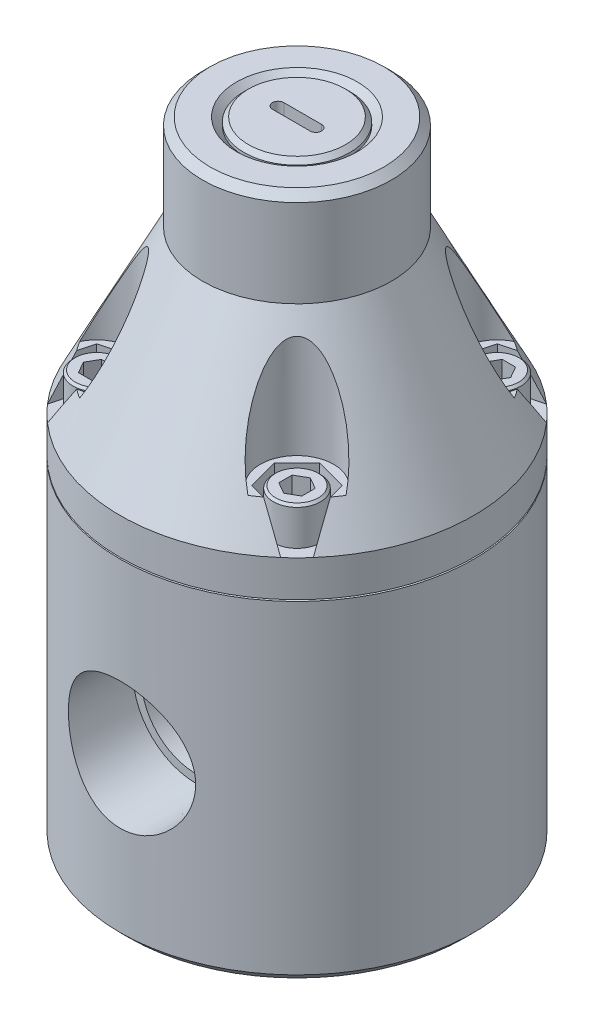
ISO-10303-21;
HEADER;
FILE_DESCRIPTION(('STEP AP214'),'2;1');
FILE_NAME('part.step','',(''),(''),'','','');
FILE_SCHEMA(('AUTOMOTIVE_DESIGN { 1 0 10303 214 1 1 1 1 }'));
ENDSEC;
DATA;
#1=APPLICATION_CONTEXT('core data for automotive mechanical design processes');
#2=APPLICATION_PROTOCOL_DEFINITION('international standard','automotive_design',2000,#1);
#3=PRODUCT_CONTEXT('',#1,'mechanical');
#4=PRODUCT('Part','Part','',(#3));
#5=PRODUCT_RELATED_PRODUCT_CATEGORY('part','',(#4));
#6=PRODUCT_DEFINITION_FORMATION('','',#4);
#7=PRODUCT_DEFINITION_CONTEXT('part definition',#1,'design');
#8=PRODUCT_DEFINITION('design','',#6,#7);
#9=PRODUCT_DEFINITION_SHAPE('','',#8);
#10=(LENGTH_UNIT() NAMED_UNIT(*) SI_UNIT(.MILLI.,.METRE.));
#11=(NAMED_UNIT(*) PLANE_ANGLE_UNIT() SI_UNIT($,.RADIAN.));
#12=(NAMED_UNIT(*) SI_UNIT($,.STERADIAN.) SOLID_ANGLE_UNIT());
#13=UNCERTAINTY_MEASURE_WITH_UNIT(LENGTH_MEASURE(1.E-05),#10,'distance_accuracy_value','');
#14=(GEOMETRIC_REPRESENTATION_CONTEXT(3) GLOBAL_UNCERTAINTY_ASSIGNED_CONTEXT((#13)) GLOBAL_UNIT_ASSIGNED_CONTEXT((#10,
#11,#12)) REPRESENTATION_CONTEXT('',''));
#15=CARTESIAN_POINT('',(0.,0.,0.));
#16=DIRECTION('',(0.,0.,1.));
#17=DIRECTION('',(1.,0.,0.));
#18=AXIS2_PLACEMENT_3D('',#15,#16,#17);
#19=CARTESIAN_POINT('',(0.,13.97,0.));
#20=DIRECTION('',(0.,1.,0.));
#21=DIRECTION('',(0.,0.,1.));
#22=AXIS2_PLACEMENT_3D('',#19,#20,#21);
#23=PLANE('',#22);
#24=CARTESIAN_POINT('',(0.,13.97,0.));
#25=DIRECTION('',(0.,1.,0.));
#26=DIRECTION('',(0.,0.,1.));
#27=AXIS2_PLACEMENT_3D('',#24,#25,#26);
#28=CIRCLE('',#27,10.4876527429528);
#29=CARTESIAN_POINT('',(0.,13.97,10.4876527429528));
#30=VERTEX_POINT('',#29);
#31=EDGE_CURVE('E1789',#30,#30,#28,.T.);
#32=ORIENTED_EDGE('',*,*,#31,.F.);
#33=EDGE_LOOP('',(#32));
#34=FACE_BOUND('',#33,.T.);
#35=CARTESIAN_POINT('',(0.,13.97,0.));
#36=DIRECTION('',(0.,1.,0.));
#37=DIRECTION('',(0.,0.,1.));
#38=AXIS2_PLACEMENT_3D('',#35,#36,#37);
#39=CIRCLE('',#38,9.1186);
#40=CARTESIAN_POINT('',(0.,13.97,9.1186));
#41=VERTEX_POINT('',#40);
#42=EDGE_CURVE('E35',#41,#41,#39,.F.);
#43=ORIENTED_EDGE('',*,*,#42,.F.);
#44=EDGE_LOOP('',(#43));
#45=FACE_BOUND('',#44,.T.);
#46=ADVANCED_FACE('F31',(#34,#45),#23,.F.);
#47=CARTESIAN_POINT('',(0.,0.,0.));
#48=DIRECTION('',(0.,1.,0.));
#49=DIRECTION('',(0.,0.,1.));
#50=AXIS2_PLACEMENT_3D('',#47,#48,#49);
#51=PLANE('',#50);
#52=CARTESIAN_POINT('',(0.,0.,0.));
#53=DIRECTION('',(0.,1.,0.));
#54=DIRECTION('',(0.,0.,1.));
#55=AXIS2_PLACEMENT_3D('',#52,#53,#54);
#56=CIRCLE('',#55,28.194);
#57=CARTESIAN_POINT('',(0.,0.,28.194));
#58=VERTEX_POINT('',#57);
#59=EDGE_CURVE('E857',#58,#58,#56,.F.);
#60=ORIENTED_EDGE('',*,*,#59,.T.);
#61=EDGE_LOOP('',(#60));
#62=FACE_BOUND('',#61,.T.);
#63=CARTESIAN_POINT('',(0.,0.,0.));
#64=DIRECTION('',(0.,1.,0.));
#65=DIRECTION('',(0.,0.,1.));
#66=AXIS2_PLACEMENT_3D('',#63,#64,#65);
#67=CIRCLE('',#66,10.7315);
#68=CARTESIAN_POINT('',(0.,0.,10.7315));
#69=VERTEX_POINT('',#68);
#70=EDGE_CURVE('E1785',#69,#69,#67,.T.);
#71=ORIENTED_EDGE('',*,*,#70,.T.);
#72=EDGE_LOOP('',(#71));
#73=FACE_BOUND('',#72,.T.);
#74=ADVANCED_FACE('F939',(#62,#73),#51,.F.);
#75=CARTESIAN_POINT('',(0.,62.23,0.));
#76=DIRECTION('',(0.,-1.,0.));
#77=DIRECTION('',(0.,0.,-1.));
#78=AXIS2_PLACEMENT_3D('',#75,#76,#77);
#79=CONICAL_SURFACE('',#78,29.718,0.471096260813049);
#80=CARTESIAN_POINT('',(-22.3373805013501,62.2298,-19.6011992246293));
#81=CARTESIAN_POINT('',(-22.2547645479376,62.7634166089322,-19.2832519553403));
#82=CARTESIAN_POINT('',(-22.1717744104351,63.29612059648,-18.9638646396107));
#83=CARTESIAN_POINT('',(-22.0049530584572,64.3594037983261,-18.3218531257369));
#84=CARTESIAN_POINT('',(-21.9211218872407,64.8899831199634,-17.9992290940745));
#85=CARTESIAN_POINT('',(-21.7525165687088,65.9487768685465,-17.3503519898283));
#86=CARTESIAN_POINT('',(-21.6677424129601,66.4769912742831,-17.0240988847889));
#87=CARTESIAN_POINT('',(-21.4971243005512,67.5307185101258,-16.367475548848));
#88=CARTESIAN_POINT('',(-21.4112802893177,68.0562312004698,-16.0371051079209));
#89=CARTESIAN_POINT('',(-21.3248419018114,68.5802,-15.7044472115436));
#90=B_SPLINE_CURVE_WITH_KNOTS('',3,(#80,#81,#82,#83,#84,#85,#86,#87,#88,#89),.UNSPECIFIED.,.F.,
.F.,(4,2,2,2,4),(0.,1.87988537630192,3.75967455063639,5.63948054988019,7.51938283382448),.UNSPECIFIED.);
#91=CARTESIAN_POINT('',(-22.3373495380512,62.23,-19.6010800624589));
#92=VERTEX_POINT('',#91);
#93=CARTESIAN_POINT('',(-21.324874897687,68.58,-15.7045741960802));
#94=VERTEX_POINT('',#93);
#95=EDGE_CURVE('E626',#92,#94,#90,.T.);
#96=ORIENTED_EDGE('',*,*,#95,.F.);
#97=CARTESIAN_POINT('',(0.,62.23,0.));
#98=DIRECTION('',(0.,-1.,0.));
#99=DIRECTION('',(0.,0.,-1.));
#100=AXIS2_PLACEMENT_3D('',#97,#98,#99);
#101=CIRCLE('',#100,29.718);
#102=CARTESIAN_POINT('',(-22.3373495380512,62.23,19.6010800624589));
#103=VERTEX_POINT('',#102);
#104=EDGE_CURVE('E1829',#103,#92,#101,.T.);
#105=ORIENTED_EDGE('',*,*,#104,.F.);
#106=CARTESIAN_POINT('',(-21.3248419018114,68.5802,15.7044472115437));
#107=CARTESIAN_POINT('',(-21.4112802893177,68.0562312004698,16.0371051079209));
#108=CARTESIAN_POINT('',(-21.4971243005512,67.5307185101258,16.367475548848));
#109=CARTESIAN_POINT('',(-21.66774241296,66.4769912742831,17.024098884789));
#110=CARTESIAN_POINT('',(-21.7525165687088,65.9487768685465,17.3503519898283));
#111=CARTESIAN_POINT('',(-21.9211218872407,64.8899831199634,17.9992290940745));
#112=CARTESIAN_POINT('',(-22.0049530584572,64.3594037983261,18.3218531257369));
#113=CARTESIAN_POINT('',(-22.1717744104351,63.29612059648,18.9638646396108));
#114=CARTESIAN_POINT('',(-22.2547645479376,62.7634166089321,19.2832519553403));
#115=CARTESIAN_POINT('',(-22.3373805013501,62.2298,19.6011992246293));
#116=B_SPLINE_CURVE_WITH_KNOTS('',3,(#106,#107,#108,#109,#110,#111,#112,#113,#114,#115),
.UNSPECIFIED.,.F.,.F.,(4,2,2,2,4),(0.,1.87990228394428,3.75970828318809,5.63949745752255,
7.51938283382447),.UNSPECIFIED.);
#117=CARTESIAN_POINT('',(-21.324874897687,68.58,15.7045741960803));
#118=VERTEX_POINT('',#117);
#119=EDGE_CURVE('E681',#118,#103,#116,.T.);
#120=ORIENTED_EDGE('',*,*,#119,.F.);
#121=CARTESIAN_POINT('',(0.,68.58,0.));
#122=DIRECTION('',(0.,1.,0.));
#123=DIRECTION('',(0.,0.,1.));
#124=AXIS2_PLACEMENT_3D('',#121,#122,#123);
#125=CIRCLE('',#124,26.4836542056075);
#126=CARTESIAN_POINT('',(-22.3908779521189,68.58,14.1432854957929));
#127=VERTEX_POINT('',#126);
#128=EDGE_CURVE('E1890',#118,#127,#125,.F.);
#129=ORIENTED_EDGE('',*,*,#128,.T.);
#130=CARTESIAN_POINT('',(-22.3909303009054,68.5798,14.143393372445));
#131=CARTESIAN_POINT('',(-22.350304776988,68.7350022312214,14.0596815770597));
#132=CARTESIAN_POINT('',(-22.3081630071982,68.89069928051,13.9776470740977));
#133=CARTESIAN_POINT('',(-22.2210302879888,69.2029732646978,13.8168553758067));
#134=CARTESIAN_POINT('',(-22.1760395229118,69.3595501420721,13.7380979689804));
#135=CARTESIAN_POINT('',(-22.0370947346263,69.8303500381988,13.5066666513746));
#136=CARTESIAN_POINT('',(-21.9391379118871,70.1457572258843,13.3587718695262));
#137=CARTESIAN_POINT('',(-21.7338262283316,70.7787217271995,13.0753567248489));
#138=CARTESIAN_POINT('',(-21.6264783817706,71.0962772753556,12.9398272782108));
#139=CARTESIAN_POINT('',(-21.4032338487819,71.7332404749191,12.6806046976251));
#140=CARTESIAN_POINT('',(-21.2873363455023,72.0526483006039,12.556912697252));
#141=CARTESIAN_POINT('',(-21.0470421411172,72.6946343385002,12.3204109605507));
#142=CARTESIAN_POINT('',(-20.9226003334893,73.0172202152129,12.2076680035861));
#143=CARTESIAN_POINT('',(-20.6663853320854,73.6632945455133,11.9936819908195));
#144=CARTESIAN_POINT('',(-20.5346119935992,73.9867830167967,11.8924391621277));
#145=CARTESIAN_POINT('',(-20.2641447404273,74.6342665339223,11.7013595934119));
#146=CARTESIAN_POINT('',(-20.1254503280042,74.9582616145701,11.6115236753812));
#147=CARTESIAN_POINT('',(-19.8414364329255,75.6062899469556,11.4433041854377));
#148=CARTESIAN_POINT('',(-19.6961171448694,75.9303231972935,11.3649202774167));
#149=CARTESIAN_POINT('',(-19.3211632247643,76.7476954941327,11.1817059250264));
#150=CARTESIAN_POINT('',(-19.0872302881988,77.2408247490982,11.0845248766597));
#151=CARTESIAN_POINT('',(-18.7249280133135,77.9784605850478,10.9599064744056));
#152=CARTESIAN_POINT('',(-18.6022415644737,78.2240315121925,10.9218885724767));
#153=CARTESIAN_POINT('',(-18.3529388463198,78.7141977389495,10.8531925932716));
#154=CARTESIAN_POINT('',(-18.2263228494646,78.9587931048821,10.8225140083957));
#155=CARTESIAN_POINT('',(-17.9690231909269,79.4465771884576,10.7688733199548));
#156=CARTESIAN_POINT('',(-17.8383410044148,79.6897663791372,10.7459084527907));
#157=CARTESIAN_POINT('',(-17.5726008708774,80.1743656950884,10.7081842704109));
#158=CARTESIAN_POINT('',(-17.4375433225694,80.4157759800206,10.693424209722));
#159=CARTESIAN_POINT('',(-17.1627429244,80.8961071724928,10.6727907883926));
#160=CARTESIAN_POINT('',(-17.0230031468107,81.1350295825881,10.6669117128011));
#161=CARTESIAN_POINT('',(-16.7382475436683,81.6097183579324,10.6649433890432));
#162=CARTESIAN_POINT('',(-16.5932325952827,81.8454852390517,10.6688525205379));
#163=CARTESIAN_POINT('',(-16.2968182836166,82.3133650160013,10.6877509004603));
#164=CARTESIAN_POINT('',(-16.1454043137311,82.5454676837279,10.7027669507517));
#165=CARTESIAN_POINT('',(-15.8354539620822,83.0038758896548,10.7457309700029));
#166=CARTESIAN_POINT('',(-15.6769137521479,83.2301782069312,10.7736859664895));
#167=CARTESIAN_POINT('',(-15.3515270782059,83.6741617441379,10.8451251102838));
#168=CARTESIAN_POINT('',(-15.1846866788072,83.8918490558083,10.8885980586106));
#169=CARTESIAN_POINT('',(-14.9269806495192,84.2084557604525,10.9683843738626));
#170=CARTESIAN_POINT('',(-14.839881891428,84.3122892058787,10.997391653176));
#171=CARTESIAN_POINT('',(-14.6629301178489,84.515808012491,11.0609509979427));
#172=CARTESIAN_POINT('',(-14.5730777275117,84.6154943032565,11.0955018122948));
#173=CARTESIAN_POINT('',(-14.3891167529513,84.8109037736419,11.1714874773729));
#174=CARTESIAN_POINT('',(-14.2949676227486,84.9065572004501,11.2130072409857));
#175=CARTESIAN_POINT('',(-14.1034347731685,85.0907355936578,11.3035808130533));
#176=CARTESIAN_POINT('',(-14.0060494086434,85.1792568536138,11.3526385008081));
#177=CARTESIAN_POINT('',(-13.7101223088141,85.429646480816,11.5123405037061));
#178=CARTESIAN_POINT('',(-13.5060546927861,85.5782916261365,11.6361944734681));
#179=CARTESIAN_POINT('',(-13.1996116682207,85.7493306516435,11.8507095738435));
#180=CARTESIAN_POINT('',(-13.0998509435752,85.7971000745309,11.9248690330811));
#181=CARTESIAN_POINT('',(-12.900706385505,85.873763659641,12.0829789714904));
#182=CARTESIAN_POINT('',(-12.8013223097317,85.9026733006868,12.1669213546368));
#183=CARTESIAN_POINT('',(-12.6053038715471,85.9385908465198,12.3437610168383));
#184=CARTESIAN_POINT('',(-12.5086917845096,85.9454540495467,12.4367133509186));
#185=CARTESIAN_POINT('',(-12.3223166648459,85.9359739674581,12.6281475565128));
#186=CARTESIAN_POINT('',(-12.2325552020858,85.9196253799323,12.7266306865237));
#187=CARTESIAN_POINT('',(-12.0684910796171,85.8677160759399,12.9184346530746));
#188=CARTESIAN_POINT('',(-11.9935403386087,85.8336265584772,13.0116153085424));
#189=CARTESIAN_POINT('',(-11.8522698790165,85.7502029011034,13.1975950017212));
#190=CARTESIAN_POINT('',(-11.7859543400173,85.7008614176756,13.290393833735));
#191=CARTESIAN_POINT('',(-11.6163662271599,85.5496530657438,13.5413620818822));
#192=CARTESIAN_POINT('',(-11.5214197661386,85.4357254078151,13.6978402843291));
#193=CARTESIAN_POINT('',(-11.3524385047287,85.1845941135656,14.0032728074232));
#194=CARTESIAN_POINT('',(-11.2784789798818,85.0473094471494,14.1521985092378));
#195=CARTESIAN_POINT('',(-11.1484302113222,84.7600134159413,14.44015441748));
#196=CARTESIAN_POINT('',(-11.0920802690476,84.6102339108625,14.5793027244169));
#197=CARTESIAN_POINT('',(-10.9925096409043,84.3006741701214,14.851149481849));
#198=CARTESIAN_POINT('',(-10.9493023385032,84.1408839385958,14.9838412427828));
#199=CARTESIAN_POINT('',(-10.8736636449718,83.8139640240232,15.2438249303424));
#200=CARTESIAN_POINT('',(-10.8412572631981,83.6468183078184,15.3711037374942));
#201=CARTESIAN_POINT('',(-10.7856662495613,83.307480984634,15.6206584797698));
#202=CARTESIAN_POINT('',(-10.7624784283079,83.1352911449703,15.7429361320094));
#203=CARTESIAN_POINT('',(-10.7205377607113,82.7552655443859,16.0051192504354));
#204=CARTESIAN_POINT('',(-10.7033691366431,82.5466647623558,16.1441638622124));
#205=CARTESIAN_POINT('',(-10.6786273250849,82.125493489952,16.4170496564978));
#206=CARTESIAN_POINT('',(-10.6710565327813,81.9129220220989,16.5508895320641));
#207=CARTESIAN_POINT('',(-10.664422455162,81.4846459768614,16.8140587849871));
#208=CARTESIAN_POINT('',(-10.6653663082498,81.2689389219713,16.9433842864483));
#209=CARTESIAN_POINT('',(-10.674967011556,80.8352423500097,17.1978874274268));
#210=CARTESIAN_POINT('',(-10.6836247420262,80.6172525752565,17.323064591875));
#211=CARTESIAN_POINT('',(-10.7080782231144,80.178919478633,17.5699535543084));
#212=CARTESIAN_POINT('',(-10.7238938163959,79.9585712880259,17.691654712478));
#213=CARTESIAN_POINT('',(-10.7622068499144,79.516512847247,17.9314908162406));
#214=CARTESIAN_POINT('',(-10.7847047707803,79.2948025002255,18.0496255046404));
#215=CARTESIAN_POINT('',(-10.8616544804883,78.628245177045,18.3989144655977));
#216=CARTESIAN_POINT('',(-10.9255713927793,78.1818168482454,18.6250403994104));
#217=CARTESIAN_POINT('',(-11.0664102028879,77.3479438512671,19.0346218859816));
#218=CARTESIAN_POINT('',(-11.1403619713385,76.9607742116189,19.2196861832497));
#219=CARTESIAN_POINT('',(-11.3050181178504,76.1856258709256,19.5805572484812));
#220=CARTESIAN_POINT('',(-11.3957241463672,75.7976470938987,19.7563631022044));
#221=CARTESIAN_POINT('',(-11.5935742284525,75.0216151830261,20.0985507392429));
#222=CARTESIAN_POINT('',(-11.7007221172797,74.6335620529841,20.264930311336));
#223=CARTESIAN_POINT('',(-11.9313879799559,73.8581881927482,20.5877481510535));
#224=CARTESIAN_POINT('',(-12.0549056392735,73.470867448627,20.7441866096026));
#225=CARTESIAN_POINT('',(-12.3163714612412,72.7038997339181,21.0439307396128));
#226=CARTESIAN_POINT('',(-12.4540552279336,72.3242296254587,21.1874073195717));
#227=CARTESIAN_POINT('',(-12.7458005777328,71.5671030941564,21.4629534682));
#228=CARTESIAN_POINT('',(-12.8998598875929,71.1896463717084,21.5950246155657));
#229=CARTESIAN_POINT('',(-13.2250025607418,70.4376533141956,21.8464430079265));
#230=CARTESIAN_POINT('',(-13.396090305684,70.0631177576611,21.9657869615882));
#231=CARTESIAN_POINT('',(-13.6660711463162,69.5043911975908,22.1338540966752));
#232=CARTESIAN_POINT('',(-13.7583155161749,69.3186135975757,22.1880644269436));
#233=CARTESIAN_POINT('',(-13.9473861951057,68.9482602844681,22.2925349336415));
#234=CARTESIAN_POINT('',(-14.044212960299,68.7636846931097,22.3427947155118));
#235=CARTESIAN_POINT('',(-14.1433933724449,68.5798000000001,22.3909303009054));
#236=B_SPLINE_CURVE_WITH_KNOTS('',3,(#130,#131,#132,#133,#134,#135,#136,#137,#138,#139,#140,
#141,#142,#143,#144,#145,#146,#147,#148,#149,#150,#151,#152,#153,#154,#155,#156,#157,#158,#159,
#160,#161,#162,#163,#164,#165,#166,#167,#168,#169,#170,#171,#172,#173,#174,#175,#176,#177,#178,
#179,#180,#181,#182,#183,#184,#185,#186,#187,#188,#189,#190,#191,#192,#193,#194,#195,#196,#197,
#198,#199,#200,#201,#202,#203,#204,#205,#206,#207,#208,#209,#210,#211,#212,#213,#214,#215,#216,
#217,#218,#219,#220,#221,#222,#223,#224,#225,#226,#227,#228,#229,#230,#231,#232,#233,#234,#235),
.UNSPECIFIED.,.F.,.F.,(4,2,2,2,2,2,2,2,2,2,2,2,2,2,2,2,2,2,2,2,2,2,2,2,2,2,2,2,2,2,2,2,2,2,2,2,
2,2,2,2,2,2,2,2,2,2,2,2,2,2,2,2,4),(0.,0.542840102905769,1.08564511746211,2.17085376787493,
3.25525867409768,4.33976732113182,5.43052218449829,6.5212985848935,7.61215354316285,
8.70297647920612,10.3650975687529,11.196398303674,12.027641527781,12.8585866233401,
13.6894562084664,14.5197908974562,15.3499881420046,16.1821952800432,17.014854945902,
17.8469149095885,18.2625409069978,18.6780732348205,19.0990950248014,19.5203342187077,
20.354755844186,20.7529146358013,21.1507462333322,21.5511837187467,21.9517126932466,
22.32334462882,22.6951557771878,23.3381727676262,23.9834677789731,24.6186994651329,
25.2545758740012,25.8919145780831,26.5290325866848,27.2825500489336,28.0362555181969,
28.7905929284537,29.5450164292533,30.3015442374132,31.0581264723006,32.5707579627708,
33.8767149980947,35.1828007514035,36.4891916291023,37.7955574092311,39.0808873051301,
40.3660390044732,41.6515222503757,42.2946005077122,42.9377429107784),.UNSPECIFIED.);
#237=CARTESIAN_POINT('',(-14.1432854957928,68.58,22.390877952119));
#238=VERTEX_POINT('',#237);
#239=EDGE_CURVE('E1881',#127,#238,#236,.T.);
#240=ORIENTED_EDGE('',*,*,#239,.T.);
#241=CARTESIAN_POINT('',(-15.7045741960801,68.58,21.3248748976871));
#242=VERTEX_POINT('',#241);
#243=EDGE_CURVE('E1888',#238,#242,#125,.F.);
#244=ORIENTED_EDGE('',*,*,#243,.T.);
#245=CARTESIAN_POINT('',(-19.6011992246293,62.2298,22.3373805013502));
#246=CARTESIAN_POINT('',(-19.2832519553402,62.7634166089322,22.2547645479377));
#247=CARTESIAN_POINT('',(-18.9638646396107,63.29612059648,22.1717744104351));
#248=CARTESIAN_POINT('',(-18.3218531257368,64.3594037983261,22.0049530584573));
#249=CARTESIAN_POINT('',(-17.9992290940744,64.8899831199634,21.9211218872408));
#250=CARTESIAN_POINT('',(-17.3503519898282,65.9487768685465,21.7525165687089));
#251=CARTESIAN_POINT('',(-17.0240988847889,66.4769912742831,21.6677424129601));
#252=CARTESIAN_POINT('',(-16.3674755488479,67.5307185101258,21.4971243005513));
#253=CARTESIAN_POINT('',(-16.0371051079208,68.0562312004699,21.4112802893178));
#254=CARTESIAN_POINT('',(-15.7044472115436,68.5802,21.3248419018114));
#255=B_SPLINE_CURVE_WITH_KNOTS('',3,(#245,#246,#247,#248,#249,#250,#251,#252,#253,#254),
.UNSPECIFIED.,.F.,.F.,(4,2,2,2,4),(0.,1.87988537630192,3.75967455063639,5.63948054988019,
7.51938283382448),.UNSPECIFIED.);
#256=CARTESIAN_POINT('',(-19.6010800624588,62.23,22.3373495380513));
#257=VERTEX_POINT('',#256);
#258=EDGE_CURVE('E674',#257,#242,#255,.T.);
#259=ORIENTED_EDGE('',*,*,#258,.F.);
#260=CARTESIAN_POINT('',(19.601080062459,62.23,22.3373495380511));
#261=VERTEX_POINT('',#260);
#262=EDGE_CURVE('E1836',#261,#257,#101,.T.);
#263=ORIENTED_EDGE('',*,*,#262,.F.);
#264=CARTESIAN_POINT('',(15.7044472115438,68.5802,21.3248419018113));
#265=CARTESIAN_POINT('',(16.037105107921,68.0562312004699,21.4112802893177));
#266=CARTESIAN_POINT('',(16.3674755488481,67.5307185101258,21.4971243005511));
#267=CARTESIAN_POINT('',(17.024098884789,66.4769912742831,21.66774241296));
#268=CARTESIAN_POINT('',(17.3503519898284,65.9487768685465,21.7525165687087));
#269=CARTESIAN_POINT('',(17.9992290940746,64.8899831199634,21.9211218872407));
#270=CARTESIAN_POINT('',(18.321853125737,64.3594037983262,22.0049530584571));
#271=CARTESIAN_POINT('',(18.9638646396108,63.29612059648,22.171774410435));
#272=CARTESIAN_POINT('',(19.2832519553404,62.7634166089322,22.2547645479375));
#273=CARTESIAN_POINT('',(19.6011992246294,62.2298,22.33738050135));
#274=B_SPLINE_CURVE_WITH_KNOTS('',3,(#264,#265,#266,#267,#268,#269,#270,#271,#272,#273),
.UNSPECIFIED.,.F.,.F.,(4,2,2,2,4),(0.,1.87990228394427,3.75970828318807,5.63949745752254,
7.51938283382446),.UNSPECIFIED.);
#275=CARTESIAN_POINT('',(15.7045741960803,68.58,21.3248748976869));
#276=VERTEX_POINT('',#275);
#277=EDGE_CURVE('E712',#276,#261,#274,.T.);
#278=ORIENTED_EDGE('',*,*,#277,.F.);
#279=CARTESIAN_POINT('',(0.,68.58,0.));
#280=DIRECTION('',(0.,1.,0.));
#281=DIRECTION('',(0.,0.,1.));
#282=AXIS2_PLACEMENT_3D('',#279,#280,#281);
#283=CIRCLE('',#282,26.4836542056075);
#284=CARTESIAN_POINT('',(14.143285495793,68.58,22.3908779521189));
#285=VERTEX_POINT('',#284);
#286=EDGE_CURVE('E877',#276,#285,#283,.F.);
#287=ORIENTED_EDGE('',*,*,#286,.T.);
#288=CARTESIAN_POINT('',(14.1433933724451,68.5798,22.3909303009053));
#289=CARTESIAN_POINT('',(14.0596815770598,68.7350022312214,22.3503047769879));
#290=CARTESIAN_POINT('',(13.9776470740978,68.89069928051,22.3081630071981));
#291=CARTESIAN_POINT('',(13.8168553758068,69.2029732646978,22.2210302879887));
#292=CARTESIAN_POINT('',(13.7380979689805,69.3595501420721,22.1760395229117));
#293=CARTESIAN_POINT('',(13.5066666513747,69.8303500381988,22.0370947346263));
#294=CARTESIAN_POINT('',(13.3587718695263,70.1457572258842,21.939137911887));
#295=CARTESIAN_POINT('',(13.075356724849,70.7787217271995,21.7338262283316));
#296=CARTESIAN_POINT('',(12.9398272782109,71.0962772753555,21.6264783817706));
#297=CARTESIAN_POINT('',(12.6806046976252,71.7332404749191,21.4032338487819));
#298=CARTESIAN_POINT('',(12.5569126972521,72.0526483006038,21.2873363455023));
#299=CARTESIAN_POINT('',(12.3204109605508,72.6946343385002,21.0470421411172));
#300=CARTESIAN_POINT('',(12.2076680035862,73.0172202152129,20.9226003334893));
#301=CARTESIAN_POINT('',(11.9936819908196,73.6632945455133,20.6663853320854));
#302=CARTESIAN_POINT('',(11.8924391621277,73.9867830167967,20.5346119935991));
#303=CARTESIAN_POINT('',(11.7013595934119,74.6342665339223,20.2641447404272));
#304=CARTESIAN_POINT('',(11.6115236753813,74.9582616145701,20.1254503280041));
#305=CARTESIAN_POINT('',(11.4433041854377,75.6062899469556,19.8414364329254));
#306=CARTESIAN_POINT('',(11.3649202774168,75.9303231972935,19.6961171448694));
#307=CARTESIAN_POINT('',(11.1817059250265,76.7476954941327,19.3211632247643));
#308=CARTESIAN_POINT('',(11.0845248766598,77.2408247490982,19.0872302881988));
#309=CARTESIAN_POINT('',(10.9599064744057,77.9784605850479,18.7249280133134));
#310=CARTESIAN_POINT('',(10.9218885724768,78.2240315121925,18.6022415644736));
#311=CARTESIAN_POINT('',(10.8531925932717,78.7141977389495,18.3529388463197));
#312=CARTESIAN_POINT('',(10.8225140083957,78.9587931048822,18.2263228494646));
#313=CARTESIAN_POINT('',(10.7688733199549,79.4465771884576,17.9690231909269));
#314=CARTESIAN_POINT('',(10.7459084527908,79.6897663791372,17.8383410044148));
#315=CARTESIAN_POINT('',(10.7081842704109,80.1743656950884,17.5726008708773));
#316=CARTESIAN_POINT('',(10.6934242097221,80.4157759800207,17.4375433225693));
#317=CARTESIAN_POINT('',(10.6727907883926,80.8961071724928,17.1627429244));
#318=CARTESIAN_POINT('',(10.6669117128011,81.1350295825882,17.0230031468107));
#319=CARTESIAN_POINT('',(10.6649433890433,81.6097183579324,16.7382475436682));
#320=CARTESIAN_POINT('',(10.668852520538,81.8454852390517,16.5932325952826));
#321=CARTESIAN_POINT('',(10.6877509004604,82.3133650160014,16.2968182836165));
#322=CARTESIAN_POINT('',(10.7027669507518,82.545467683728,16.1454043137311));
#323=CARTESIAN_POINT('',(10.745730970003,83.0038758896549,15.8354539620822));
#324=CARTESIAN_POINT('',(10.7736859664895,83.2301782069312,15.6769137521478));
#325=CARTESIAN_POINT('',(10.8451251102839,83.6741617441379,15.3515270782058));
#326=CARTESIAN_POINT('',(10.8885980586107,83.8918490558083,15.1846866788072));
#327=CARTESIAN_POINT('',(10.9683843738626,84.2084557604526,14.9269806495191));
#328=CARTESIAN_POINT('',(10.997391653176,84.3122892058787,14.8398818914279));
#329=CARTESIAN_POINT('',(11.0609509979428,84.515808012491,14.6629301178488));
#330=CARTESIAN_POINT('',(11.0955018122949,84.6154943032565,14.5730777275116));
#331=CARTESIAN_POINT('',(11.171487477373,84.8109037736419,14.3891167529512));
#332=CARTESIAN_POINT('',(11.2130072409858,84.9065572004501,14.2949676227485));
#333=CARTESIAN_POINT('',(11.3035808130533,85.0907355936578,14.1034347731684));
#334=CARTESIAN_POINT('',(11.3526385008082,85.1792568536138,14.0060494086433));
#335=CARTESIAN_POINT('',(11.5123405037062,85.4296464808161,13.710122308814));
#336=CARTESIAN_POINT('',(11.6361944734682,85.5782916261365,13.506054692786));
#337=CARTESIAN_POINT('',(11.8507095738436,85.7493306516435,13.1996116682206));
#338=CARTESIAN_POINT('',(11.9248690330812,85.797100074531,13.0998509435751));
#339=CARTESIAN_POINT('',(12.0829789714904,85.873763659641,12.9007063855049));
#340=CARTESIAN_POINT('',(12.1669213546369,85.9026733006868,12.8013223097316));
#341=CARTESIAN_POINT('',(12.3437610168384,85.9385908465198,12.605303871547));
#342=CARTESIAN_POINT('',(12.4367133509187,85.9454540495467,12.5086917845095));
#343=CARTESIAN_POINT('',(12.6281475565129,85.9359739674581,12.3223166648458));
#344=CARTESIAN_POINT('',(12.7266306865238,85.9196253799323,12.2325552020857));
#345=CARTESIAN_POINT('',(12.9184346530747,85.8677160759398,12.068491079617));
#346=CARTESIAN_POINT('',(13.0116153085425,85.8336265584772,11.9935403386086));
#347=CARTESIAN_POINT('',(13.1975950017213,85.7502029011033,11.8522698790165));
#348=CARTESIAN_POINT('',(13.2903938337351,85.7008614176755,11.7859543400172));
#349=CARTESIAN_POINT('',(13.5413620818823,85.5496530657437,11.6163662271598));
#350=CARTESIAN_POINT('',(13.6978402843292,85.435725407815,11.5214197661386));
#351=CARTESIAN_POINT('',(14.0032728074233,85.1845941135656,11.3524385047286));
#352=CARTESIAN_POINT('',(14.1521985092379,85.0473094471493,11.2784789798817));
#353=CARTESIAN_POINT('',(14.4401544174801,84.7600134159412,11.1484302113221));
#354=CARTESIAN_POINT('',(14.579302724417,84.6102339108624,11.0920802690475));
#355=CARTESIAN_POINT('',(14.8511494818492,84.3006741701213,10.9925096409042));
#356=CARTESIAN_POINT('',(14.983841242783,84.1408839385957,10.9493023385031));
#357=CARTESIAN_POINT('',(15.2438249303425,83.813964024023,10.8736636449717));
#358=CARTESIAN_POINT('',(15.3711037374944,83.6468183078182,10.841257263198));
#359=CARTESIAN_POINT('',(15.62065847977,83.3074809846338,10.7856662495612));
#360=CARTESIAN_POINT('',(15.7429361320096,83.1352911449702,10.7624784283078));
#361=CARTESIAN_POINT('',(16.0051192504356,82.7552655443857,10.7205377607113));
#362=CARTESIAN_POINT('',(16.1441638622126,82.5466647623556,10.703369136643));
#363=CARTESIAN_POINT('',(16.417049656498,82.1254934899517,10.6786273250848));
#364=CARTESIAN_POINT('',(16.5508895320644,81.9129220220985,10.6710565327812));
#365=CARTESIAN_POINT('',(16.8140587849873,81.4846459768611,10.6644224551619));
#366=CARTESIAN_POINT('',(16.9433842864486,81.2689389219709,10.6653663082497));
#367=CARTESIAN_POINT('',(17.1978874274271,80.8352423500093,10.674967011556));
#368=CARTESIAN_POINT('',(17.3230645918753,80.6172525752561,10.6836247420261));
#369=CARTESIAN_POINT('',(17.5699535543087,80.1789194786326,10.7080782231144));
#370=CARTESIAN_POINT('',(17.6916547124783,79.9585712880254,10.7238938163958));
#371=CARTESIAN_POINT('',(17.9314908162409,79.5165128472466,10.7622068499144));
#372=CARTESIAN_POINT('',(18.0496255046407,79.294802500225,10.7847047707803));
#373=CARTESIAN_POINT('',(18.398914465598,78.6282451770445,10.8616544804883));
#374=CARTESIAN_POINT('',(18.6250403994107,78.1818168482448,10.9255713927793));
#375=CARTESIAN_POINT('',(19.0346218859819,77.3479438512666,11.0664102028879));
#376=CARTESIAN_POINT('',(19.21968618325,76.9607742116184,11.1403619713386));
#377=CARTESIAN_POINT('',(19.5805572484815,76.1856258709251,11.3050181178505));
#378=CARTESIAN_POINT('',(19.7563631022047,75.7976470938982,11.3957241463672));
#379=CARTESIAN_POINT('',(20.0985507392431,75.0216151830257,11.5935742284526));
#380=CARTESIAN_POINT('',(20.2649303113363,74.6335620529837,11.7007221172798));
#381=CARTESIAN_POINT('',(20.5877481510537,73.8581881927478,11.9313879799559));
#382=CARTESIAN_POINT('',(20.7441866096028,73.4708674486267,12.0549056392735));
#383=CARTESIAN_POINT('',(21.0439307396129,72.7038997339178,12.3163714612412));
#384=CARTESIAN_POINT('',(21.1874073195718,72.3242296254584,12.4540552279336));
#385=CARTESIAN_POINT('',(21.4629534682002,71.5671030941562,12.7458005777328));
#386=CARTESIAN_POINT('',(21.5950246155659,71.1896463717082,12.8998598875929));
#387=CARTESIAN_POINT('',(21.8464430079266,70.4376533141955,13.2250025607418));
#388=CARTESIAN_POINT('',(21.9657869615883,70.0631177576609,13.396090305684));
#389=CARTESIAN_POINT('',(22.1338540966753,69.5043911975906,13.6660711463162));
#390=CARTESIAN_POINT('',(22.1880644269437,69.3186135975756,13.7583155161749));
#391=CARTESIAN_POINT('',(22.2925349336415,68.948260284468,13.9473861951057));
#392=CARTESIAN_POINT('',(22.3427947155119,68.7636846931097,14.0442129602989));
#393=CARTESIAN_POINT('',(22.3909303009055,68.5798,14.1433933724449));
#394=B_SPLINE_CURVE_WITH_KNOTS('',3,(#288,#289,#290,#291,#292,#293,#294,#295,#296,#297,#298,
#299,#300,#301,#302,#303,#304,#305,#306,#307,#308,#309,#310,#311,#312,#313,#314,#315,#316,#317,
#318,#319,#320,#321,#322,#323,#324,#325,#326,#327,#328,#329,#330,#331,#332,#333,#334,#335,#336,
#337,#338,#339,#340,#341,#342,#343,#344,#345,#346,#347,#348,#349,#350,#351,#352,#353,#354,#355,
#356,#357,#358,#359,#360,#361,#362,#363,#364,#365,#366,#367,#368,#369,#370,#371,#372,#373,#374,
#375,#376,#377,#378,#379,#380,#381,#382,#383,#384,#385,#386,#387,#388,#389,#390,#391,#392,#393),
.UNSPECIFIED.,.F.,.F.,(4,2,2,2,2,2,2,2,2,2,2,2,2,2,2,2,2,2,2,2,2,2,2,2,2,2,2,2,2,2,2,2,2,2,2,2,
2,2,2,2,2,2,2,2,2,2,2,2,2,2,2,2,4),(0.,0.542840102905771,1.08564511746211,2.17085376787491,
3.25525867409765,4.3397673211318,5.43052218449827,6.52129858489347,7.61215354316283,
8.7029764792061,10.3650975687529,11.196398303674,12.0276415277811,12.8585866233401,
13.6894562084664,14.5197908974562,15.3499881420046,16.1821952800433,17.0148549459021,
17.8469149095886,18.2625409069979,18.6780732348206,19.0990950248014,19.5203342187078,
20.3547558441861,20.7529146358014,21.1507462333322,21.5511837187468,21.9517126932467,
22.3233446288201,22.6951557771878,23.3381727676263,23.9834677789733,24.618699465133,
25.2545758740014,25.8919145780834,26.529032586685,27.2825500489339,28.0362555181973,
28.7905929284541,29.5450164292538,30.3015442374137,31.0581264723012,32.5707579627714,
33.8767149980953,35.182800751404,36.4891916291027,37.7955574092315,39.0808873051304,
40.3660390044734,41.6515222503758,42.2946005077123,42.9377429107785),.UNSPECIFIED.);
#395=CARTESIAN_POINT('',(22.390877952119,68.58,14.1432854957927));
#396=VERTEX_POINT('',#395);
#397=EDGE_CURVE('E1891',#285,#396,#394,.T.);
#398=ORIENTED_EDGE('',*,*,#397,.T.);
#399=CARTESIAN_POINT('',(21.3248748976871,68.58,15.7045741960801));
#400=VERTEX_POINT('',#399);
#401=EDGE_CURVE('E878',#396,#400,#283,.F.);
#402=ORIENTED_EDGE('',*,*,#401,.T.);
#403=CARTESIAN_POINT('',(22.3373805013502,62.2298,19.6011992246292));
#404=CARTESIAN_POINT('',(22.2547645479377,62.7634166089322,19.2832519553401));
#405=CARTESIAN_POINT('',(22.1717744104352,63.29612059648,18.9638646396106));
#406=CARTESIAN_POINT('',(22.0049530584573,64.3594037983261,18.3218531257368));
#407=CARTESIAN_POINT('',(21.9211218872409,64.8899831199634,17.9992290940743));
#408=CARTESIAN_POINT('',(21.752516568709,65.9487768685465,17.3503519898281));
#409=CARTESIAN_POINT('',(21.6677424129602,66.4769912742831,17.0240988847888));
#410=CARTESIAN_POINT('',(21.4971243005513,67.5307185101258,16.3674755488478));
#411=CARTESIAN_POINT('',(21.4112802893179,68.0562312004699,16.0371051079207));
#412=CARTESIAN_POINT('',(21.3248419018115,68.5802,15.7044472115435));
#413=B_SPLINE_CURVE_WITH_KNOTS('',3,(#403,#404,#405,#406,#407,#408,#409,#410,#411,#412),
.UNSPECIFIED.,.F.,.F.,(4,2,2,2,4),(0.,1.87988537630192,3.75967455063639,5.63948054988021,
7.51938283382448),.UNSPECIFIED.);
#414=CARTESIAN_POINT('',(22.3373495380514,62.23,19.6010800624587));
#415=VERTEX_POINT('',#414);
#416=EDGE_CURVE('E725',#415,#400,#413,.T.);
#417=ORIENTED_EDGE('',*,*,#416,.F.);
#418=CARTESIAN_POINT('',(22.3373495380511,62.23,-19.6010800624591));
#419=VERTEX_POINT('',#418);
#420=EDGE_CURVE('E836',#419,#415,#101,.T.);
#421=ORIENTED_EDGE('',*,*,#420,.F.);
#422=CARTESIAN_POINT('',(21.3248419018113,68.5802,-15.7044472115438));
#423=CARTESIAN_POINT('',(21.4112802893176,68.0562312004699,-16.037105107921));
#424=CARTESIAN_POINT('',(21.4971243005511,67.5307185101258,-16.3674755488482));
#425=CARTESIAN_POINT('',(21.6677424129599,66.4769912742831,-17.0240988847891));
#426=CARTESIAN_POINT('',(21.7525165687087,65.9487768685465,-17.3503519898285));
#427=CARTESIAN_POINT('',(21.9211218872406,64.8899831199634,-17.9992290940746));
#428=CARTESIAN_POINT('',(22.004953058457,64.3594037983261,-18.3218531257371));
#429=CARTESIAN_POINT('',(22.1717744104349,63.29612059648,-18.9638646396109));
#430=CARTESIAN_POINT('',(22.2547645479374,62.7634166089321,-19.2832519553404));
#431=CARTESIAN_POINT('',(22.3373805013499,62.2298,-19.6011992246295));
#432=B_SPLINE_CURVE_WITH_KNOTS('',3,(#422,#423,#424,#425,#426,#427,#428,#429,#430,#431),
.UNSPECIFIED.,.F.,.F.,(4,2,2,2,4),(0.,1.87990228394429,3.75970828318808,5.63949745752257,
7.51938283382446),.UNSPECIFIED.);
#433=CARTESIAN_POINT('',(21.3248748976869,68.58,-15.7045741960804));
#434=VERTEX_POINT('',#433);
#435=EDGE_CURVE('E774',#434,#419,#432,.T.);
#436=ORIENTED_EDGE('',*,*,#435,.F.);
#437=CARTESIAN_POINT('',(0.,68.58,0.));
#438=DIRECTION('',(0.,1.,0.));
#439=DIRECTION('',(0.,0.,1.));
#440=AXIS2_PLACEMENT_3D('',#437,#438,#439);
#441=CIRCLE('',#440,26.4836542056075);
#442=CARTESIAN_POINT('',(22.3908779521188,68.58,-14.1432854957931));
#443=VERTEX_POINT('',#442);
#444=EDGE_CURVE('E866',#434,#443,#441,.F.);
#445=ORIENTED_EDGE('',*,*,#444,.T.);
#446=CARTESIAN_POINT('',(22.3909303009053,68.5798000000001,-14.1433933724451));
#447=CARTESIAN_POINT('',(22.3503047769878,68.7350022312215,-14.0596815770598));
#448=CARTESIAN_POINT('',(22.3081630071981,68.8906992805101,-13.9776470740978));
#449=CARTESIAN_POINT('',(22.2210302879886,69.2029732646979,-13.8168553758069));
#450=CARTESIAN_POINT('',(22.1760395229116,69.3595501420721,-13.7380979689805));
#451=CARTESIAN_POINT('',(22.0370947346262,69.8303500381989,-13.5066666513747));
#452=CARTESIAN_POINT('',(21.939137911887,70.1457572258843,-13.3587718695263));
#453=CARTESIAN_POINT('',(21.7338262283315,70.7787217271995,-13.075356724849));
#454=CARTESIAN_POINT('',(21.6264783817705,71.0962772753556,-12.9398272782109));
#455=CARTESIAN_POINT('',(21.4032338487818,71.7332404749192,-12.6806046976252));
#456=CARTESIAN_POINT('',(21.2873363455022,72.0526483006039,-12.5569126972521));
#457=CARTESIAN_POINT('',(21.0470421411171,72.6946343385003,-12.3204109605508));
#458=CARTESIAN_POINT('',(20.9226003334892,73.017220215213,-12.2076680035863));
#459=CARTESIAN_POINT('',(20.6663853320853,73.6632945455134,-11.9936819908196));
#460=CARTESIAN_POINT('',(20.5346119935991,73.9867830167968,-11.8924391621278));
#461=CARTESIAN_POINT('',(20.2641447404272,74.6342665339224,-11.701359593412));
#462=CARTESIAN_POINT('',(20.1254503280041,74.9582616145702,-11.6115236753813));
#463=CARTESIAN_POINT('',(19.8414364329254,75.6062899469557,-11.4433041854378));
#464=CARTESIAN_POINT('',(19.6961171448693,75.9303231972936,-11.3649202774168));
#465=CARTESIAN_POINT('',(19.3211632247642,76.7476954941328,-11.1817059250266));
#466=CARTESIAN_POINT('',(19.0872302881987,77.2408247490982,-11.0845248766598));
#467=CARTESIAN_POINT('',(18.7249280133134,77.9784605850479,-10.9599064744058));
#468=CARTESIAN_POINT('',(18.6022415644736,78.2240315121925,-10.9218885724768));
#469=CARTESIAN_POINT('',(18.3529388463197,78.7141977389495,-10.8531925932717));
#470=CARTESIAN_POINT('',(18.2263228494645,78.9587931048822,-10.8225140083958));
#471=CARTESIAN_POINT('',(17.9690231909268,79.4465771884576,-10.7688733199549));
#472=CARTESIAN_POINT('',(17.8383410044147,79.6897663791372,-10.7459084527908));
#473=CARTESIAN_POINT('',(17.5726008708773,80.1743656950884,-10.708184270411));
#474=CARTESIAN_POINT('',(17.4375433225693,80.4157759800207,-10.6934242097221));
#475=CARTESIAN_POINT('',(17.1627429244,80.8961071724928,-10.6727907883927));
#476=CARTESIAN_POINT('',(17.0230031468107,81.1350295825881,-10.6669117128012));
#477=CARTESIAN_POINT('',(16.7382475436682,81.6097183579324,-10.6649433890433));
#478=CARTESIAN_POINT('',(16.5932325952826,81.8454852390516,-10.668852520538));
#479=CARTESIAN_POINT('',(16.2968182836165,82.3133650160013,-10.6877509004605));
#480=CARTESIAN_POINT('',(16.1454043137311,82.5454676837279,-10.7027669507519));
#481=CARTESIAN_POINT('',(15.8354539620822,83.0038758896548,-10.745730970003));
#482=CARTESIAN_POINT('',(15.6769137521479,83.2301782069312,-10.7736859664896));
#483=CARTESIAN_POINT('',(15.3515270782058,83.6741617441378,-10.8451251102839));
#484=CARTESIAN_POINT('',(15.1846866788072,83.8918490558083,-10.8885980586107));
#485=CARTESIAN_POINT('',(14.9269806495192,84.2084557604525,-10.9683843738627));
#486=CARTESIAN_POINT('',(14.8398818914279,84.3122892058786,-10.9973916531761));
#487=CARTESIAN_POINT('',(14.6629301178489,84.5158080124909,-11.0609509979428));
#488=CARTESIAN_POINT('',(14.5730777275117,84.6154943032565,-11.0955018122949));
#489=CARTESIAN_POINT('',(14.3891167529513,84.8109037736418,-11.171487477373));
#490=CARTESIAN_POINT('',(14.2949676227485,84.90655720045,-11.2130072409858));
#491=CARTESIAN_POINT('',(14.1034347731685,85.0907355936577,-11.3035808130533));
#492=CARTESIAN_POINT('',(14.0060494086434,85.1792568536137,-11.3526385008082));
#493=CARTESIAN_POINT('',(13.7101223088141,85.429646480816,-11.5123405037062));
#494=CARTESIAN_POINT('',(13.5060546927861,85.5782916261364,-11.6361944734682));
#495=CARTESIAN_POINT('',(13.1996116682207,85.7493306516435,-11.8507095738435));
#496=CARTESIAN_POINT('',(13.0998509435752,85.7971000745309,-11.9248690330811));
#497=CARTESIAN_POINT('',(12.9007063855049,85.873763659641,-12.0829789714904));
#498=CARTESIAN_POINT('',(12.8013223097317,85.9026733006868,-12.1669213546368));
#499=CARTESIAN_POINT('',(12.6053038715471,85.9385908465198,-12.3437610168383));
#500=CARTESIAN_POINT('',(12.5086917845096,85.9454540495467,-12.4367133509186));
#501=CARTESIAN_POINT('',(12.3223166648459,85.9359739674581,-12.6281475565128));
#502=CARTESIAN_POINT('',(12.2325552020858,85.9196253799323,-12.7266306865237));
#503=CARTESIAN_POINT('',(12.0684910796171,85.8677160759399,-12.9184346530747));
#504=CARTESIAN_POINT('',(11.9935403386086,85.8336265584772,-13.0116153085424));
#505=CARTESIAN_POINT('',(11.8522698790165,85.7502029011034,-13.1975950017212));
#506=CARTESIAN_POINT('',(11.7859543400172,85.7008614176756,-13.290393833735));
#507=CARTESIAN_POINT('',(11.6163662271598,85.5496530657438,-13.5413620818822));
#508=CARTESIAN_POINT('',(11.5214197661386,85.4357254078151,-13.6978402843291));
#509=CARTESIAN_POINT('',(11.3524385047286,85.1845941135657,-14.0032728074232));
#510=CARTESIAN_POINT('',(11.2784789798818,85.0473094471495,-14.1521985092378));
#511=CARTESIAN_POINT('',(11.1484302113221,84.7600134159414,-14.4401544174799));
#512=CARTESIAN_POINT('',(11.0920802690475,84.6102339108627,-14.5793027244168));
#513=CARTESIAN_POINT('',(10.9925096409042,84.3006741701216,-14.851149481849));
#514=CARTESIAN_POINT('',(10.9493023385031,84.140883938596,-14.9838412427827));
#515=CARTESIAN_POINT('',(10.8736636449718,83.8139640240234,-15.2438249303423));
#516=CARTESIAN_POINT('',(10.841257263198,83.6468183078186,-15.3711037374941));
#517=CARTESIAN_POINT('',(10.7856662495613,83.3074809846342,-15.6206584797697));
#518=CARTESIAN_POINT('',(10.7624784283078,83.1352911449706,-15.7429361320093));
#519=CARTESIAN_POINT('',(10.7205377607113,82.7552655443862,-16.0051192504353));
#520=CARTESIAN_POINT('',(10.703369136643,82.5466647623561,-16.1441638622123));
#521=CARTESIAN_POINT('',(10.6786273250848,82.1254934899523,-16.4170496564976));
#522=CARTESIAN_POINT('',(10.6710565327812,81.9129220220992,-16.550889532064));
#523=CARTESIAN_POINT('',(10.6644224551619,81.4846459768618,-16.814058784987));
#524=CARTESIAN_POINT('',(10.6653663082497,81.2689389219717,-16.9433842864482));
#525=CARTESIAN_POINT('',(10.6749670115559,80.8352423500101,-17.1978874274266));
#526=CARTESIAN_POINT('',(10.683624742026,80.6172525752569,-17.3230645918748));
#527=CARTESIAN_POINT('',(10.7080782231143,80.1789194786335,-17.5699535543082));
#528=CARTESIAN_POINT('',(10.7238938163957,79.9585712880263,-17.6916547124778));
#529=CARTESIAN_POINT('',(10.7622068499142,79.5165128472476,-17.9314908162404));
#530=CARTESIAN_POINT('',(10.7847047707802,79.2948025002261,-18.0496255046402));
#531=CARTESIAN_POINT('',(10.8616544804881,78.6282451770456,-18.3989144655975));
#532=CARTESIAN_POINT('',(10.9255713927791,78.181816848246,-18.6250403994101));
#533=CARTESIAN_POINT('',(11.0664102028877,77.3479438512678,-19.0346218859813));
#534=CARTESIAN_POINT('',(11.1403619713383,76.9607742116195,-19.2196861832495));
#535=CARTESIAN_POINT('',(11.3050181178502,76.1856258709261,-19.580557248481));
#536=CARTESIAN_POINT('',(11.3957241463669,75.7976470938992,-19.7563631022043));
#537=CARTESIAN_POINT('',(11.5935742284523,75.0216151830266,-20.0985507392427));
#538=CARTESIAN_POINT('',(11.7007221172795,74.6335620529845,-20.264930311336));
#539=CARTESIAN_POINT('',(11.9313879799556,73.8581881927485,-20.5877481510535));
#540=CARTESIAN_POINT('',(12.0549056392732,73.4708674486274,-20.7441866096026));
#541=CARTESIAN_POINT('',(12.3163714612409,72.7038997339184,-21.0439307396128));
#542=CARTESIAN_POINT('',(12.4540552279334,72.3242296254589,-21.1874073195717));
#543=CARTESIAN_POINT('',(12.7458005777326,71.5671030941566,-21.4629534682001));
#544=CARTESIAN_POINT('',(12.8998598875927,71.1896463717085,-21.5950246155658));
#545=CARTESIAN_POINT('',(13.2250025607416,70.4376533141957,-21.8464430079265));
#546=CARTESIAN_POINT('',(13.3960903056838,70.0631177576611,-21.9657869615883));
#547=CARTESIAN_POINT('',(13.666071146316,69.5043911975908,-22.1338540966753));
#548=CARTESIAN_POINT('',(13.7583155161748,69.3186135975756,-22.1880644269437));
#549=CARTESIAN_POINT('',(13.9473861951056,68.948260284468,-22.2925349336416));
#550=CARTESIAN_POINT('',(14.0442129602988,68.7636846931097,-22.3427947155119));
#551=CARTESIAN_POINT('',(14.1433933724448,68.5798,-22.3909303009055));
#552=B_SPLINE_CURVE_WITH_KNOTS('',3,(#446,#447,#448,#449,#450,#451,#452,#453,#454,#455,#456,
#457,#458,#459,#460,#461,#462,#463,#464,#465,#466,#467,#468,#469,#470,#471,#472,#473,#474,#475,
#476,#477,#478,#479,#480,#481,#482,#483,#484,#485,#486,#487,#488,#489,#490,#491,#492,#493,#494,
#495,#496,#497,#498,#499,#500,#501,#502,#503,#504,#505,#506,#507,#508,#509,#510,#511,#512,#513,
#514,#515,#516,#517,#518,#519,#520,#521,#522,#523,#524,#525,#526,#527,#528,#529,#530,#531,#532,
#533,#534,#535,#536,#537,#538,#539,#540,#541,#542,#543,#544,#545,#546,#547,#548,#549,#550,#551),
.UNSPECIFIED.,.F.,.F.,(4,2,2,2,2,2,2,2,2,2,2,2,2,2,2,2,2,2,2,2,2,2,2,2,2,2,2,2,2,2,2,2,2,2,2,2,
2,2,2,2,2,2,2,2,2,2,2,2,2,2,2,2,4),(0.,0.542840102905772,1.08564511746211,2.17085376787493,
3.25525867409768,4.33976732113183,5.4305221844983,6.5212985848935,7.61215354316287,
8.70297647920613,10.3650975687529,11.196398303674,12.027641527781,12.85858662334,
13.6894562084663,14.5197908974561,15.3499881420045,16.1821952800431,17.0148549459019,
17.8469149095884,18.2625409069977,18.6780732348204,19.0990950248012,19.5203342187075,
20.3547558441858,20.7529146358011,21.150746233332,21.5511837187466,21.9517126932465,
22.3233446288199,22.6951557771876,23.338172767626,23.9834677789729,24.6186994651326,
25.2545758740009,25.8919145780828,26.5290325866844,27.2825500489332,28.0362555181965,
28.7905929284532,29.5450164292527,30.3015442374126,31.0581264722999,32.5707579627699,
33.876714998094,35.1828007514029,36.4891916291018,37.7955574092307,39.0808873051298,
40.366039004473,41.6515222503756,42.2946005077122,42.9377429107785),.UNSPECIFIED.);
#553=CARTESIAN_POINT('',(14.1432854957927,68.58,-22.3908779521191));
#554=VERTEX_POINT('',#553);
#555=EDGE_CURVE('E870',#443,#554,#552,.T.);
#556=ORIENTED_EDGE('',*,*,#555,.T.);
#557=CARTESIAN_POINT('',(15.70457419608,68.58,-21.3248748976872));
#558=VERTEX_POINT('',#557);
#559=EDGE_CURVE('E867',#554,#558,#441,.F.);
#560=ORIENTED_EDGE('',*,*,#559,.T.);
#561=CARTESIAN_POINT('',(19.6011992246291,62.2298,-22.3373805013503));
#562=CARTESIAN_POINT('',(19.28325195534,62.7634166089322,-22.2547645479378));
#563=CARTESIAN_POINT('',(18.9638646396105,63.29612059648,-22.1717744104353));
#564=CARTESIAN_POINT('',(18.3218531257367,64.3594037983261,-22.0049530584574));
#565=CARTESIAN_POINT('',(17.9992290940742,64.8899831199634,-21.9211218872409));
#566=CARTESIAN_POINT('',(17.350351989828,65.9487768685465,-21.752516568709));
#567=CARTESIAN_POINT('',(17.0240988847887,66.4769912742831,-21.6677424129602));
#568=CARTESIAN_POINT('',(16.3674755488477,67.5307185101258,-21.4971243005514));
#569=CARTESIAN_POINT('',(16.0371051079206,68.0562312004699,-21.4112802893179));
#570=CARTESIAN_POINT('',(15.7044472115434,68.5802,-21.3248419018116));
#571=B_SPLINE_CURVE_WITH_KNOTS('',3,(#561,#562,#563,#564,#565,#566,#567,#568,#569,#570),
.UNSPECIFIED.,.F.,.F.,(4,2,2,2,4),(0.,1.87988537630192,3.75967455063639,5.63948054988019,
7.51938283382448),.UNSPECIFIED.);
#572=CARTESIAN_POINT('',(19.6010800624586,62.23,-22.3373495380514));
#573=VERTEX_POINT('',#572);
#574=EDGE_CURVE('E767',#573,#558,#571,.T.);
#575=ORIENTED_EDGE('',*,*,#574,.F.);
#576=CARTESIAN_POINT('',(-19.6010800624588,62.23,-22.3373495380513));
#577=VERTEX_POINT('',#576);
#578=EDGE_CURVE('E831',#577,#573,#101,.T.);
#579=ORIENTED_EDGE('',*,*,#578,.F.);
#580=CARTESIAN_POINT('',(-15.7044472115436,68.5802,-21.3248419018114));
#581=CARTESIAN_POINT('',(-16.0371051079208,68.0562312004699,-21.4112802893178));
#582=CARTESIAN_POINT('',(-16.3674755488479,67.5307185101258,-21.4971243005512));
#583=CARTESIAN_POINT('',(-17.0240988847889,66.4769912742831,-21.6677424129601));
#584=CARTESIAN_POINT('',(-17.3503519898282,65.9487768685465,-21.7525165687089));
#585=CARTESIAN_POINT('',(-17.9992290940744,64.8899831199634,-21.9211218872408));
#586=CARTESIAN_POINT('',(-18.3218531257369,64.3594037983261,-22.0049530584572));
#587=CARTESIAN_POINT('',(-18.9638646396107,63.29612059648,-22.1717744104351));
#588=CARTESIAN_POINT('',(-19.2832519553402,62.7634166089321,-22.2547645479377));
#589=CARTESIAN_POINT('',(-19.6011992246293,62.2298,-22.3373805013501));
#590=B_SPLINE_CURVE_WITH_KNOTS('',3,(#580,#581,#582,#583,#584,#585,#586,#587,#588,#589),
.UNSPECIFIED.,.F.,.F.,(4,2,2,2,4),(0.,1.87990228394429,3.75970828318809,5.63949745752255,
7.51938283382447),.UNSPECIFIED.);
#591=CARTESIAN_POINT('',(-15.7045741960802,68.58,-21.3248748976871));
#592=VERTEX_POINT('',#591);
#593=EDGE_CURVE('E612',#592,#577,#590,.T.);
#594=ORIENTED_EDGE('',*,*,#593,.F.);
#595=CARTESIAN_POINT('',(0.,68.58,0.));
#596=DIRECTION('',(0.,1.,0.));
#597=DIRECTION('',(0.,0.,1.));
#598=AXIS2_PLACEMENT_3D('',#595,#596,#597);
#599=CIRCLE('',#598,26.4836542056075);
#600=CARTESIAN_POINT('',(-14.1432854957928,68.58,-22.390877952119));
#601=VERTEX_POINT('',#600);
#602=EDGE_CURVE('E1887',#592,#601,#599,.F.);
#603=ORIENTED_EDGE('',*,*,#602,.T.);
#604=CARTESIAN_POINT('',(-14.1433933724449,68.5798000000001,-22.3909303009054));
#605=CARTESIAN_POINT('',(-14.0596815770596,68.7350022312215,-22.350304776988));
#606=CARTESIAN_POINT('',(-13.9776470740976,68.8906992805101,-22.3081630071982));
#607=CARTESIAN_POINT('',(-13.8168553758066,69.2029732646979,-22.2210302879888));
#608=CARTESIAN_POINT('',(-13.7380979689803,69.3595501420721,-22.1760395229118));
#609=CARTESIAN_POINT('',(-13.5066666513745,69.8303500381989,-22.0370947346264));
#610=CARTESIAN_POINT('',(-13.3587718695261,70.1457572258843,-21.9391379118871));
#611=CARTESIAN_POINT('',(-13.0753567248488,70.7787217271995,-21.7338262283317));
#612=CARTESIAN_POINT('',(-12.9398272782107,71.0962772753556,-21.6264783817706));
#613=CARTESIAN_POINT('',(-12.680604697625,71.7332404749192,-21.4032338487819));
#614=CARTESIAN_POINT('',(-12.5569126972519,72.0526483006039,-21.2873363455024));
#615=CARTESIAN_POINT('',(-12.3204109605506,72.6946343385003,-21.0470421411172));
#616=CARTESIAN_POINT('',(-12.207668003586,73.017220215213,-20.9226003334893));
#617=CARTESIAN_POINT('',(-11.9936819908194,73.6632945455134,-20.6663853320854));
#618=CARTESIAN_POINT('',(-11.8924391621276,73.9867830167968,-20.5346119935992));
#619=CARTESIAN_POINT('',(-11.7013595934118,74.6342665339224,-20.2641447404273));
#620=CARTESIAN_POINT('',(-11.6115236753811,74.9582616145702,-20.1254503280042));
#621=CARTESIAN_POINT('',(-11.4433041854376,75.6062899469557,-19.8414364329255));
#622=CARTESIAN_POINT('',(-11.3649202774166,75.9303231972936,-19.6961171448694));
#623=CARTESIAN_POINT('',(-11.1817059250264,76.7476954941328,-19.3211632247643));
#624=CARTESIAN_POINT('',(-11.0845248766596,77.2408247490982,-19.0872302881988));
#625=CARTESIAN_POINT('',(-10.9599064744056,77.9784605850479,-18.7249280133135));
#626=CARTESIAN_POINT('',(-10.9218885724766,78.2240315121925,-18.6022415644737));
#627=CARTESIAN_POINT('',(-10.8531925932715,78.7141977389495,-18.3529388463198));
#628=CARTESIAN_POINT('',(-10.8225140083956,78.9587931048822,-18.2263228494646));
#629=CARTESIAN_POINT('',(-10.7688733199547,79.4465771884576,-17.9690231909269));
#630=CARTESIAN_POINT('',(-10.7459084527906,79.6897663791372,-17.8383410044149));
#631=CARTESIAN_POINT('',(-10.7081842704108,80.1743656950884,-17.5726008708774));
#632=CARTESIAN_POINT('',(-10.693424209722,80.4157759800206,-17.4375433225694));
#633=CARTESIAN_POINT('',(-10.6727907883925,80.8961071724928,-17.1627429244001));
#634=CARTESIAN_POINT('',(-10.666911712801,81.1350295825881,-17.0230031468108));
#635=CARTESIAN_POINT('',(-10.6649433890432,81.6097183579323,-16.7382475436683));
#636=CARTESIAN_POINT('',(-10.6688525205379,81.8454852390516,-16.5932325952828));
#637=CARTESIAN_POINT('',(-10.6877509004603,82.3133650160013,-16.2968182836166));
#638=CARTESIAN_POINT('',(-10.7027669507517,82.5454676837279,-16.1454043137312));
#639=CARTESIAN_POINT('',(-10.7457309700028,83.0038758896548,-15.8354539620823));
#640=CARTESIAN_POINT('',(-10.7736859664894,83.2301782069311,-15.676913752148));
#641=CARTESIAN_POINT('',(-10.8451251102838,83.6741617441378,-15.351527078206));
#642=CARTESIAN_POINT('',(-10.8885980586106,83.8918490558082,-15.1846866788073));
#643=CARTESIAN_POINT('',(-10.9683843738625,84.2084557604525,-14.9269806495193));
#644=CARTESIAN_POINT('',(-10.9973916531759,84.3122892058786,-14.8398818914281));
#645=CARTESIAN_POINT('',(-11.0609509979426,84.5158080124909,-14.662930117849));
#646=CARTESIAN_POINT('',(-11.0955018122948,84.6154943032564,-14.5730777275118));
#647=CARTESIAN_POINT('',(-11.1714874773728,84.8109037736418,-14.3891167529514));
#648=CARTESIAN_POINT('',(-11.2130072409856,84.90655720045,-14.2949676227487));
#649=CARTESIAN_POINT('',(-11.3035808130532,85.0907355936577,-14.1034347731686));
#650=CARTESIAN_POINT('',(-11.352638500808,85.1792568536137,-14.0060494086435));
#651=CARTESIAN_POINT('',(-11.512340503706,85.429646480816,-13.7101223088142));
#652=CARTESIAN_POINT('',(-11.636194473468,85.5782916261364,-13.5060546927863));
#653=CARTESIAN_POINT('',(-11.8507095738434,85.7493306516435,-13.1996116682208));
#654=CARTESIAN_POINT('',(-11.924869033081,85.7971000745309,-13.0998509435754));
#655=CARTESIAN_POINT('',(-12.0829789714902,85.873763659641,-12.9007063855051));
#656=CARTESIAN_POINT('',(-12.1669213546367,85.9026733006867,-12.8013223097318));
#657=CARTESIAN_POINT('',(-12.3437610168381,85.9385908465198,-12.6053038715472));
#658=CARTESIAN_POINT('',(-12.4367133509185,85.9454540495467,-12.5086917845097));
#659=CARTESIAN_POINT('',(-12.6281475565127,85.9359739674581,-12.322316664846));
#660=CARTESIAN_POINT('',(-12.7266306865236,85.9196253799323,-12.2325552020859));
#661=CARTESIAN_POINT('',(-12.9184346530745,85.8677160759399,-12.0684910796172));
#662=CARTESIAN_POINT('',(-13.0116153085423,85.8336265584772,-11.9935403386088));
#663=CARTESIAN_POINT('',(-13.1975950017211,85.7502029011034,-11.8522698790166));
#664=CARTESIAN_POINT('',(-13.2903938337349,85.7008614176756,-11.7859543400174));
#665=CARTESIAN_POINT('',(-13.5413620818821,85.5496530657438,-11.61636622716));
#666=CARTESIAN_POINT('',(-13.697840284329,85.4357254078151,-11.5214197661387));
#667=CARTESIAN_POINT('',(-14.0032728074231,85.1845941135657,-11.3524385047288));
#668=CARTESIAN_POINT('',(-14.1521985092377,85.0473094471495,-11.2784789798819));
#669=CARTESIAN_POINT('',(-14.4401544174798,84.7600134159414,-11.1484302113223));
#670=CARTESIAN_POINT('',(-14.5793027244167,84.6102339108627,-11.0920802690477));
#671=CARTESIAN_POINT('',(-14.8511494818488,84.3006741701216,-10.9925096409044));
#672=CARTESIAN_POINT('',(-14.9838412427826,84.140883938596,-10.9493023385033));
#673=CARTESIAN_POINT('',(-15.2438249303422,83.8139640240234,-10.8736636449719));
#674=CARTESIAN_POINT('',(-15.371103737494,83.6468183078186,-10.8412572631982));
#675=CARTESIAN_POINT('',(-15.6206584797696,83.3074809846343,-10.7856662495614));
#676=CARTESIAN_POINT('',(-15.7429361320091,83.1352911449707,-10.762478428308));
#677=CARTESIAN_POINT('',(-16.0051192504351,82.7552655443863,-10.7205377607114));
#678=CARTESIAN_POINT('',(-16.1441638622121,82.5466647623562,-10.7033691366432));
#679=CARTESIAN_POINT('',(-16.4170496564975,82.1254934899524,-10.678627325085));
#680=CARTESIAN_POINT('',(-16.5508895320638,81.9129220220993,-10.6710565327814));
#681=CARTESIAN_POINT('',(-16.8140587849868,81.4846459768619,-10.664422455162));
#682=CARTESIAN_POINT('',(-16.943384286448,81.2689389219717,-10.6653663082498));
#683=CARTESIAN_POINT('',(-17.1978874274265,80.8352423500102,-10.674967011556));
#684=CARTESIAN_POINT('',(-17.3230645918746,80.6172525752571,-10.6836247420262));
#685=CARTESIAN_POINT('',(-17.5699535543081,80.1789194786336,-10.7080782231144));
#686=CARTESIAN_POINT('',(-17.6916547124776,79.9585712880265,-10.7238938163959));
#687=CARTESIAN_POINT('',(-17.9314908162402,79.5165128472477,-10.7622068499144));
#688=CARTESIAN_POINT('',(-18.04962550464,79.2948025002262,-10.7847047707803));
#689=CARTESIAN_POINT('',(-18.3989144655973,78.6282451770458,-10.8616544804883));
#690=CARTESIAN_POINT('',(-18.62504039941,78.1818168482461,-10.9255713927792));
#691=CARTESIAN_POINT('',(-19.0346218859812,77.3479438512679,-11.0664102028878));
#692=CARTESIAN_POINT('',(-19.2196861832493,76.9607742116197,-11.1403619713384));
#693=CARTESIAN_POINT('',(-19.5805572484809,76.1856258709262,-11.3050181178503));
#694=CARTESIAN_POINT('',(-19.7563631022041,75.7976470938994,-11.3957241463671));
#695=CARTESIAN_POINT('',(-20.0985507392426,75.0216151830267,-11.5935742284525));
#696=CARTESIAN_POINT('',(-20.2649303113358,74.6335620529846,-11.7007221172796));
#697=CARTESIAN_POINT('',(-20.5877481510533,73.8581881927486,-11.9313879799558));
#698=CARTESIAN_POINT('',(-20.7441866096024,73.4708674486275,-12.0549056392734));
#699=CARTESIAN_POINT('',(-21.0439307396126,72.7038997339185,-12.3163714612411));
#700=CARTESIAN_POINT('',(-21.1874073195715,72.324229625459,-12.4540552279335));
#701=CARTESIAN_POINT('',(-21.4629534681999,71.5671030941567,-12.7458005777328));
#702=CARTESIAN_POINT('',(-21.5950246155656,71.1896463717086,-12.8998598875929));
#703=CARTESIAN_POINT('',(-21.8464430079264,70.4376533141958,-13.2250025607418));
#704=CARTESIAN_POINT('',(-21.9657869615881,70.0631177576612,-13.396090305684));
#705=CARTESIAN_POINT('',(-22.1338540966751,69.5043911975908,-13.6660711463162));
#706=CARTESIAN_POINT('',(-22.1880644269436,69.3186135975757,-13.7583155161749));
#707=CARTESIAN_POINT('',(-22.2925349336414,68.9482602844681,-13.9473861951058));
#708=CARTESIAN_POINT('',(-22.3427947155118,68.7636846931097,-14.044212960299));
#709=CARTESIAN_POINT('',(-22.3909303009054,68.5798000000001,-14.143393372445));
#710=B_SPLINE_CURVE_WITH_KNOTS('',3,(#604,#605,#606,#607,#608,#609,#610,#611,#612,#613,#614,
#615,#616,#617,#618,#619,#620,#621,#622,#623,#624,#625,#626,#627,#628,#629,#630,#631,#632,#633,
#634,#635,#636,#637,#638,#639,#640,#641,#642,#643,#644,#645,#646,#647,#648,#649,#650,#651,#652,
#653,#654,#655,#656,#657,#658,#659,#660,#661,#662,#663,#664,#665,#666,#667,#668,#669,#670,#671,
#672,#673,#674,#675,#676,#677,#678,#679,#680,#681,#682,#683,#684,#685,#686,#687,#688,#689,#690,
#691,#692,#693,#694,#695,#696,#697,#698,#699,#700,#701,#702,#703,#704,#705,#706,#707,#708,#709),
.UNSPECIFIED.,.F.,.F.,(4,2,2,2,2,2,2,2,2,2,2,2,2,2,2,2,2,2,2,2,2,2,2,2,2,2,2,2,2,2,2,2,2,2,2,2,
2,2,2,2,2,2,2,2,2,2,2,2,2,2,2,2,4),(0.,0.542840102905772,1.08564511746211,2.17085376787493,
3.25525867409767,4.33976732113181,5.43052218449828,6.52129858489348,7.61215354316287,
8.70297647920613,10.3650975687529,11.196398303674,12.027641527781,12.85858662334,
13.6894562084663,14.5197908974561,15.3499881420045,16.1821952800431,17.0148549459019,
17.8469149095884,18.2625409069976,18.6780732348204,19.0990950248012,19.5203342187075,
20.3547558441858,20.7529146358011,21.150746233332,21.5511837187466,21.9517126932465,
22.3233446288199,22.6951557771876,23.338172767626,23.9834677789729,24.6186994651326,
25.2545758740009,25.8919145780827,26.5290325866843,27.2825500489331,28.0362555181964,
28.7905929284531,29.5450164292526,30.3015442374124,31.0581264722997,32.5707579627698,
33.8767149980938,35.1828007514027,36.4891916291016,37.7955574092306,39.0808873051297,
40.3660390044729,41.6515222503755,42.294600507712,42.9377429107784),.UNSPECIFIED.);
#711=CARTESIAN_POINT('',(-22.3908779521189,68.58,-14.1432854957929));
#712=VERTEX_POINT('',#711);
#713=EDGE_CURVE('E1867',#601,#712,#710,.T.);
#714=ORIENTED_EDGE('',*,*,#713,.T.);
#715=EDGE_CURVE('E1832',#712,#94,#599,.F.);
#716=ORIENTED_EDGE('',*,*,#715,.T.);
#717=EDGE_LOOP('',(#96,#105,#120,#129,#240,#244,#259,#263,#278,#287,#398,#402,#417,#421,#436,
#445,#556,#560,#575,#579,#594,#603,#714,#716));
#718=FACE_BOUND('',#717,.T.);
#719=CARTESIAN_POINT('',(0.,89.408,0.));
#720=DIRECTION('',(0.,-1.,0.));
#721=DIRECTION('',(0.,0.,-1.));
#722=AXIS2_PLACEMENT_3D('',#719,#720,#721);
#723=CIRCLE('',#722,15.875);
#724=CARTESIAN_POINT('',(0.,89.408,-15.875));
#725=VERTEX_POINT('',#724);
#726=EDGE_CURVE('E828',#725,#725,#723,.T.);
#727=ORIENTED_EDGE('',*,*,#726,.T.);
#728=EDGE_LOOP('',(#727));
#729=FACE_BOUND('',#728,.T.);
#730=ADVANCED_FACE('F632',(#718,#729),#79,.T.);
#731=CARTESIAN_POINT('',(0.,105.41,0.));
#732=DIRECTION('',(0.,-1.,0.));
#733=DIRECTION('',(0.,0.,-1.));
#734=AXIS2_PLACEMENT_3D('',#731,#732,#733);
#735=CYLINDRICAL_SURFACE('',#734,29.718);
#736=CARTESIAN_POINT('',(-7.88572135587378,20.1806746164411,-28.6526599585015));
#737=CARTESIAN_POINT('',(-7.68382389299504,19.9596806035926,-28.7082256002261));
#738=CARTESIAN_POINT('',(-7.47269853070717,19.7471847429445,-28.7640339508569));
#739=CARTESIAN_POINT('',(-7.03324933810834,19.3404998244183,-28.8746299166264));
#740=CARTESIAN_POINT('',(-6.80492583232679,19.1463104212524,-28.9294175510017));
#741=CARTESIAN_POINT('',(-6.33242905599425,18.777517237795,-29.0365034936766));
#742=CARTESIAN_POINT('',(-6.08825616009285,18.6029129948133,-29.0888018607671));
#743=CARTESIAN_POINT('',(-5.58561094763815,18.2745876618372,-29.1894867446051));
#744=CARTESIAN_POINT('',(-5.32714395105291,18.1208588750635,-29.2378747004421));
#745=CARTESIAN_POINT('',(-4.79677760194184,17.8350471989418,-29.3295591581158));
#746=CARTESIAN_POINT('',(-4.52484631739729,17.7030193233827,-29.3728426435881));
#747=CARTESIAN_POINT('',(-3.96995216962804,17.4622070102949,-29.4529722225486));
#748=CARTESIAN_POINT('',(-3.68698927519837,17.3534226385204,-29.4898182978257));
#749=CARTESIAN_POINT('',(-3.11210523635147,17.160137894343,-29.5560148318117));
#750=CARTESIAN_POINT('',(-2.82018635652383,17.0756314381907,-29.5853671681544));
#751=CARTESIAN_POINT('',(-2.22952055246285,16.9317191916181,-29.6357317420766));
#752=CARTESIAN_POINT('',(-1.9307739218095,16.8723123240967,-29.656744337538));
#753=CARTESIAN_POINT('',(-1.3412017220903,16.7811437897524,-29.6891268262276));
#754=CARTESIAN_POINT('',(-1.05055601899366,16.7483451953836,-29.7008579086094));
#755=CARTESIAN_POINT('',(-0.467335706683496,16.7067349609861,-29.7157567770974));
#756=CARTESIAN_POINT('',(-0.174761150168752,16.6979226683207,-29.7189247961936));
#757=CARTESIAN_POINT('',(0.41004235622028,16.704375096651,-29.7166095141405));
#758=CARTESIAN_POINT('',(0.702271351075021,16.7196362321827,-29.7111275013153));
#759=CARTESIAN_POINT('',(1.28420371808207,16.7740711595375,-29.6916671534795));
#760=CARTESIAN_POINT('',(1.57390712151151,16.8132446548,-29.6776889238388));
#761=CARTESIAN_POINT('',(2.13919140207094,16.9134334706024,-29.6422156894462));
#762=CARTESIAN_POINT('',(2.41492376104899,16.9736899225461,-29.6209823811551));
#763=CARTESIAN_POINT('',(2.96015073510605,17.1156505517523,-29.5714721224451));
#764=CARTESIAN_POINT('',(3.22964552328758,17.1973541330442,-29.5431953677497));
#765=CARTESIAN_POINT('',(3.76065640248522,17.3815029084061,-29.480306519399));
#766=CARTESIAN_POINT('',(4.02217317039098,17.4839463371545,-29.4456949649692));
#767=CARTESIAN_POINT('',(4.53576856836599,17.7088039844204,-29.3709670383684));
#768=CARTESIAN_POINT('',(4.78784357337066,17.8312257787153,-29.3308485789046));
#769=CARTESIAN_POINT('',(5.28869907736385,18.0992250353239,-29.2447559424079));
#770=CARTESIAN_POINT('',(5.53713260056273,18.2454048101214,-29.1986383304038));
#771=CARTESIAN_POINT('',(6.02097921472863,18.557015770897,-29.1027179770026));
#772=CARTESIAN_POINT('',(6.2563877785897,18.7224535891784,-29.0529139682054));
#773=CARTESIAN_POINT('',(6.71282674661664,19.0714751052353,-28.9508580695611));
#774=CARTESIAN_POINT('',(6.93385521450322,19.2550612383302,-28.8986058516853));
#775=CARTESIAN_POINT('',(7.36030670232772,19.6392438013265,-28.7929449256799));
#776=CARTESIAN_POINT('',(7.5657291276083,19.8398408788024,-28.7395361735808));
#777=CARTESIAN_POINT('',(7.97067536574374,20.268358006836,-28.6299536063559));
#778=CARTESIAN_POINT('',(8.16925514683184,20.497173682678,-28.5737890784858));
#779=CARTESIAN_POINT('',(8.54647314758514,20.9709666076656,-28.4632385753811));
#780=CARTESIAN_POINT('',(8.72511781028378,21.215938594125,-28.4088520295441));
#781=CARTESIAN_POINT('',(9.06141502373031,21.7207387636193,-28.3033807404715));
#782=CARTESIAN_POINT('',(9.21905802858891,21.9805736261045,-28.2522975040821));
#783=CARTESIAN_POINT('',(9.51203054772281,22.5132692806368,-28.1550106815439));
#784=CARTESIAN_POINT('',(9.64736940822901,22.7861245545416,-28.1088050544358));
#785=CARTESIAN_POINT('',(9.89492922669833,23.3436771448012,-28.0226180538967));
#786=CARTESIAN_POINT('',(10.0071089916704,23.628394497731,-27.9826478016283));
#787=CARTESIAN_POINT('',(10.2070340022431,24.2072397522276,-27.9103438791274));
#788=CARTESIAN_POINT('',(10.2947790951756,24.5013677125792,-27.8780102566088));
#789=CARTESIAN_POINT('',(10.4449278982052,25.0967074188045,-27.8221032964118));
#790=CARTESIAN_POINT('',(10.5073428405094,25.3979159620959,-27.7985260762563));
#791=CARTESIAN_POINT('',(10.6062143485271,26.0051497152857,-27.7609537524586));
#792=CARTESIAN_POINT('',(10.6426724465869,26.3111746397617,-27.7469580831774));
#793=CARTESIAN_POINT('',(10.6878833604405,26.9077987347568,-27.7295728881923));
#794=CARTESIAN_POINT('',(10.6981116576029,27.1982705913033,-27.7256186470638));
#795=CARTESIAN_POINT('',(10.6950544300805,27.779065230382,-27.7267982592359));
#796=CARTESIAN_POINT('',(10.6817698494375,28.0693880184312,-27.7319317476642));
#797=CARTESIAN_POINT('',(10.6318258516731,28.6476949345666,-27.7511173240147));
#798=CARTESIAN_POINT('',(10.595167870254,28.9356792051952,-27.7651688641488));
#799=CARTESIAN_POINT('',(10.4988445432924,29.5072240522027,-27.8017343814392));
#800=CARTESIAN_POINT('',(10.4391791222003,29.7907846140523,-27.8242483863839));
#801=CARTESIAN_POINT('',(10.2990146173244,30.3451405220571,-27.8764286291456));
#802=CARTESIAN_POINT('',(10.2190176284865,30.6160795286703,-27.9059214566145));
#803=CARTESIAN_POINT('',(10.0382325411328,31.1502140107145,-27.9714613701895));
#804=CARTESIAN_POINT('',(9.93743710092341,31.4134067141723,-28.007510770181));
#805=CARTESIAN_POINT('',(9.71585659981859,31.9303771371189,-28.0851459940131));
#806=CARTESIAN_POINT('',(9.59507188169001,32.1841550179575,-28.1267317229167));
#807=CARTESIAN_POINT('',(9.33435871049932,32.6808938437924,-28.2143257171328));
#808=CARTESIAN_POINT('',(9.19442885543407,32.923853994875,-28.2603343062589));
#809=CARTESIAN_POINT('',(8.8889503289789,33.4093711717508,-28.3579450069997));
#810=CARTESIAN_POINT('',(8.7224766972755,33.6513135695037,-28.4097112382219));
#811=CARTESIAN_POINT('',(8.37051989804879,34.1204516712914,-28.5153936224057));
#812=CARTESIAN_POINT('',(8.18503622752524,34.3476469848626,-28.5693098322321));
#813=CARTESIAN_POINT('',(7.79612188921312,34.7860548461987,-28.6778794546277));
#814=CARTESIAN_POINT('',(7.59268593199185,34.9972626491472,-28.7325330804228));
#815=CARTESIAN_POINT('',(7.16909169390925,35.4023722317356,-28.8411416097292));
#816=CARTESIAN_POINT('',(6.94893363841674,35.5962742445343,-28.8950965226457));
#817=CARTESIAN_POINT('',(6.48318117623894,35.9736350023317,-29.003232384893));
#818=CARTESIAN_POINT('',(6.23689612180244,36.156269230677,-29.057320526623));
#819=CARTESIAN_POINT('',(5.72908976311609,36.4999802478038,-29.1616907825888));
#820=CARTESIAN_POINT('',(5.46757429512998,36.6610652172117,-29.2119743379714));
#821=CARTESIAN_POINT('',(4.93089207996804,36.9604844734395,-29.307338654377));
#822=CARTESIAN_POINT('',(4.65572459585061,37.0988175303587,-29.3524191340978));
#823=CARTESIAN_POINT('',(4.09363790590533,37.3515039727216,-29.4360725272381));
#824=CARTESIAN_POINT('',(3.80671919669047,37.4658583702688,-29.4746457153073));
#825=CARTESIAN_POINT('',(3.2313188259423,37.6666687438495,-29.5431836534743));
#826=CARTESIAN_POINT('',(2.94310173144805,37.7538111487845,-29.5733576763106));
#827=CARTESIAN_POINT('',(2.3596343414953,37.9035479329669,-29.6256210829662));
#828=CARTESIAN_POINT('',(2.06438414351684,37.9661426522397,-29.647710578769));
#829=CARTESIAN_POINT('',(1.46922431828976,38.0661168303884,-29.6831558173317));
#830=CARTESIAN_POINT('',(1.16931627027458,38.103504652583,-29.6965144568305));
#831=CARTESIAN_POINT('',(0.567147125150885,38.1526914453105,-29.7141141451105));
#832=CARTESIAN_POINT('',(0.264886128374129,38.1644915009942,-29.718355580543));
#833=CARTESIAN_POINT('',(-0.323072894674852,38.1624354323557,-29.7176181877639));
#834=CARTESIAN_POINT('',(-0.608777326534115,38.1499402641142,-29.7131284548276));
#835=CARTESIAN_POINT('',(-1.17800870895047,38.1020852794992,-29.696007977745));
#836=CARTESIAN_POINT('',(-1.46153574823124,38.0667263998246,-29.6833775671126));
#837=CARTESIAN_POINT('',(-2.02438626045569,37.9734880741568,-29.6503096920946));
#838=CARTESIAN_POINT('',(-2.3037098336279,37.9156091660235,-29.6298724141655));
#839=CARTESIAN_POINT('',(-2.85623975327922,37.7778690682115,-29.5817228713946));
#840=CARTESIAN_POINT('',(-3.12944600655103,37.6980075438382,-29.5540104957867));
#841=CARTESIAN_POINT('',(-3.6671425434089,37.5172743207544,-29.4921111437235));
#842=CARTESIAN_POINT('',(-3.93165623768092,37.4164655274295,-29.4579435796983));
#843=CARTESIAN_POINT('',(-4.45127239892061,37.1944787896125,-29.383917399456));
#844=CARTESIAN_POINT('',(-4.70637146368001,37.073293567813,-29.3440567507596));
#845=CARTESIAN_POINT('',(-5.20557115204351,36.811493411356,-29.2596247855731));
#846=CARTESIAN_POINT('',(-5.44967186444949,36.6708786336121,-29.2150535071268));
#847=CARTESIAN_POINT('',(-5.92554436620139,36.3711843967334,-29.1222634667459));
#848=CARTESIAN_POINT('',(-6.1573152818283,36.2121036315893,-29.0740444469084));
#849=CARTESIAN_POINT('',(-6.61889286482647,35.8678372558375,-28.9725466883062));
#850=CARTESIAN_POINT('',(-6.84798245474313,35.6817287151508,-28.9191352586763));
#851=CARTESIAN_POINT('',(-7.28984652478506,35.2914248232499,-28.8109252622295));
#852=CARTESIAN_POINT('',(-7.50262053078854,35.0872289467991,-28.7561266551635));
#853=CARTESIAN_POINT('',(-7.91069397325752,34.6619263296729,-28.6465547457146));
#854=CARTESIAN_POINT('',(-8.10598778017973,34.4408141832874,-28.5917814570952));
#855=CARTESIAN_POINT('',(-8.47785510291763,33.9830370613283,-28.4837321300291));
#856=CARTESIAN_POINT('',(-8.65442897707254,33.7463723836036,-28.4304560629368));
#857=CARTESIAN_POINT('',(-8.99410941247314,33.2495365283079,-28.3248717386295));
#858=CARTESIAN_POINT('',(-9.15644488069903,32.9888129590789,-28.2726780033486));
#859=CARTESIAN_POINT('',(-9.45846967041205,32.4538225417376,-28.173075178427));
#860=CARTESIAN_POINT('',(-9.59816783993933,32.1795610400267,-28.1256642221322));
#861=CARTESIAN_POINT('',(-9.85384323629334,31.6192220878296,-28.0371113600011));
#862=CARTESIAN_POINT('',(-9.96982139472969,31.3331451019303,-27.995969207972));
#863=CARTESIAN_POINT('',(-10.1770009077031,30.75118794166,-27.921323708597));
#864=CARTESIAN_POINT('',(-10.2682034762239,30.4553082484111,-27.8878199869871));
#865=CARTESIAN_POINT('',(-10.4222816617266,29.8660736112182,-27.8305964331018));
#866=CARTESIAN_POINT('',(-10.4860081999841,29.5729695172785,-27.8065849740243));
#867=CARTESIAN_POINT('',(-10.5888347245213,28.98187543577,-27.7675915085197));
#868=CARTESIAN_POINT('',(-10.6279352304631,28.6838855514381,-27.7526093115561));
#869=CARTESIAN_POINT('',(-10.6810824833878,28.0854636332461,-27.7321981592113));
#870=CARTESIAN_POINT('',(-10.6951384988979,27.7850325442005,-27.7267656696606));
#871=CARTESIAN_POINT('',(-10.6980695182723,27.1840337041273,-27.7256350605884));
#872=CARTESIAN_POINT('',(-10.6869453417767,26.8834659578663,-27.7299366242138));
#873=CARTESIAN_POINT('',(-10.6409144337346,26.3007006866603,-27.7476308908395));
#874=CARTESIAN_POINT('',(-10.6073167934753,26.0183833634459,-27.7605230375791));
#875=CARTESIAN_POINT('',(-10.5180141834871,25.4577837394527,-27.7944811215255));
#876=CARTESIAN_POINT('',(-10.4623103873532,25.1795012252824,-27.8155466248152));
#877=CARTESIAN_POINT('',(-10.3292852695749,24.6287586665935,-27.8652188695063));
#878=CARTESIAN_POINT('',(-10.251957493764,24.3563003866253,-27.8938278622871));
#879=CARTESIAN_POINT('',(-10.0763500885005,23.8190175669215,-27.9577433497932));
#880=CARTESIAN_POINT('',(-9.9780684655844,23.5541937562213,-27.9930504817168));
#881=CARTESIAN_POINT('',(-9.75026994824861,23.0072472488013,-28.0732575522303));
#882=CARTESIAN_POINT('',(-9.61859025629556,22.726113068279,-28.118768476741));
#883=CARTESIAN_POINT('',(-9.33186191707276,22.1769933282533,-28.215221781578));
#884=CARTESIAN_POINT('',(-9.17681115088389,21.9090089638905,-28.2661646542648));
#885=CARTESIAN_POINT('',(-8.84453564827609,21.3879093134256,-28.3718892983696));
#886=CARTESIAN_POINT('',(-8.6673074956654,21.1347963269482,-28.4266716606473));
#887=CARTESIAN_POINT('',(-8.29189555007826,20.645004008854,-28.5384363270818));
#888=CARTESIAN_POINT('',(-8.09370475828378,20.4083302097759,-28.5954193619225));
#889=CARTESIAN_POINT('',(-7.88572135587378,20.1806746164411,-28.6526599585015));
#890=B_SPLINE_CURVE_WITH_KNOTS('',3,(#736,#737,#738,#739,#740,#741,#742,#743,#744,#745,#746,
#747,#748,#749,#750,#751,#752,#753,#754,#755,#756,#757,#758,#759,#760,#761,#762,#763,#764,#765,
#766,#767,#768,#769,#770,#771,#772,#773,#774,#775,#776,#777,#778,#779,#780,#781,#782,#783,#784,
#785,#786,#787,#788,#789,#790,#791,#792,#793,#794,#795,#796,#797,#798,#799,#800,#801,#802,#803,
#804,#805,#806,#807,#808,#809,#810,#811,#812,#813,#814,#815,#816,#817,#818,#819,#820,#821,#822,
#823,#824,#825,#826,#827,#828,#829,#830,#831,#832,#833,#834,#835,#836,#837,#838,#839,#840,#841,
#842,#843,#844,#845,#846,#847,#848,#849,#850,#851,#852,#853,#854,#855,#856,#857,#858,#859,#860,
#861,#862,#863,#864,#865,#866,#867,#868,#869,#870,#871,#872,#873,#874,#875,#876,#877,#878,#879,
#880,#881,#882,#883,#884,#885,#886,#887,#888,#889),.UNSPECIFIED.,.T.,.F.,(4,2,2,2,2,2,2,2,2,2,2,
2,2,2,2,2,2,2,2,2,2,2,2,2,2,2,2,2,2,2,2,2,2,2,2,2,2,2,2,2,2,2,2,2,2,2,2,2,2,2,2,2,2,2,2,2,2,2,2,
2,2,2,2,2,2,2,2,2,2,2,2,2,2,2,2,2,4),(0.,0.913076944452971,1.82613666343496,2.73917480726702,
3.65187539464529,4.56685521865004,5.48183763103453,6.39659055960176,7.31130422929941,
8.18838054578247,9.06543299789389,9.94235483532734,10.8192657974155,11.6674028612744,
12.5155163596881,13.3635576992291,14.2119213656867,15.0867007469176,15.9617822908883,
16.8369814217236,17.7122138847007,18.6355289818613,19.5585447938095,20.4819787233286,
21.4050247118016,22.3296986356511,23.25437833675,24.1786475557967,25.102862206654,
25.9738178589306,26.8447385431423,27.7156057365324,28.5864757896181,29.4376353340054,
30.2890958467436,31.1405417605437,31.9920500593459,32.8856857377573,33.7793450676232,
34.6732685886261,35.5671800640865,36.5000853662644,37.4326355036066,38.3652360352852,
39.2977971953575,40.2044664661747,41.1111231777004,42.0174789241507,42.9237962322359,
43.780803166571,44.6377749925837,45.4947263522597,46.3516907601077,47.2061179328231,
48.0608509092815,48.9155769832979,49.7703635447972,50.6692114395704,51.5680854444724,
52.4672479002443,53.3663931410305,54.2998516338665,55.2329443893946,56.1660004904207,
57.0990108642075,58.0005838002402,58.9021377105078,59.8033579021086,60.7045487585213,
61.5573496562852,62.410105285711,63.2631157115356,64.1162073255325,65.0562625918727,
65.9964031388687,66.936688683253,67.8772891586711),.UNSPECIFIED.);
#891=CARTESIAN_POINT('',(-7.88572135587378,20.1806746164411,-28.6526599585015));
#892=VERTEX_POINT('',#891);
#893=EDGE_CURVE('E11',#892,#892,#890,.T.);
#894=ORIENTED_EDGE('',*,*,#893,.T.);
#895=EDGE_LOOP('',(#894));
#896=FACE_BOUND('',#895,.T.);
#897=CARTESIAN_POINT('',(-7.88572135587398,20.1806746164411,28.6526599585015));
#898=CARTESIAN_POINT('',(-8.08648572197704,20.4004276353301,28.5974062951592));
#899=CARTESIAN_POINT('',(-8.27811717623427,20.6285746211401,28.5423948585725));
#900=CARTESIAN_POINT('',(-8.64194023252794,21.1003117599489,28.434352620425));
#901=CARTESIAN_POINT('',(-8.81413256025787,21.3439013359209,28.3813217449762));
#902=CARTESIAN_POINT('',(-9.13792475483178,21.8450652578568,28.2787323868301));
#903=CARTESIAN_POINT('',(-9.28952680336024,22.1026381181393,28.2291735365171));
#904=CARTESIAN_POINT('',(-9.57101117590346,22.6301382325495,28.1349835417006));
#905=CARTESIAN_POINT('',(-9.70090148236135,22.9000608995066,28.0903505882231));
#906=CARTESIAN_POINT('',(-9.93832306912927,23.4514054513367,28.0072336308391));
#907=CARTESIAN_POINT('',(-10.0457908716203,23.7328573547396,27.968767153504));
#908=CARTESIAN_POINT('',(-10.2369543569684,24.304637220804,27.8993663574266));
#909=CARTESIAN_POINT('',(-10.3206500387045,24.594965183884,27.8684320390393));
#910=CARTESIAN_POINT('',(-10.4634341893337,25.1822975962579,27.8151376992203));
#911=CARTESIAN_POINT('',(-10.5225300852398,25.479300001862,27.7927750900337));
#912=CARTESIAN_POINT('',(-10.6155309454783,26.0777709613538,27.7573866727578));
#913=CARTESIAN_POINT('',(-10.6494370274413,26.3792393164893,27.7443604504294));
#914=CARTESIAN_POINT('',(-10.6907590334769,26.9708746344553,27.7284628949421));
#915=CARTESIAN_POINT('',(-10.6992771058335,27.260953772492,27.7251691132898));
#916=CARTESIAN_POINT('',(-10.6928747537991,27.8408093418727,27.7276390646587));
#917=CARTESIAN_POINT('',(-10.6779550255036,28.1305857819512,27.7334025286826));
#918=CARTESIAN_POINT('',(-10.6248315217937,28.7076643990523,27.7537976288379));
#919=CARTESIAN_POINT('',(-10.586628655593,28.9949666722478,27.768428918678));
#920=CARTESIAN_POINT('',(-10.487319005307,29.5650209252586,27.8060870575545));
#921=CARTESIAN_POINT('',(-10.4262121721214,29.8477728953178,27.829113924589));
#922=CARTESIAN_POINT('',(-10.2831751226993,30.4009416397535,27.8822796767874));
#923=CARTESIAN_POINT('',(-10.2017040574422,30.6714926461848,27.9122608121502));
#924=CARTESIAN_POINT('',(-10.0180063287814,31.2047330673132,27.9787170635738));
#925=CARTESIAN_POINT('',(-9.91577232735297,31.4674196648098,28.015194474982));
#926=CARTESIAN_POINT('',(-9.6913575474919,31.9832686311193,28.0936154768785));
#927=CARTESIAN_POINT('',(-9.56917710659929,32.2364311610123,28.1355589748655));
#928=CARTESIAN_POINT('',(-9.30572013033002,32.7318375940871,28.2237911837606));
#929=CARTESIAN_POINT('',(-9.16444219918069,32.9740806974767,28.2700802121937));
#930=CARTESIAN_POINT('',(-8.85614161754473,33.4582060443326,28.3682170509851));
#931=CARTESIAN_POINT('',(-8.6881824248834,33.6994593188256,28.4202272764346));
#932=CARTESIAN_POINT('',(-8.33328844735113,34.16709767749,28.5263057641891));
#933=CARTESIAN_POINT('',(-8.14635315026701,34.3934823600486,28.5803740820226));
#934=CARTESIAN_POINT('',(-7.75457587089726,34.8301474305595,28.6891514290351));
#935=CARTESIAN_POINT('',(-7.54972863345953,35.0404230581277,28.7438606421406));
#936=CARTESIAN_POINT('',(-7.12336059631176,35.4435462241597,28.8524808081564));
#937=CARTESIAN_POINT('',(-6.90184004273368,35.6363940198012,28.9063917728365));
#938=CARTESIAN_POINT('',(-6.43357621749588,36.0113035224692,29.014285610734));
#939=CARTESIAN_POINT('',(-6.18615988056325,36.1925532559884,29.0681732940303));
#940=CARTESIAN_POINT('',(-5.67619584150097,36.5333992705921,29.1720414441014));
#941=CARTESIAN_POINT('',(-5.4136539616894,36.6930038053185,29.2220233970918));
#942=CARTESIAN_POINT('',(-4.87503820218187,36.9893678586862,29.3166895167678));
#943=CARTESIAN_POINT('',(-4.59896371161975,37.1261263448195,29.3613734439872));
#944=CARTESIAN_POINT('',(-4.03519508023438,37.3755769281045,29.4441483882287));
#945=CARTESIAN_POINT('',(-3.74750144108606,37.4882700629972,29.4822396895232));
#946=CARTESIAN_POINT('',(-3.17104886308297,37.6856147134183,29.5497163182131));
#947=CARTESIAN_POINT('',(-2.8825608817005,37.7709823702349,29.5793213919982));
#948=CARTESIAN_POINT('',(-2.29871842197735,37.9171668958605,29.6304112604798));
#949=CARTESIAN_POINT('',(-2.0033640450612,37.977984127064,29.6518961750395));
#950=CARTESIAN_POINT('',(-1.40816449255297,38.074418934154,29.6861149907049));
#951=CARTESIAN_POINT('',(-1.10832082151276,38.1100447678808,29.6988517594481));
#952=CARTESIAN_POINT('',(-0.506449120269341,38.1557413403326,29.7152089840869));
#953=CARTESIAN_POINT('',(-0.204421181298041,38.1658131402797,29.718829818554));
#954=CARTESIAN_POINT('',(0.383028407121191,38.1604452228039,29.7169040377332));
#955=CARTESIAN_POINT('',(0.668465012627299,38.1463553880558,29.7118424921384));
#956=CARTESIAN_POINT('',(1.2370205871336,38.0953573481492,29.6936052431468));
#957=CARTESIAN_POINT('',(1.52013965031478,38.0584500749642,29.6804298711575));
#958=CARTESIAN_POINT('',(2.08204465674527,37.9621748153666,29.6463125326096));
#959=CARTESIAN_POINT('',(2.36083068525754,37.9028072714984,29.6253707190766));
#960=CARTESIAN_POINT('',(2.91216660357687,37.7621610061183,29.5762643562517));
#961=CARTESIAN_POINT('',(3.18471639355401,37.6808819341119,29.5480996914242));
#962=CARTESIAN_POINT('',(3.72131336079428,37.4972887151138,29.4853217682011));
#963=CARTESIAN_POINT('',(3.98537481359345,37.3950122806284,29.4507200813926));
#964=CARTESIAN_POINT('',(4.50396957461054,37.1701274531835,29.37588213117));
#965=CARTESIAN_POINT('',(4.75849943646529,37.0475117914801,29.3356438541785));
#966=CARTESIAN_POINT('',(5.25645268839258,36.7828943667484,29.2505220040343));
#967=CARTESIAN_POINT('',(5.49987611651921,36.6408926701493,29.2056384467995));
#968=CARTESIAN_POINT('',(5.97429141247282,36.3384734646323,29.1122968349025));
#969=CARTESIAN_POINT('',(6.20528240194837,36.1780546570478,29.0638385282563));
#970=CARTESIAN_POINT('',(6.6652625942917,35.8310201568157,28.9619084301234));
#971=CARTESIAN_POINT('',(6.89352305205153,35.643475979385,28.9083069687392));
#972=CARTESIAN_POINT('',(7.33361154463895,35.2503480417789,28.7998097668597));
#973=CARTESIAN_POINT('',(7.54543909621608,35.0447637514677,28.7449139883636));
#974=CARTESIAN_POINT('',(7.95150265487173,34.6167381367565,28.635247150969));
#975=CARTESIAN_POINT('',(8.14573304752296,34.3942914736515,28.5804761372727));
#976=CARTESIAN_POINT('',(8.5153573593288,33.9339073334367,28.4725357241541));
#977=CARTESIAN_POINT('',(8.69075166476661,33.6959701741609,28.4193662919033));
#978=CARTESIAN_POINT('',(9.0277545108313,33.1968432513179,28.3141571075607));
#979=CARTESIAN_POINT('',(9.18860674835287,32.9351176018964,28.2622331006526));
#980=CARTESIAN_POINT('',(9.48758153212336,32.3982392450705,28.1632760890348));
#981=CARTESIAN_POINT('',(9.62571299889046,32.1230918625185,28.1162411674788));
#982=CARTESIAN_POINT('',(9.87817376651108,31.5611144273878,28.0285403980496));
#983=CARTESIAN_POINT('',(9.99250440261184,31.2742850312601,27.9878741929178));
#984=CARTESIAN_POINT('',(10.196318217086,30.6909669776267,27.9142683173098));
#985=CARTESIAN_POINT('',(10.2858026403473,30.3944788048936,27.8813282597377));
#986=CARTESIAN_POINT('',(10.4363561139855,29.8045509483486,27.8253162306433));
#987=CARTESIAN_POINT('',(10.4983067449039,29.5113651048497,27.8019403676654));
#988=CARTESIAN_POINT('',(10.5976005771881,28.9202762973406,27.7642435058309));
#989=CARTESIAN_POINT('',(10.6349443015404,28.6223734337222,27.7499223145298));
#990=CARTESIAN_POINT('',(10.6846176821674,28.0242771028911,27.7308344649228));
#991=CARTESIAN_POINT('',(10.6969551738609,27.7240843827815,27.726064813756));
#992=CARTESIAN_POINT('',(10.6965030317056,27.1237260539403,27.7262393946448));
#993=CARTESIAN_POINT('',(10.683714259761,26.8235604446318,27.7311832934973));
#994=CARTESIAN_POINT('',(10.6344958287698,26.2415165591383,27.7500929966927));
#995=CARTESIAN_POINT('',(10.59935490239,25.9595121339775,27.7635668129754));
#996=CARTESIAN_POINT('',(10.5070098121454,25.3996664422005,27.7986457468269));
#997=CARTESIAN_POINT('',(10.44980653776,25.1218250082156,27.8202505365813));
#998=CARTESIAN_POINT('',(10.3138520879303,24.5721435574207,27.8709388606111));
#999=CARTESIAN_POINT('',(10.2350988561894,24.3003041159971,27.9000231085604));
#1000=CARTESIAN_POINT('',(10.0567158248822,23.7643777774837,27.9648169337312));
#1001=CARTESIAN_POINT('',(9.9570854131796,23.5002911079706,28.000526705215));
#1002=CARTESIAN_POINT('',(9.7359057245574,22.9771479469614,28.0782054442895));
#1003=CARTESIAN_POINT('',(9.61401995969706,22.7182477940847,28.1202684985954));
#1004=CARTESIAN_POINT('',(9.35032929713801,22.2115184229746,28.2090449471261));
#1005=CARTESIAN_POINT('',(9.20851707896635,21.9636933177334,28.2557600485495));
#1006=CARTESIAN_POINT('',(8.90594390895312,21.4805688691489,28.3525820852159));
#1007=CARTESIAN_POINT('',(8.74518141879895,21.245270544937,28.402689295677));
#1008=CARTESIAN_POINT('',(8.40570040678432,20.7884851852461,28.5050021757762));
#1009=CARTESIAN_POINT('',(8.22698118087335,20.5669986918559,28.5572079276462));
#1010=CARTESIAN_POINT('',(7.84147374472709,20.1263073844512,28.6655409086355));
#1011=CARTESIAN_POINT('',(7.63364861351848,19.9080204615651,28.7217168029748));
#1012=CARTESIAN_POINT('',(7.20034963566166,19.4897377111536,28.8333923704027));
#1013=CARTESIAN_POINT('',(6.97488312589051,19.2897343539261,28.8888923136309));
#1014=CARTESIAN_POINT('',(6.50743622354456,18.9091139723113,28.9977655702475));
#1015=CARTESIAN_POINT('',(6.26544671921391,18.7285077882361,29.0511376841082));
#1016=CARTESIAN_POINT('',(5.76662828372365,18.3881562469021,29.1542509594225));
#1017=CARTESIAN_POINT('',(5.50980547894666,18.2284023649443,29.2039936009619));
#1018=CARTESIAN_POINT('',(4.98001650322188,17.9293096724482,29.2990126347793));
#1019=CARTESIAN_POINT('',(4.70690727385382,17.7902069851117,29.3442356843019));
#1020=CARTESIAN_POINT('',(4.1489099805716,17.5356790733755,29.428314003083));
#1021=CARTESIAN_POINT('',(3.86402174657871,17.4202541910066,29.4671691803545));
#1022=CARTESIAN_POINT('',(3.28461329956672,17.2142090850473,29.537365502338));
#1023=CARTESIAN_POINT('',(2.99009637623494,17.1235804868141,29.5687091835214));
#1024=CARTESIAN_POINT('',(2.39359781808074,16.9680062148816,29.6229619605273));
#1025=CARTESIAN_POINT('',(2.09161660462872,16.9030590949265,29.6458715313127));
#1026=CARTESIAN_POINT('',(1.49840874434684,16.8022302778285,29.6816099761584));
#1027=CARTESIAN_POINT('',(1.2074356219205,16.765016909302,29.6948996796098));
#1028=CARTESIAN_POINT('',(0.623151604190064,16.7146852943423,29.7129032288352));
#1029=CARTESIAN_POINT('',(0.329840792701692,16.7015661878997,29.7176173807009));
#1030=CARTESIAN_POINT('',(-0.256802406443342,16.6995588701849,29.7183377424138));
#1031=CARTESIAN_POINT('',(-0.550134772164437,16.7106648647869,29.7143460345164));
#1032=CARTESIAN_POINT('',(-1.13464284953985,16.7569803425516,29.6977707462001));
#1033=CARTESIAN_POINT('',(-1.42581858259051,16.7921895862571,29.6851872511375));
#1034=CARTESIAN_POINT('',(-1.99346646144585,16.8846629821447,29.6523783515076));
#1035=CARTESIAN_POINT('',(-2.27009189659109,16.9410927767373,29.6324425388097));
#1036=CARTESIAN_POINT('',(-2.81741717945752,17.0755047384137,29.5854208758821));
#1037=CARTESIAN_POINT('',(-3.08811728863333,17.1534859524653,29.5583353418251));
#1038=CARTESIAN_POINT('',(-3.62194488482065,17.3303578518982,29.4976818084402));
#1039=CARTESIAN_POINT('',(-3.88506982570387,17.4292554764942,29.4641116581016));
#1040=CARTESIAN_POINT('',(-4.40206426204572,17.6471506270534,29.3913171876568));
#1041=CARTESIAN_POINT('',(-4.65593281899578,17.7661501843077,29.3520922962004));
#1042=CARTESIAN_POINT('',(-5.18499974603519,18.0399576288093,29.2635642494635));
#1043=CARTESIAN_POINT('',(-5.4587278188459,18.1974041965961,29.2136137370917));
#1044=CARTESIAN_POINT('',(-5.99061449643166,18.5354286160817,29.1092004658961));
#1045=CARTESIAN_POINT('',(-6.24877128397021,18.7160091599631,29.0547371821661));
#1046=CARTESIAN_POINT('',(-6.747822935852,19.0988908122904,28.9429061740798));
#1047=CARTESIAN_POINT('',(-6.98871518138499,19.3011952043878,28.8855380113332));
#1048=CARTESIAN_POINT('',(-7.45170815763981,19.726102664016,28.7695768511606));
#1049=CARTESIAN_POINT('',(-7.67380272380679,19.9487123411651,28.7109834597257));
#1050=CARTESIAN_POINT('',(-7.88572135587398,20.1806746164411,28.6526599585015));
#1051=B_SPLINE_CURVE_WITH_KNOTS('',3,(#897,#898,#899,#900,#901,#902,#903,#904,#905,#906,#907,
#908,#909,#910,#911,#912,#913,#914,#915,#916,#917,#918,#919,#920,#921,#922,#923,#924,#925,#926,
#927,#928,#929,#930,#931,#932,#933,#934,#935,#936,#937,#938,#939,#940,#941,#942,#943,#944,#945,
#946,#947,#948,#949,#950,#951,#952,#953,#954,#955,#956,#957,#958,#959,#960,#961,#962,#963,#964,
#965,#966,#967,#968,#969,#970,#971,#972,#973,#974,#975,#976,#977,#978,#979,#980,#981,#982,#983,
#984,#985,#986,#987,#988,#989,#990,#991,#992,#993,#994,#995,#996,#997,#998,#999,#1000,#1001,
#1002,#1003,#1004,#1005,#1006,#1007,#1008,#1009,#1010,#1011,#1012,#1013,#1014,#1015,#1016,#1017,
#1018,#1019,#1020,#1021,#1022,#1023,#1024,#1025,#1026,#1027,#1028,#1029,#1030,#1031,#1032,#1033,
#1034,#1035,#1036,#1037,#1038,#1039,#1040,#1041,#1042,#1043,#1044,#1045,#1046,#1047,#1048,#1049,
#1050),.UNSPECIFIED.,.T.,.F.,(4,2,2,2,2,2,2,2,2,2,2,2,2,2,2,2,2,2,2,2,2,2,2,2,2,2,2,2,2,2,2,2,2,
2,2,2,2,2,2,2,2,2,2,2,2,2,2,2,2,2,2,2,2,2,2,2,2,2,2,2,2,2,2,2,2,2,2,2,2,2,2,2,2,2,2,2,4),(0.,
0.907947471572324,1.81586103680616,2.72367832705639,3.6311611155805,4.54117912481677,
5.45119717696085,6.36094028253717,7.27064302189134,8.14023277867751,9.00979670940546,
9.87932668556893,10.7488585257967,11.6003194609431,12.4520818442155,13.3038298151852,
14.1556400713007,15.0502247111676,15.9448335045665,16.8397056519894,17.7345645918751,
18.6676271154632,19.6003328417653,20.5330807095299,21.465788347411,22.3715467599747,
23.2772918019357,24.1827397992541,25.0881501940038,25.9446079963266,26.8010308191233,
27.6574367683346,28.5138564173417,29.3687511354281,30.2239520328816,31.0791499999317,
31.9344083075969,32.834141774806,33.7339016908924,34.6339476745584,35.5339751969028,
36.4675090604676,37.4006755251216,38.3337896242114,39.2668569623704,40.1674075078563,
41.0679389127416,41.9681881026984,42.8684064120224,43.7209188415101,44.5733969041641,
45.4259563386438,46.2785407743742,47.1452821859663,48.0123428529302,48.8794739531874,
49.7466390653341,50.6653403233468,51.5836615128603,52.5024932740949,53.4209482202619,
54.3492071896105,55.2774795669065,56.2054380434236,57.1333442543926,58.0131703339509,
58.8929650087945,59.7725492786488,60.6521248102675,61.5002234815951,62.3482846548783,
63.1966276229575,64.0450563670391,65.0028789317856,65.9608130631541,66.9188921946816,
67.8772843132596),.UNSPECIFIED.);
#1052=CARTESIAN_POINT('',(-7.88572135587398,20.1806746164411,28.6526599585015));
#1053=VERTEX_POINT('',#1052);
#1054=EDGE_CURVE('E40',#1053,#1053,#1051,.T.);
#1055=ORIENTED_EDGE('',*,*,#1054,.T.);
#1056=EDGE_LOOP('',(#1055));
#1057=FACE_BOUND('',#1056,.T.);
#1058=CARTESIAN_POINT('',(0.,1.52399999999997,0.));
#1059=DIRECTION('',(0.,1.,0.));
#1060=DIRECTION('',(0.,0.,1.));
#1061=AXIS2_PLACEMENT_3D('',#1058,#1059,#1060);
#1062=CIRCLE('',#1061,29.718);
#1063=CARTESIAN_POINT('',(0.,1.52399999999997,29.718));
#1064=VERTEX_POINT('',#1063);
#1065=EDGE_CURVE('E854',#1064,#1064,#1062,.T.);
#1066=ORIENTED_EDGE('',*,*,#1065,.T.);
#1067=EDGE_LOOP('',(#1066));
#1068=FACE_BOUND('',#1067,.T.);
#1069=CARTESIAN_POINT('',(0.,55.88,0.));
#1070=DIRECTION('',(0.,-1.,0.));
#1071=DIRECTION('',(0.,0.,-1.));
#1072=AXIS2_PLACEMENT_3D('',#1069,#1070,#1071);
#1073=CIRCLE('',#1072,29.718);
#1074=CARTESIAN_POINT('',(0.,55.88,-29.718));
#1075=VERTEX_POINT('',#1074);
#1076=EDGE_CURVE('E845',#1075,#1075,#1073,.T.);
#1077=ORIENTED_EDGE('',*,*,#1076,.T.);
#1078=EDGE_LOOP('',(#1077));
#1079=FACE_BOUND('',#1078,.T.);
#1080=ADVANCED_FACE('F936',(#896,#1057,#1068,#1079),#735,.T.);
#1081=CARTESIAN_POINT('',(-29.718,55.88,0.));
#1082=DIRECTION('',(0.,1.,0.));
#1083=DIRECTION('',(0.,0.,1.));
#1084=AXIS2_PLACEMENT_3D('',#1081,#1082,#1083);
#1085=PLANE('',#1084);
#1086=CARTESIAN_POINT('',(0.,55.88,0.));
#1087=DIRECTION('',(0.,-1.,0.));
#1088=DIRECTION('',(0.,0.,-1.));
#1089=AXIS2_PLACEMENT_3D('',#1086,#1087,#1088);
#1090=CIRCLE('',#1089,20.6254667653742);
#1091=CARTESIAN_POINT('',(0.,55.88,-20.6254667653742));
#1092=VERTEX_POINT('',#1091);
#1093=EDGE_CURVE('E842',#1092,#1092,#1090,.T.);
#1094=ORIENTED_EDGE('',*,*,#1093,.T.);
#1095=EDGE_LOOP('',(#1094));
#1096=FACE_BOUND('',#1095,.T.);
#1097=ORIENTED_EDGE('',*,*,#1076,.F.);
#1098=EDGE_LOOP('',(#1097));
#1099=FACE_BOUND('',#1098,.T.);
#1100=ADVANCED_FACE('F985',(#1096,#1099),#1085,.T.);
#1101=CARTESIAN_POINT('',(0.,0.,0.));
#1102=DIRECTION('',(0.,-1.,0.));
#1103=DIRECTION('',(0.,0.,-1.));
#1104=AXIS2_PLACEMENT_3D('',#1101,#1102,#1103);
#1105=CYLINDRICAL_SURFACE('',#1104,20.6254667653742);
#1106=CARTESIAN_POINT('',(0.,56.134,0.));
#1107=DIRECTION('',(0.,-1.,0.));
#1108=DIRECTION('',(0.,0.,-1.));
#1109=AXIS2_PLACEMENT_3D('',#1106,#1107,#1108);
#1110=CIRCLE('',#1109,20.6254667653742);
#1111=CARTESIAN_POINT('',(0.,56.134,-20.6254667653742));
#1112=VERTEX_POINT('',#1111);
#1113=EDGE_CURVE('E839',#1112,#1112,#1110,.T.);
#1114=ORIENTED_EDGE('',*,*,#1113,.T.);
#1115=EDGE_LOOP('',(#1114));
#1116=FACE_BOUND('',#1115,.T.);
#1117=ORIENTED_EDGE('',*,*,#1093,.F.);
#1118=EDGE_LOOP('',(#1117));
#1119=FACE_BOUND('',#1118,.T.);
#1120=ADVANCED_FACE('F1246',(#1116,#1119),#1105,.T.);
#1121=CARTESIAN_POINT('',(-20.6254667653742,56.134,0.));
#1122=DIRECTION('',(0.,-1.,0.));
#1123=DIRECTION('',(0.,0.,-1.));
#1124=AXIS2_PLACEMENT_3D('',#1121,#1122,#1123);
#1125=PLANE('',#1124);
#1126=CARTESIAN_POINT('',(0.,56.134,0.));
#1127=DIRECTION('',(0.,-1.,0.));
#1128=DIRECTION('',(0.,0.,-1.));
#1129=AXIS2_PLACEMENT_3D('',#1126,#1127,#1128);
#1130=CIRCLE('',#1129,29.718);
#1131=CARTESIAN_POINT('',(0.,56.134,-29.718));
#1132=VERTEX_POINT('',#1131);
#1133=EDGE_CURVE('E835',#1132,#1132,#1130,.T.);
#1134=ORIENTED_EDGE('',*,*,#1133,.T.);
#1135=EDGE_LOOP('',(#1134));
#1136=FACE_BOUND('',#1135,.T.);
#1137=ORIENTED_EDGE('',*,*,#1113,.F.);
#1138=EDGE_LOOP('',(#1137));
#1139=FACE_BOUND('',#1138,.T.);
#1140=ADVANCED_FACE('F933',(#1136,#1139),#1125,.T.);
#1141=EDGE_CURVE('E832',#573,#419,#101,.T.);
#1142=ORIENTED_EDGE('',*,*,#1141,.T.);
#1143=ORIENTED_EDGE('',*,*,#420,.T.);
#1144=EDGE_CURVE('E1948',#415,#261,#101,.T.);
#1145=ORIENTED_EDGE('',*,*,#1144,.T.);
#1146=ORIENTED_EDGE('',*,*,#262,.T.);
#1147=EDGE_CURVE('E1835',#257,#103,#101,.T.);
#1148=ORIENTED_EDGE('',*,*,#1147,.T.);
#1149=ORIENTED_EDGE('',*,*,#104,.T.);
#1150=EDGE_CURVE('E1165',#92,#577,#101,.T.);
#1151=ORIENTED_EDGE('',*,*,#1150,.T.);
#1152=ORIENTED_EDGE('',*,*,#578,.T.);
#1153=EDGE_LOOP('',(#1142,#1143,#1145,#1146,#1148,#1149,#1151,#1152));
#1154=FACE_BOUND('',#1153,.T.);
#1155=ORIENTED_EDGE('',*,*,#1133,.F.);
#1156=EDGE_LOOP('',(#1155));
#1157=FACE_BOUND('',#1156,.T.);
#1158=ADVANCED_FACE('F925',(#1154,#1157),#735,.T.);
#1159=CARTESIAN_POINT('',(0.,0.,0.));
#1160=DIRECTION('',(0.,-1.,0.));
#1161=DIRECTION('',(0.,0.,-1.));
#1162=AXIS2_PLACEMENT_3D('',#1159,#1160,#1161);
#1163=CYLINDRICAL_SURFACE('',#1162,15.875);
#1164=CARTESIAN_POINT('',(0.,104.14,0.));
#1165=DIRECTION('',(0.,1.,0.));
#1166=DIRECTION('',(0.,0.,1.));
#1167=AXIS2_PLACEMENT_3D('',#1164,#1165,#1166);
#1168=CIRCLE('',#1167,15.875);
#1169=CARTESIAN_POINT('',(0.,104.14,15.875));
#1170=VERTEX_POINT('',#1169);
#1171=EDGE_CURVE('E848',#1170,#1170,#1168,.F.);
#1172=ORIENTED_EDGE('',*,*,#1171,.T.);
#1173=EDGE_LOOP('',(#1172));
#1174=FACE_BOUND('',#1173,.T.);
#1175=ORIENTED_EDGE('',*,*,#726,.F.);
#1176=EDGE_LOOP('',(#1175));
#1177=FACE_BOUND('',#1176,.T.);
#1178=ADVANCED_FACE('F923',(#1174,#1177),#1163,.T.);
#1179=CARTESIAN_POINT('',(0.,105.41,0.));
#1180=DIRECTION('',(0.,1.,0.));
#1181=DIRECTION('',(0.,0.,1.));
#1182=AXIS2_PLACEMENT_3D('',#1179,#1180,#1181);
#1183=PLANE('',#1182);
#1184=CARTESIAN_POINT('',(0.,105.41,0.));
#1185=DIRECTION('',(0.,1.,0.));
#1186=DIRECTION('',(0.,0.,1.));
#1187=AXIS2_PLACEMENT_3D('',#1184,#1185,#1186);
#1188=CIRCLE('',#1187,14.605);
#1189=CARTESIAN_POINT('',(0.,105.41,14.605));
#1190=VERTEX_POINT('',#1189);
#1191=EDGE_CURVE('E851',#1190,#1190,#1188,.T.);
#1192=ORIENTED_EDGE('',*,*,#1191,.T.);
#1193=EDGE_LOOP('',(#1192));
#1194=FACE_BOUND('',#1193,.T.);
#1195=CARTESIAN_POINT('',(0.,105.41,0.));
#1196=DIRECTION('',(0.,1.,0.));
#1197=DIRECTION('',(0.,0.,1.));
#1198=AXIS2_PLACEMENT_3D('',#1195,#1196,#1197);
#1199=CIRCLE('',#1198,10.16);
#1200=CARTESIAN_POINT('',(0.,105.41,10.16));
#1201=VERTEX_POINT('',#1200);
#1202=EDGE_CURVE('E816',#1201,#1201,#1199,.T.);
#1203=ORIENTED_EDGE('',*,*,#1202,.F.);
#1204=EDGE_LOOP('',(#1203));
#1205=FACE_BOUND('',#1204,.T.);
#1206=ADVANCED_FACE('F921',(#1194,#1205),#1183,.T.);
#1207=CARTESIAN_POINT('',(0.,105.41,0.));
#1208=DIRECTION('',(0.,1.,0.));
#1209=DIRECTION('',(0.,0.,1.));
#1210=AXIS2_PLACEMENT_3D('',#1207,#1208,#1209);
#1211=CONICAL_SURFACE('',#1210,10.16,0.78539816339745);
#1212=CARTESIAN_POINT('',(0.,104.14,0.));
#1213=DIRECTION('',(0.,1.,0.));
#1214=DIRECTION('',(0.,0.,1.));
#1215=AXIS2_PLACEMENT_3D('',#1212,#1213,#1214);
#1216=CIRCLE('',#1215,8.89);
#1217=CARTESIAN_POINT('',(0.,104.14,8.89));
#1218=VERTEX_POINT('',#1217);
#1219=EDGE_CURVE('E825',#1218,#1218,#1216,.T.);
#1220=ORIENTED_EDGE('',*,*,#1219,.F.);
#1221=EDGE_LOOP('',(#1220));
#1222=FACE_BOUND('',#1221,.T.);
#1223=ORIENTED_EDGE('',*,*,#1202,.T.);
#1224=EDGE_LOOP('',(#1223));
#1225=FACE_BOUND('',#1224,.T.);
#1226=ADVANCED_FACE('F918',(#1222,#1225),#1211,.F.);
#1227=CARTESIAN_POINT('',(0.,104.14,0.));
#1228=DIRECTION('',(0.,-1.,0.));
#1229=DIRECTION('',(0.,0.,-1.));
#1230=AXIS2_PLACEMENT_3D('',#1227,#1228,#1229);
#1231=CONICAL_SURFACE('',#1230,15.875,0.785398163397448);
#1232=ORIENTED_EDGE('',*,*,#1191,.F.);
#1233=EDGE_LOOP('',(#1232));
#1234=FACE_BOUND('',#1233,.T.);
#1235=ORIENTED_EDGE('',*,*,#1171,.F.);
#1236=EDGE_LOOP('',(#1235));
#1237=FACE_BOUND('',#1236,.T.);
#1238=ADVANCED_FACE('F920',(#1234,#1237),#1231,.T.);
#1239=CARTESIAN_POINT('',(0.,1.52399999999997,0.));
#1240=DIRECTION('',(0.,1.,0.));
#1241=DIRECTION('',(0.,0.,1.));
#1242=AXIS2_PLACEMENT_3D('',#1239,#1240,#1241);
#1243=CONICAL_SURFACE('',#1242,29.718,0.785398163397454);
#1244=ORIENTED_EDGE('',*,*,#59,.F.);
#1245=EDGE_LOOP('',(#1244));
#1246=FACE_BOUND('',#1245,.T.);
#1247=ORIENTED_EDGE('',*,*,#1065,.F.);
#1248=EDGE_LOOP('',(#1247));
#1249=FACE_BOUND('',#1248,.T.);
#1250=ADVANCED_FACE('F916',(#1246,#1249),#1243,.T.);
#1251=CARTESIAN_POINT('',(0.,78.9952828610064,0.));
#1252=DIRECTION('',(0.,1.,0.));
#1253=DIRECTION('',(0.,0.,1.));
#1254=AXIS2_PLACEMENT_3D('',#1251,#1252,#1253);
#1255=CYLINDRICAL_SURFACE('',#1254,8.89);
#1256=CARTESIAN_POINT('',(0.,104.648,0.));
#1257=DIRECTION('',(0.,1.,0.));
#1258=DIRECTION('',(0.,0.,1.));
#1259=AXIS2_PLACEMENT_3D('',#1256,#1257,#1258);
#1260=CIRCLE('',#1259,8.89);
#1261=CARTESIAN_POINT('',(0.,104.648,-8.89000000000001));
#1262=VERTEX_POINT('',#1261);
#1263=EDGE_CURVE('E863',#1262,#1262,#1260,.F.);
#1264=ORIENTED_EDGE('',*,*,#1263,.T.);
#1265=EDGE_LOOP('',(#1264));
#1266=FACE_BOUND('',#1265,.T.);
#1267=ORIENTED_EDGE('',*,*,#1219,.T.);
#1268=EDGE_LOOP('',(#1267));
#1269=FACE_BOUND('',#1268,.T.);
#1270=ADVANCED_FACE('F912',(#1266,#1269),#1255,.T.);
#1271=CARTESIAN_POINT('',(0.,105.41,0.));
#1272=DIRECTION('',(0.,1.,0.));
#1273=DIRECTION('',(0.,0.,1.));
#1274=AXIS2_PLACEMENT_3D('',#1271,#1272,#1273);
#1275=PLANE('',#1274);
#1276=CARTESIAN_POINT('',(3.175,105.41,0.));
#1277=DIRECTION('',(0.,1.,0.));
#1278=DIRECTION('',(0.,0.,1.));
#1279=AXIS2_PLACEMENT_3D('',#1276,#1277,#1278);
#1280=CIRCLE('',#1279,0.9652);
#1281=CARTESIAN_POINT('',(3.175,105.41,0.9652));
#1282=VERTEX_POINT('',#1281);
#1283=CARTESIAN_POINT('',(3.175,105.41,-0.9652));
#1284=VERTEX_POINT('',#1283);
#1285=EDGE_CURVE('E790',#1282,#1284,#1280,.T.);
#1286=ORIENTED_EDGE('',*,*,#1285,.F.);
#1287=DIRECTION('',(1.,0.,0.));
#1288=VECTOR('',#1287,1.);
#1289=CARTESIAN_POINT('',(3.175,105.41,0.9652));
#1290=LINE('',#1289,#1288);
#1291=CARTESIAN_POINT('',(-3.175,105.41,0.9652));
#1292=VERTEX_POINT('',#1291);
#1293=EDGE_CURVE('E795',#1292,#1282,#1290,.T.);
#1294=ORIENTED_EDGE('',*,*,#1293,.F.);
#1295=CARTESIAN_POINT('',(-3.175,105.41,0.));
#1296=DIRECTION('',(0.,1.,0.));
#1297=DIRECTION('',(0.,0.,1.));
#1298=AXIS2_PLACEMENT_3D('',#1295,#1296,#1297);
#1299=CIRCLE('',#1298,0.9652);
#1300=CARTESIAN_POINT('',(-3.175,105.41,-0.9652));
#1301=VERTEX_POINT('',#1300);
#1302=EDGE_CURVE('E809',#1301,#1292,#1299,.T.);
#1303=ORIENTED_EDGE('',*,*,#1302,.F.);
#1304=DIRECTION('',(-1.,0.,0.));
#1305=VECTOR('',#1304,1.);
#1306=CARTESIAN_POINT('',(-3.175,105.41,-0.9652));
#1307=LINE('',#1306,#1305);
#1308=EDGE_CURVE('E806',#1284,#1301,#1307,.T.);
#1309=ORIENTED_EDGE('',*,*,#1308,.F.);
#1310=EDGE_LOOP('',(#1286,#1294,#1303,#1309));
#1311=FACE_BOUND('',#1310,.T.);
#1312=CARTESIAN_POINT('',(0.,105.41,0.));
#1313=DIRECTION('',(0.,1.,0.));
#1314=DIRECTION('',(0.,0.,1.));
#1315=AXIS2_PLACEMENT_3D('',#1312,#1313,#1314);
#1316=CIRCLE('',#1315,8.128);
#1317=CARTESIAN_POINT('',(0.,105.41,-8.128));
#1318=VERTEX_POINT('',#1317);
#1319=EDGE_CURVE('E860',#1318,#1318,#1316,.T.);
#1320=ORIENTED_EDGE('',*,*,#1319,.T.);
#1321=EDGE_LOOP('',(#1320));
#1322=FACE_BOUND('',#1321,.T.);
#1323=ADVANCED_FACE('F909',(#1311,#1322),#1275,.T.);
#1324=CARTESIAN_POINT('',(0.,105.41,0.));
#1325=DIRECTION('',(0.,-1.,0.));
#1326=DIRECTION('',(0.,0.,-1.));
#1327=AXIS2_PLACEMENT_3D('',#1324,#1325,#1326);
#1328=CONICAL_SURFACE('',#1327,8.128,0.785398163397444);
#1329=CARTESIAN_POINT('',(0.,104.648,-8.89000000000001));
#1330=CARTESIAN_POINT('',(0.,104.6559375,-8.88206250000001));
#1331=CARTESIAN_POINT('',(0.,104.663875,-8.87412500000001));
#1332=CARTESIAN_POINT('',(0.,104.67975,-8.85825000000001));
#1333=CARTESIAN_POINT('',(0.,104.6876875,-8.85031250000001));
#1334=CARTESIAN_POINT('',(0.,104.7035625,-8.83443750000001));
#1335=CARTESIAN_POINT('',(0.,104.7115,-8.82650000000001));
#1336=CARTESIAN_POINT('',(0.,104.727375,-8.81062500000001));
#1337=CARTESIAN_POINT('',(0.,104.7353125,-8.80268750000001));
#1338=CARTESIAN_POINT('',(0.,104.7511875,-8.78681250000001));
#1339=CARTESIAN_POINT('',(0.,104.759125,-8.77887500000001));
#1340=CARTESIAN_POINT('',(0.,104.775,-8.76300000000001));
#1341=CARTESIAN_POINT('',(0.,104.7829375,-8.75506250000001));
#1342=CARTESIAN_POINT('',(0.,104.7988125,-8.73918750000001));
#1343=CARTESIAN_POINT('',(0.,104.80675,-8.73125000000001));
#1344=CARTESIAN_POINT('',(0.,104.822625,-8.71537500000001));
#1345=CARTESIAN_POINT('',(0.,104.8305625,-8.70743750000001));
#1346=CARTESIAN_POINT('',(0.,104.8464375,-8.69156250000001));
#1347=CARTESIAN_POINT('',(0.,104.854375,-8.68362500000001));
#1348=CARTESIAN_POINT('',(0.,104.87025,-8.66775000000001));
#1349=CARTESIAN_POINT('',(0.,104.8781875,-8.65981250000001));
#1350=CARTESIAN_POINT('',(0.,104.8940625,-8.64393750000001));
#1351=CARTESIAN_POINT('',(0.,104.902,-8.63600000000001));
#1352=CARTESIAN_POINT('',(0.,104.917875,-8.62012500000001));
#1353=CARTESIAN_POINT('',(0.,104.9258125,-8.61218750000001));
#1354=CARTESIAN_POINT('',(0.,104.9416875,-8.59631250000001));
#1355=CARTESIAN_POINT('',(0.,104.949625,-8.58837500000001));
#1356=CARTESIAN_POINT('',(0.,104.9655,-8.57250000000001));
#1357=CARTESIAN_POINT('',(0.,104.9734375,-8.56456250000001));
#1358=CARTESIAN_POINT('',(0.,104.9893125,-8.54868750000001));
#1359=CARTESIAN_POINT('',(0.,104.99725,-8.54075000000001));
#1360=CARTESIAN_POINT('',(0.,105.013125,-8.52487500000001));
#1361=CARTESIAN_POINT('',(0.,105.0210625,-8.5169375));
#1362=CARTESIAN_POINT('',(0.,105.0369375,-8.50106250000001));
#1363=CARTESIAN_POINT('',(0.,105.044875,-8.49312500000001));
#1364=CARTESIAN_POINT('',(0.,105.06075,-8.47725000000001));
#1365=CARTESIAN_POINT('',(0.,105.0686875,-8.46931250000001));
#1366=CARTESIAN_POINT('',(0.,105.0845625,-8.45343750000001));
#1367=CARTESIAN_POINT('',(0.,105.0925,-8.4455));
#1368=CARTESIAN_POINT('',(0.,105.108375,-8.42962500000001));
#1369=CARTESIAN_POINT('',(0.,105.1163125,-8.42168750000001));
#1370=CARTESIAN_POINT('',(0.,105.1321875,-8.40581250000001));
#1371=CARTESIAN_POINT('',(0.,105.140125,-8.397875));
#1372=CARTESIAN_POINT('',(0.,105.156,-8.382));
#1373=CARTESIAN_POINT('',(0.,105.1639375,-8.37406250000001));
#1374=CARTESIAN_POINT('',(0.,105.1798125,-8.35818750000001));
#1375=CARTESIAN_POINT('',(0.,105.18775,-8.35025));
#1376=CARTESIAN_POINT('',(0.,105.203625,-8.334375));
#1377=CARTESIAN_POINT('',(0.,105.2115625,-8.3264375));
#1378=CARTESIAN_POINT('',(0.,105.2274375,-8.3105625));
#1379=CARTESIAN_POINT('',(0.,105.235375,-8.30262500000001));
#1380=CARTESIAN_POINT('',(0.,105.25125,-8.28675));
#1381=CARTESIAN_POINT('',(0.,105.2591875,-8.2788125));
#1382=CARTESIAN_POINT('',(0.,105.2750625,-8.2629375));
#1383=CARTESIAN_POINT('',(0.,105.283,-8.25500000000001));
#1384=CARTESIAN_POINT('',(0.,105.298875,-8.23912500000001));
#1385=CARTESIAN_POINT('',(0.,105.3068125,-8.23118750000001));
#1386=CARTESIAN_POINT('',(0.,105.3226875,-8.2153125));
#1387=CARTESIAN_POINT('',(0.,105.330625,-8.207375));
#1388=CARTESIAN_POINT('',(0.,105.3465,-8.1915));
#1389=CARTESIAN_POINT('',(0.,105.3544375,-8.1835625));
#1390=CARTESIAN_POINT('',(0.,105.3703125,-8.1676875));
#1391=CARTESIAN_POINT('',(0.,105.37825,-8.15975));
#1392=CARTESIAN_POINT('',(0.,105.394125,-8.143875));
#1393=CARTESIAN_POINT('',(0.,105.4020625,-8.1359375));
#1394=CARTESIAN_POINT('',(0.,105.41,-8.128));
#1395=B_SPLINE_CURVE_WITH_KNOTS('',3,(#1329,#1330,#1331,#1332,#1333,#1334,#1335,#1336,#1337,
#1338,#1339,#1340,#1341,#1342,#1343,#1344,#1345,#1346,#1347,#1348,#1349,#1350,#1351,#1352,#1353,
#1354,#1355,#1356,#1357,#1358,#1359,#1360,#1361,#1362,#1363,#1364,#1365,#1366,#1367,#1368,#1369,
#1370,#1371,#1372,#1373,#1374,#1375,#1376,#1377,#1378,#1379,#1380,#1381,#1382,#1383,#1384,#1385,
#1386,#1387,#1388,#1389,#1390,#1391,#1392,#1393,#1394),.UNSPECIFIED.,.F.,.F.,(4,2,2,2,2,2,2,2,2,
2,2,2,2,2,2,2,2,2,2,2,2,2,2,2,2,2,2,2,2,2,2,2,4),(0.,0.0336759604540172,0.0673519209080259,
0.101027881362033,0.134703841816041,0.168379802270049,0.202055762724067,0.235731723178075,
0.269407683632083,0.30308364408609,0.336759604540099,0.370435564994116,0.404111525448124,
0.437787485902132,0.47146344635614,0.505139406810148,0.538815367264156,0.572491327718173,
0.606167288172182,0.639843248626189,0.673519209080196,0.707195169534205,0.740871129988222,
0.774547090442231,0.808223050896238,0.841899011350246,0.875574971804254,0.909250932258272,
0.942926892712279,0.976602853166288,1.0102788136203,1.0439547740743,1.07763073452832),.UNSPECIFIED.);
#1396=EDGE_CURVE('BSEAM907',#1262,#1318,#1395,.T.);
#1397=ORIENTED_EDGE('',*,*,#1263,.F.);
#1398=ORIENTED_EDGE('',*,*,#1319,.F.);
#1399=ORIENTED_EDGE('',*,*,#1396,.T.);
#1400=ORIENTED_EDGE('',*,*,#1396,.F.);
#1401=EDGE_LOOP('',(#1397,#1399,#1398,#1400));
#1402=FACE_BOUND('',#1401,.T.);
#1403=ADVANCED_FACE('F907',(#1402),#1328,.T.);
#1404=CARTESIAN_POINT('',(3.175,100.6602,0.));
#1405=DIRECTION('',(0.,1.,0.));
#1406=DIRECTION('',(0.,0.,1.));
#1407=AXIS2_PLACEMENT_3D('',#1404,#1405,#1406);
#1408=CYLINDRICAL_SURFACE('',#1407,0.9652);
#1409=ORIENTED_EDGE('',*,*,#1285,.T.);
#1410=DIRECTION('',(0.,1.,0.));
#1411=VECTOR('',#1410,1.);
#1412=CARTESIAN_POINT('',(3.175,100.6602,-0.9652));
#1413=LINE('',#1412,#1411);
#1414=CARTESIAN_POINT('',(3.175,100.6602,-0.9652));
#1415=VERTEX_POINT('',#1414);
#1416=EDGE_CURVE('E804',#1415,#1284,#1413,.T.);
#1417=ORIENTED_EDGE('',*,*,#1416,.F.);
#1418=CARTESIAN_POINT('',(3.175,100.6602,0.));
#1419=DIRECTION('',(0.,1.,0.));
#1420=DIRECTION('',(0.,0.,1.));
#1421=AXIS2_PLACEMENT_3D('',#1418,#1419,#1420);
#1422=CIRCLE('',#1421,0.9652);
#1423=CARTESIAN_POINT('',(3.175,100.6602,0.9652));
#1424=VERTEX_POINT('',#1423);
#1425=EDGE_CURVE('E791',#1424,#1415,#1422,.T.);
#1426=ORIENTED_EDGE('',*,*,#1425,.F.);
#1427=DIRECTION('',(0.,1.,0.));
#1428=VECTOR('',#1427,1.);
#1429=CARTESIAN_POINT('',(3.175,100.6602,0.9652));
#1430=LINE('',#1429,#1428);
#1431=EDGE_CURVE('E814',#1424,#1282,#1430,.T.);
#1432=ORIENTED_EDGE('',*,*,#1431,.T.);
#1433=EDGE_LOOP('',(#1409,#1417,#1426,#1432));
#1434=FACE_BOUND('',#1433,.T.);
#1435=ADVANCED_FACE('F897',(#1434),#1408,.F.);
#1436=CARTESIAN_POINT('',(3.175,100.6602,0.9652));
#1437=DIRECTION('',(0.,0.,1.));
#1438=DIRECTION('',(1.,0.,0.));
#1439=AXIS2_PLACEMENT_3D('',#1436,#1437,#1438);
#1440=PLANE('',#1439);
#1441=ORIENTED_EDGE('',*,*,#1293,.T.);
#1442=ORIENTED_EDGE('',*,*,#1431,.F.);
#1443=DIRECTION('',(1.,0.,0.));
#1444=VECTOR('',#1443,1.);
#1445=CARTESIAN_POINT('',(3.175,100.6602,0.9652));
#1446=LINE('',#1445,#1444);
#1447=CARTESIAN_POINT('',(-3.175,100.6602,0.9652));
#1448=VERTEX_POINT('',#1447);
#1449=EDGE_CURVE('E801',#1448,#1424,#1446,.T.);
#1450=ORIENTED_EDGE('',*,*,#1449,.F.);
#1451=DIRECTION('',(0.,1.,0.));
#1452=VECTOR('',#1451,1.);
#1453=CARTESIAN_POINT('',(-3.175,100.6602,0.9652));
#1454=LINE('',#1453,#1452);
#1455=EDGE_CURVE('E817',#1448,#1292,#1454,.T.);
#1456=ORIENTED_EDGE('',*,*,#1455,.T.);
#1457=EDGE_LOOP('',(#1441,#1442,#1450,#1456));
#1458=FACE_BOUND('',#1457,.T.);
#1459=ADVANCED_FACE('F893',(#1458),#1440,.F.);
#1460=CARTESIAN_POINT('',(-3.175,100.6602,0.));
#1461=DIRECTION('',(0.,1.,0.));
#1462=DIRECTION('',(0.,0.,1.));
#1463=AXIS2_PLACEMENT_3D('',#1460,#1461,#1462);
#1464=CYLINDRICAL_SURFACE('',#1463,0.9652);
#1465=ORIENTED_EDGE('',*,*,#1302,.T.);
#1466=ORIENTED_EDGE('',*,*,#1455,.F.);
#1467=CARTESIAN_POINT('',(-3.175,100.6602,0.));
#1468=DIRECTION('',(0.,1.,0.));
#1469=DIRECTION('',(0.,0.,1.));
#1470=AXIS2_PLACEMENT_3D('',#1467,#1468,#1469);
#1471=CIRCLE('',#1470,0.9652);
#1472=CARTESIAN_POINT('',(-3.175,100.6602,-0.9652));
#1473=VERTEX_POINT('',#1472);
#1474=EDGE_CURVE('E798',#1473,#1448,#1471,.T.);
#1475=ORIENTED_EDGE('',*,*,#1474,.F.);
#1476=DIRECTION('',(0.,1.,0.));
#1477=VECTOR('',#1476,1.);
#1478=CARTESIAN_POINT('',(-3.175,100.6602,-0.9652));
#1479=LINE('',#1478,#1477);
#1480=EDGE_CURVE('E819',#1473,#1301,#1479,.T.);
#1481=ORIENTED_EDGE('',*,*,#1480,.T.);
#1482=EDGE_LOOP('',(#1465,#1466,#1475,#1481));
#1483=FACE_BOUND('',#1482,.T.);
#1484=ADVANCED_FACE('F896',(#1483),#1464,.F.);
#1485=CARTESIAN_POINT('',(-3.175,100.6602,-0.9652));
#1486=DIRECTION('',(0.,0.,-1.));
#1487=DIRECTION('',(-1.,0.,0.));
#1488=AXIS2_PLACEMENT_3D('',#1485,#1486,#1487);
#1489=PLANE('',#1488);
#1490=ORIENTED_EDGE('',*,*,#1308,.T.);
#1491=ORIENTED_EDGE('',*,*,#1480,.F.);
#1492=DIRECTION('',(-1.,0.,0.));
#1493=VECTOR('',#1492,1.);
#1494=CARTESIAN_POINT('',(-3.175,100.6602,-0.9652));
#1495=LINE('',#1494,#1493);
#1496=EDGE_CURVE('E794',#1415,#1473,#1495,.T.);
#1497=ORIENTED_EDGE('',*,*,#1496,.F.);
#1498=ORIENTED_EDGE('',*,*,#1416,.T.);
#1499=EDGE_LOOP('',(#1490,#1491,#1497,#1498));
#1500=FACE_BOUND('',#1499,.T.);
#1501=ADVANCED_FACE('F891',(#1500),#1489,.F.);
#1502=CARTESIAN_POINT('',(3.175,100.6602,0.));
#1503=DIRECTION('',(0.,1.,0.));
#1504=DIRECTION('',(0.,0.,1.));
#1505=AXIS2_PLACEMENT_3D('',#1502,#1503,#1504);
#1506=PLANE('',#1505);
#1507=ORIENTED_EDGE('',*,*,#1425,.T.);
#1508=ORIENTED_EDGE('',*,*,#1496,.T.);
#1509=ORIENTED_EDGE('',*,*,#1474,.T.);
#1510=ORIENTED_EDGE('',*,*,#1449,.T.);
#1511=EDGE_LOOP('',(#1507,#1508,#1509,#1510));
#1512=FACE_BOUND('',#1511,.T.);
#1513=ADVANCED_FACE('F886',(#1512),#1506,.T.);
#1514=CARTESIAN_POINT('',(16.8379802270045,89.5858,-16.8379802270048));
#1515=DIRECTION('',(0.,-1.,0.));
#1516=DIRECTION('',(0.,0.,-1.));
#1517=AXIS2_PLACEMENT_3D('',#1514,#1515,#1516);
#1518=CYLINDRICAL_SURFACE('',#1517,6.1722);
#1519=CARTESIAN_POINT('',(16.8379802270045,68.58,-16.8379802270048));
#1520=DIRECTION('',(0.,1.,0.));
#1521=DIRECTION('',(0.,0.,1.));
#1522=AXIS2_PLACEMENT_3D('',#1519,#1520,#1521);
#1523=CIRCLE('',#1522,6.1722);
#1524=EDGE_CURVE('E787',#554,#443,#1523,.T.);
#1525=ORIENTED_EDGE('',*,*,#1524,.F.);
#1526=ORIENTED_EDGE('',*,*,#555,.F.);
#1527=EDGE_LOOP('',(#1525,#1526));
#1528=FACE_BOUND('',#1527,.T.);
#1529=ADVANCED_FACE('F880',(#1528),#1518,.F.);
#1530=CARTESIAN_POINT('',(16.8379802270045,68.58,-16.8379802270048));
#1531=DIRECTION('',(0.,1.,0.));
#1532=DIRECTION('',(0.,0.,1.));
#1533=AXIS2_PLACEMENT_3D('',#1530,#1531,#1532);
#1534=PLANE('',#1533);
#1535=DIRECTION('',(-0.967859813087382,0.,0.251490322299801));
#1536=VECTOR('',#1535,1.);
#1537=CARTESIAN_POINT('',(15.6741520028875,68.58,-21.3169699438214));
#1538=LINE('',#1537,#1536);
#1539=CARTESIAN_POINT('',(13.0427408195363,68.58,-20.6332196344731));
#1540=VERTEX_POINT('',#1539);
#1541=EDGE_CURVE('E1863',#558,#1540,#1538,.T.);
#1542=ORIENTED_EDGE('',*,*,#1541,.F.);
#1543=ORIENTED_EDGE('',*,*,#559,.F.);
#1544=ORIENTED_EDGE('',*,*,#1524,.T.);
#1545=ORIENTED_EDGE('',*,*,#444,.F.);
#1546=DIRECTION('',(0.251490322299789,0.,-0.967859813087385));
#1547=VECTOR('',#1546,1.);
#1548=CARTESIAN_POINT('',(20.6332196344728,68.58,-13.0427408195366));
#1549=LINE('',#1548,#1547);
#1550=CARTESIAN_POINT('',(20.6332196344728,68.58,-13.0427408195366));
#1551=VERTEX_POINT('',#1550);
#1552=EDGE_CURVE('E1920',#1551,#434,#1549,.T.);
#1553=ORIENTED_EDGE('',*,*,#1552,.F.);
#1554=DIRECTION('',(0.965925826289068,0.,-0.258819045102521));
#1555=VECTOR('',#1554,1.);
#1556=CARTESIAN_POINT('',(15.4488261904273,68.58,-11.6535867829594));
#1557=LINE('',#1556,#1555);
#1558=CARTESIAN_POINT('',(15.4488261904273,68.58,-11.6535867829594));
#1559=VERTEX_POINT('',#1558);
#1560=EDGE_CURVE('E1919',#1559,#1551,#1557,.T.);
#1561=ORIENTED_EDGE('',*,*,#1560,.F.);
#1562=DIRECTION('',(0.707106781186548,0.,0.707106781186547));
#1563=VECTOR('',#1562,1.);
#1564=CARTESIAN_POINT('',(11.6535867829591,68.58,-15.4488261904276));
#1565=LINE('',#1564,#1563);
#1566=CARTESIAN_POINT('',(11.6535867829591,68.58,-15.4488261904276));
#1567=VERTEX_POINT('',#1566);
#1568=EDGE_CURVE('E1931',#1567,#1559,#1565,.T.);
#1569=ORIENTED_EDGE('',*,*,#1568,.F.);
#1570=DIRECTION('',(-0.258819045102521,0.,0.965925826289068));
#1571=VECTOR('',#1570,1.);
#1572=CARTESIAN_POINT('',(13.0427408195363,68.58,-20.6332196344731));
#1573=LINE('',#1572,#1571);
#1574=EDGE_CURVE('E1866',#1540,#1567,#1573,.T.);
#1575=ORIENTED_EDGE('',*,*,#1574,.F.);
#1576=EDGE_LOOP('',(#1542,#1543,#1544,#1545,#1553,#1561,#1569,#1575));
#1577=FACE_BOUND('',#1576,.T.);
#1578=ADVANCED_FACE('F885',(#1577),#1534,.T.);
#1579=CARTESIAN_POINT('',(16.8379802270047,89.5858,16.8379802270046));
#1580=DIRECTION('',(0.,-1.,0.));
#1581=DIRECTION('',(0.,0.,-1.));
#1582=AXIS2_PLACEMENT_3D('',#1579,#1580,#1581);
#1583=CYLINDRICAL_SURFACE('',#1582,6.1722);
#1584=CARTESIAN_POINT('',(16.8379802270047,68.58,16.8379802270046));
#1585=DIRECTION('',(0.,1.,0.));
#1586=DIRECTION('',(-1.,0.,0.));
#1587=AXIS2_PLACEMENT_3D('',#1584,#1585,#1586);
#1588=CIRCLE('',#1587,6.1722);
#1589=EDGE_CURVE('E784',#396,#285,#1588,.T.);
#1590=ORIENTED_EDGE('',*,*,#1589,.F.);
#1591=ORIENTED_EDGE('',*,*,#397,.F.);
#1592=EDGE_LOOP('',(#1590,#1591));
#1593=FACE_BOUND('',#1592,.T.);
#1594=ADVANCED_FACE('F1289',(#1593),#1583,.F.);
#1595=CARTESIAN_POINT('',(16.8379802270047,68.58,16.8379802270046));
#1596=DIRECTION('',(0.,1.,0.));
#1597=DIRECTION('',(-1.,0.,0.));
#1598=AXIS2_PLACEMENT_3D('',#1595,#1596,#1597);
#1599=PLANE('',#1598);
#1600=DIRECTION('',(-0.251490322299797,0.,-0.967859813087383));
#1601=VECTOR('',#1600,1.);
#1602=CARTESIAN_POINT('',(21.3169699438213,68.58,15.6741520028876));
#1603=LINE('',#1602,#1601);
#1604=CARTESIAN_POINT('',(20.633219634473,68.58,13.0427408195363));
#1605=VERTEX_POINT('',#1604);
#1606=EDGE_CURVE('E1175',#400,#1605,#1603,.T.);
#1607=ORIENTED_EDGE('',*,*,#1606,.F.);
#1608=ORIENTED_EDGE('',*,*,#401,.F.);
#1609=ORIENTED_EDGE('',*,*,#1589,.T.);
#1610=ORIENTED_EDGE('',*,*,#286,.F.);
#1611=DIRECTION('',(0.967859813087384,0.,0.251490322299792));
#1612=VECTOR('',#1611,1.);
#1613=CARTESIAN_POINT('',(13.0427408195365,68.58,20.6332196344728));
#1614=LINE('',#1613,#1612);
#1615=CARTESIAN_POINT('',(13.0427408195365,68.58,20.6332196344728));
#1616=VERTEX_POINT('',#1615);
#1617=EDGE_CURVE('E703',#1616,#276,#1614,.T.);
#1618=ORIENTED_EDGE('',*,*,#1617,.F.);
#1619=DIRECTION('',(0.258819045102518,0.,0.965925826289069));
#1620=VECTOR('',#1619,1.);
#1621=CARTESIAN_POINT('',(11.6535867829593,68.58,15.4488261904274));
#1622=LINE('',#1621,#1620);
#1623=CARTESIAN_POINT('',(11.6535867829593,68.58,15.4488261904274));
#1624=VERTEX_POINT('',#1623);
#1625=EDGE_CURVE('E680',#1624,#1616,#1622,.T.);
#1626=ORIENTED_EDGE('',*,*,#1625,.F.);
#1627=DIRECTION('',(-0.70710678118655,0.,0.707106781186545));
#1628=VECTOR('',#1627,1.);
#1629=CARTESIAN_POINT('',(15.4488261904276,68.58,11.6535867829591));
#1630=LINE('',#1629,#1628);
#1631=CARTESIAN_POINT('',(15.4488261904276,68.58,11.6535867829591));
#1632=VERTEX_POINT('',#1631);
#1633=EDGE_CURVE('E690',#1632,#1624,#1630,.T.);
#1634=ORIENTED_EDGE('',*,*,#1633,.F.);
#1635=DIRECTION('',(-0.965925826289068,0.,-0.258819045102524));
#1636=VECTOR('',#1635,1.);
#1637=CARTESIAN_POINT('',(20.633219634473,68.58,13.0427408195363));
#1638=LINE('',#1637,#1636);
#1639=EDGE_CURVE('E705',#1605,#1632,#1638,.T.);
#1640=ORIENTED_EDGE('',*,*,#1639,.F.);
#1641=EDGE_LOOP('',(#1607,#1608,#1609,#1610,#1618,#1626,#1634,#1640));
#1642=FACE_BOUND('',#1641,.T.);
#1643=ADVANCED_FACE('F1283',(#1642),#1599,.T.);
#1644=CARTESIAN_POINT('',(-16.8379802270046,89.5858,16.8379802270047));
#1645=DIRECTION('',(0.,-1.,0.));
#1646=DIRECTION('',(0.,0.,-1.));
#1647=AXIS2_PLACEMENT_3D('',#1644,#1645,#1646);
#1648=CYLINDRICAL_SURFACE('',#1647,6.1722);
#1649=CARTESIAN_POINT('',(-16.8379802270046,68.58,16.8379802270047));
#1650=DIRECTION('',(0.,1.,0.));
#1651=DIRECTION('',(0.,0.,-1.));
#1652=AXIS2_PLACEMENT_3D('',#1649,#1650,#1651);
#1653=CIRCLE('',#1652,6.1722);
#1654=EDGE_CURVE('E781',#238,#127,#1653,.T.);
#1655=ORIENTED_EDGE('',*,*,#1654,.F.);
#1656=ORIENTED_EDGE('',*,*,#239,.F.);
#1657=EDGE_LOOP('',(#1655,#1656));
#1658=FACE_BOUND('',#1657,.T.);
#1659=ADVANCED_FACE('F1288',(#1658),#1648,.F.);
#1660=CARTESIAN_POINT('',(-16.8379802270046,68.58,16.8379802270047));
#1661=DIRECTION('',(0.,1.,0.));
#1662=DIRECTION('',(0.,0.,-1.));
#1663=AXIS2_PLACEMENT_3D('',#1660,#1661,#1662);
#1664=PLANE('',#1663);
#1665=DIRECTION('',(0.967859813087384,0.,-0.251490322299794));
#1666=VECTOR('',#1665,1.);
#1667=CARTESIAN_POINT('',(-15.6741520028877,68.58,21.3169699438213));
#1668=LINE('',#1667,#1666);
#1669=CARTESIAN_POINT('',(-13.0427408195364,68.58,20.633219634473));
#1670=VERTEX_POINT('',#1669);
#1671=EDGE_CURVE('E1170',#242,#1670,#1668,.T.);
#1672=ORIENTED_EDGE('',*,*,#1671,.F.);
#1673=ORIENTED_EDGE('',*,*,#243,.F.);
#1674=ORIENTED_EDGE('',*,*,#1654,.T.);
#1675=ORIENTED_EDGE('',*,*,#128,.F.);
#1676=DIRECTION('',(-0.251490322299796,0.,0.967859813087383));
#1677=VECTOR('',#1676,1.);
#1678=CARTESIAN_POINT('',(-20.6332196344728,68.58,13.0427408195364));
#1679=LINE('',#1678,#1677);
#1680=CARTESIAN_POINT('',(-20.6332196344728,68.58,13.0427408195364));
#1681=VERTEX_POINT('',#1680);
#1682=EDGE_CURVE('E1963',#1681,#118,#1679,.T.);
#1683=ORIENTED_EDGE('',*,*,#1682,.F.);
#1684=DIRECTION('',(-0.96592582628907,0.,0.258819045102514));
#1685=VECTOR('',#1684,1.);
#1686=CARTESIAN_POINT('',(-15.4488261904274,68.58,11.6535867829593));
#1687=LINE('',#1686,#1685);
#1688=CARTESIAN_POINT('',(-15.4488261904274,68.58,11.6535867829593));
#1689=VERTEX_POINT('',#1688);
#1690=EDGE_CURVE('E1833',#1689,#1681,#1687,.T.);
#1691=ORIENTED_EDGE('',*,*,#1690,.F.);
#1692=DIRECTION('',(-0.707106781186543,0.,-0.707106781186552));
#1693=VECTOR('',#1692,1.);
#1694=CARTESIAN_POINT('',(-11.6535867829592,68.58,15.4488261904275));
#1695=LINE('',#1694,#1693);
#1696=CARTESIAN_POINT('',(-11.6535867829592,68.58,15.4488261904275));
#1697=VERTEX_POINT('',#1696);
#1698=EDGE_CURVE('E1962',#1697,#1689,#1695,.T.);
#1699=ORIENTED_EDGE('',*,*,#1698,.F.);
#1700=DIRECTION('',(0.258819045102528,0.,-0.965925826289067));
#1701=VECTOR('',#1700,1.);
#1702=CARTESIAN_POINT('',(-13.0427408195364,68.58,20.633219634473));
#1703=LINE('',#1702,#1701);
#1704=EDGE_CURVE('E1959',#1670,#1697,#1703,.T.);
#1705=ORIENTED_EDGE('',*,*,#1704,.F.);
#1706=EDGE_LOOP('',(#1672,#1673,#1674,#1675,#1683,#1691,#1699,#1705));
#1707=FACE_BOUND('',#1706,.T.);
#1708=ADVANCED_FACE('F1299',(#1707),#1664,.T.);
#1709=CARTESIAN_POINT('',(-16.8379802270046,89.5858,-16.8379802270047));
#1710=DIRECTION('',(0.,-1.,0.));
#1711=DIRECTION('',(0.,0.,-1.));
#1712=AXIS2_PLACEMENT_3D('',#1709,#1710,#1711);
#1713=CYLINDRICAL_SURFACE('',#1712,6.1722);
#1714=CARTESIAN_POINT('',(-16.8379802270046,68.58,-16.8379802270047));
#1715=DIRECTION('',(0.,1.,0.));
#1716=DIRECTION('',(1.,0.,0.));
#1717=AXIS2_PLACEMENT_3D('',#1714,#1715,#1716);
#1718=CIRCLE('',#1717,6.1722);
#1719=EDGE_CURVE('E773',#712,#601,#1718,.T.);
#1720=ORIENTED_EDGE('',*,*,#1719,.F.);
#1721=ORIENTED_EDGE('',*,*,#713,.F.);
#1722=EDGE_LOOP('',(#1720,#1721));
#1723=FACE_BOUND('',#1722,.T.);
#1724=ADVANCED_FACE('F1304',(#1723),#1713,.F.);
#1725=CARTESIAN_POINT('',(-16.8379802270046,68.58,-16.8379802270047));
#1726=DIRECTION('',(0.,1.,0.));
#1727=DIRECTION('',(1.,0.,0.));
#1728=AXIS2_PLACEMENT_3D('',#1725,#1726,#1727);
#1729=PLANE('',#1728);
#1730=DIRECTION('',(0.25149032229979,0.,0.967859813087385));
#1731=VECTOR('',#1730,1.);
#1732=CARTESIAN_POINT('',(-21.3169699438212,68.58,-15.6741520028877));
#1733=LINE('',#1732,#1731);
#1734=CARTESIAN_POINT('',(-20.6332196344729,68.58,-13.0427408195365));
#1735=VERTEX_POINT('',#1734);
#1736=EDGE_CURVE('E1167',#94,#1735,#1733,.T.);
#1737=ORIENTED_EDGE('',*,*,#1736,.F.);
#1738=ORIENTED_EDGE('',*,*,#715,.F.);
#1739=ORIENTED_EDGE('',*,*,#1719,.T.);
#1740=ORIENTED_EDGE('',*,*,#602,.F.);
#1741=DIRECTION('',(-0.967859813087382,0.,-0.251490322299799));
#1742=VECTOR('',#1741,1.);
#1743=CARTESIAN_POINT('',(-13.0427408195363,68.58,-20.6332196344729));
#1744=LINE('',#1743,#1742);
#1745=CARTESIAN_POINT('',(-13.0427408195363,68.58,-20.6332196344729));
#1746=VERTEX_POINT('',#1745);
#1747=EDGE_CURVE('E603',#1746,#592,#1744,.T.);
#1748=ORIENTED_EDGE('',*,*,#1747,.F.);
#1749=DIRECTION('',(-0.258819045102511,0.,-0.965925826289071));
#1750=VECTOR('',#1749,1.);
#1751=CARTESIAN_POINT('',(-11.6535867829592,68.58,-15.4488261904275));
#1752=LINE('',#1751,#1750);
#1753=CARTESIAN_POINT('',(-11.6535867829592,68.58,-15.4488261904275));
#1754=VERTEX_POINT('',#1753);
#1755=EDGE_CURVE('E575',#1754,#1746,#1752,.T.);
#1756=ORIENTED_EDGE('',*,*,#1755,.F.);
#1757=DIRECTION('',(0.707106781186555,0.,-0.70710678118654));
#1758=VECTOR('',#1757,1.);
#1759=CARTESIAN_POINT('',(-15.4488261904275,68.58,-11.6535867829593));
#1760=LINE('',#1759,#1758);
#1761=CARTESIAN_POINT('',(-15.4488261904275,68.58,-11.6535867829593));
#1762=VERTEX_POINT('',#1761);
#1763=EDGE_CURVE('E590',#1762,#1754,#1760,.T.);
#1764=ORIENTED_EDGE('',*,*,#1763,.F.);
#1765=DIRECTION('',(0.965925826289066,0.,0.258819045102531));
#1766=VECTOR('',#1765,1.);
#1767=CARTESIAN_POINT('',(-20.6332196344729,68.58,-13.0427408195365));
#1768=LINE('',#1767,#1766);
#1769=EDGE_CURVE('E605',#1735,#1762,#1768,.T.);
#1770=ORIENTED_EDGE('',*,*,#1769,.F.);
#1771=EDGE_LOOP('',(#1737,#1738,#1739,#1740,#1748,#1756,#1764,#1770));
#1772=FACE_BOUND('',#1771,.T.);
#1773=ADVANCED_FACE('F748',(#1772),#1729,.T.);
#1774=CARTESIAN_POINT('',(20.6332196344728,62.23,-13.0427408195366));
#1775=DIRECTION('',(0.,1.,0.));
#1776=DIRECTION('',(0.,0.,1.));
#1777=AXIS2_PLACEMENT_3D('',#1774,#1775,#1776);
#1778=PLANE('',#1777);
#1779=CARTESIAN_POINT('',(16.8379802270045,62.23,-16.8379802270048));
#1780=DIRECTION('',(0.,1.,0.));
#1781=DIRECTION('',(0.,0.,1.));
#1782=AXIS2_PLACEMENT_3D('',#1779,#1780,#1781);
#1783=CIRCLE('',#1782,3.9624);
#1784=CARTESIAN_POINT('',(16.8379802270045,62.23,-12.8755802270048));
#1785=VERTEX_POINT('',#1784);
#1786=EDGE_CURVE('E1169',#1785,#1785,#1783,.T.);
#1787=ORIENTED_EDGE('',*,*,#1786,.F.);
#1788=EDGE_LOOP('',(#1787));
#1789=FACE_BOUND('',#1788,.T.);
#1790=ORIENTED_EDGE('',*,*,#1141,.F.);
#1791=DIRECTION('',(-0.967859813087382,0.,0.251490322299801));
#1792=VECTOR('',#1791,1.);
#1793=CARTESIAN_POINT('',(23.2979505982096,62.23,-23.29795059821));
#1794=LINE('',#1793,#1792);
#1795=CARTESIAN_POINT('',(13.0427408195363,62.23,-20.6332196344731));
#1796=VERTEX_POINT('',#1795);
#1797=EDGE_CURVE('E1846',#573,#1796,#1794,.T.);
#1798=ORIENTED_EDGE('',*,*,#1797,.T.);
#1799=DIRECTION('',(-0.258819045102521,0.,0.965925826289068));
#1800=VECTOR('',#1799,1.);
#1801=CARTESIAN_POINT('',(13.0427408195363,62.23,-20.6332196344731));
#1802=LINE('',#1801,#1800);
#1803=CARTESIAN_POINT('',(11.6535867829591,62.23,-15.4488261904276));
#1804=VERTEX_POINT('',#1803);
#1805=EDGE_CURVE('E1856',#1796,#1804,#1802,.T.);
#1806=ORIENTED_EDGE('',*,*,#1805,.T.);
#1807=DIRECTION('',(0.707106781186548,0.,0.707106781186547));
#1808=VECTOR('',#1807,1.);
#1809=CARTESIAN_POINT('',(11.6535867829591,62.23,-15.4488261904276));
#1810=LINE('',#1809,#1808);
#1811=CARTESIAN_POINT('',(15.4488261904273,62.23,-11.6535867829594));
#1812=VERTEX_POINT('',#1811);
#1813=EDGE_CURVE('E1927',#1804,#1812,#1810,.T.);
#1814=ORIENTED_EDGE('',*,*,#1813,.T.);
#1815=DIRECTION('',(0.965925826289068,0.,-0.258819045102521));
#1816=VECTOR('',#1815,1.);
#1817=CARTESIAN_POINT('',(15.4488261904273,62.23,-11.6535867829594));
#1818=LINE('',#1817,#1816);
#1819=CARTESIAN_POINT('',(20.6332196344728,62.23,-13.0427408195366));
#1820=VERTEX_POINT('',#1819);
#1821=EDGE_CURVE('E1934',#1812,#1820,#1818,.T.);
#1822=ORIENTED_EDGE('',*,*,#1821,.T.);
#1823=DIRECTION('',(0.251490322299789,0.,-0.967859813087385));
#1824=VECTOR('',#1823,1.);
#1825=CARTESIAN_POINT('',(20.6332196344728,62.23,-13.0427408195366));
#1826=LINE('',#1825,#1824);
#1827=EDGE_CURVE('E1850',#1820,#419,#1826,.T.);
#1828=ORIENTED_EDGE('',*,*,#1827,.T.);
#1829=EDGE_LOOP('',(#1790,#1798,#1806,#1814,#1822,#1828));
#1830=FACE_BOUND('',#1829,.T.);
#1831=ADVANCED_FACE('F744',(#1789,#1830),#1778,.T.);
#1832=CARTESIAN_POINT('',(15.4488261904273,62.23,-11.6535867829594));
#1833=DIRECTION('',(0.258819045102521,0.,0.965925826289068));
#1834=DIRECTION('',(0.965925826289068,0.,-0.258819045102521));
#1835=AXIS2_PLACEMENT_3D('',#1832,#1833,#1834);
#1836=PLANE('',#1835);
#1837=ORIENTED_EDGE('',*,*,#1560,.T.);
#1838=DIRECTION('',(0.,1.,0.));
#1839=VECTOR('',#1838,1.);
#1840=CARTESIAN_POINT('',(20.6332196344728,62.23,-13.0427408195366));
#1841=LINE('',#1840,#1839);
#1842=EDGE_CURVE('E1939',#1820,#1551,#1841,.T.);
#1843=ORIENTED_EDGE('',*,*,#1842,.F.);
#1844=ORIENTED_EDGE('',*,*,#1821,.F.);
#1845=DIRECTION('',(0.,1.,0.));
#1846=VECTOR('',#1845,1.);
#1847=CARTESIAN_POINT('',(15.4488261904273,62.23,-11.6535867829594));
#1848=LINE('',#1847,#1846);
#1849=EDGE_CURVE('E1935',#1812,#1559,#1848,.T.);
#1850=ORIENTED_EDGE('',*,*,#1849,.T.);
#1851=EDGE_LOOP('',(#1837,#1843,#1844,#1850));
#1852=FACE_BOUND('',#1851,.T.);
#1853=ADVANCED_FACE('F747',(#1852),#1836,.F.);
#1854=CARTESIAN_POINT('',(11.6535867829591,62.23,-15.4488261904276));
#1855=DIRECTION('',(-0.707106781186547,0.,0.707106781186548));
#1856=DIRECTION('',(0.707106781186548,0.,0.707106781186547));
#1857=AXIS2_PLACEMENT_3D('',#1854,#1855,#1856);
#1858=PLANE('',#1857);
#1859=ORIENTED_EDGE('',*,*,#1568,.T.);
#1860=ORIENTED_EDGE('',*,*,#1849,.F.);
#1861=ORIENTED_EDGE('',*,*,#1813,.F.);
#1862=DIRECTION('',(0.,1.,0.));
#1863=VECTOR('',#1862,1.);
#1864=CARTESIAN_POINT('',(11.6535867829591,62.23,-15.4488261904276));
#1865=LINE('',#1864,#1863);
#1866=EDGE_CURVE('E1937',#1804,#1567,#1865,.T.);
#1867=ORIENTED_EDGE('',*,*,#1866,.T.);
#1868=EDGE_LOOP('',(#1859,#1860,#1861,#1867));
#1869=FACE_BOUND('',#1868,.T.);
#1870=ADVANCED_FACE('F750',(#1869),#1858,.F.);
#1871=CARTESIAN_POINT('',(13.0427408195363,62.23,-20.6332196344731));
#1872=DIRECTION('',(-0.965925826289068,0.,-0.258819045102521));
#1873=DIRECTION('',(-0.258819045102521,0.,0.965925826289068));
#1874=AXIS2_PLACEMENT_3D('',#1871,#1872,#1873);
#1875=PLANE('',#1874);
#1876=ORIENTED_EDGE('',*,*,#1574,.T.);
#1877=ORIENTED_EDGE('',*,*,#1866,.F.);
#1878=ORIENTED_EDGE('',*,*,#1805,.F.);
#1879=DIRECTION('',(0.,1.,0.));
#1880=VECTOR('',#1879,1.);
#1881=CARTESIAN_POINT('',(13.0427408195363,62.23,-20.6332196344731));
#1882=LINE('',#1881,#1880);
#1883=EDGE_CURVE('E1854',#1796,#1540,#1882,.T.);
#1884=ORIENTED_EDGE('',*,*,#1883,.T.);
#1885=EDGE_LOOP('',(#1876,#1877,#1878,#1884));
#1886=FACE_BOUND('',#1885,.T.);
#1887=ADVANCED_FACE('F753',(#1886),#1875,.F.);
#1888=CARTESIAN_POINT('',(23.2979505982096,62.23,-23.29795059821));
#1889=DIRECTION('',(-0.251490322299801,0.,-0.967859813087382));
#1890=DIRECTION('',(-0.967859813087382,0.,0.251490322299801));
#1891=AXIS2_PLACEMENT_3D('',#1888,#1889,#1890);
#1892=PLANE('',#1891);
#1893=ORIENTED_EDGE('',*,*,#574,.T.);
#1894=ORIENTED_EDGE('',*,*,#1541,.T.);
#1895=ORIENTED_EDGE('',*,*,#1883,.F.);
#1896=ORIENTED_EDGE('',*,*,#1797,.F.);
#1897=EDGE_LOOP('',(#1893,#1894,#1895,#1896));
#1898=FACE_BOUND('',#1897,.T.);
#1899=ADVANCED_FACE('F757',(#1898),#1892,.F.);
#1900=CARTESIAN_POINT('',(20.6332196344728,62.23,-13.0427408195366));
#1901=DIRECTION('',(0.967859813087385,0.,0.251490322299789));
#1902=DIRECTION('',(0.251490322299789,0.,-0.967859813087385));
#1903=AXIS2_PLACEMENT_3D('',#1900,#1901,#1902);
#1904=PLANE('',#1903);
#1905=ORIENTED_EDGE('',*,*,#435,.T.);
#1906=ORIENTED_EDGE('',*,*,#1827,.F.);
#1907=ORIENTED_EDGE('',*,*,#1842,.T.);
#1908=ORIENTED_EDGE('',*,*,#1552,.T.);
#1909=EDGE_LOOP('',(#1905,#1906,#1907,#1908));
#1910=FACE_BOUND('',#1909,.T.);
#1911=ADVANCED_FACE('F762',(#1910),#1904,.F.);
#1912=CARTESIAN_POINT('',(13.0427408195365,62.23,20.6332196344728));
#1913=DIRECTION('',(0.,1.,0.));
#1914=DIRECTION('',(-1.,0.,0.));
#1915=AXIS2_PLACEMENT_3D('',#1912,#1913,#1914);
#1916=PLANE('',#1915);
#1917=CARTESIAN_POINT('',(16.8379802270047,62.23,16.8379802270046));
#1918=DIRECTION('',(0.,1.,0.));
#1919=DIRECTION('',(0.,0.,1.));
#1920=AXIS2_PLACEMENT_3D('',#1917,#1918,#1919);
#1921=CIRCLE('',#1920,3.9624);
#1922=CARTESIAN_POINT('',(16.8379802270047,62.23,20.8003802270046));
#1923=VERTEX_POINT('',#1922);
#1924=EDGE_CURVE('E1173',#1923,#1923,#1921,.T.);
#1925=ORIENTED_EDGE('',*,*,#1924,.F.);
#1926=EDGE_LOOP('',(#1925));
#1927=FACE_BOUND('',#1926,.T.);
#1928=ORIENTED_EDGE('',*,*,#1144,.F.);
#1929=DIRECTION('',(-0.251490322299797,0.,-0.967859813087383));
#1930=VECTOR('',#1929,1.);
#1931=CARTESIAN_POINT('',(23.2979505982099,62.23,23.2979505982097));
#1932=LINE('',#1931,#1930);
#1933=CARTESIAN_POINT('',(20.633219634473,62.23,13.0427408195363));
#1934=VERTEX_POINT('',#1933);
#1935=EDGE_CURVE('E693',#415,#1934,#1932,.T.);
#1936=ORIENTED_EDGE('',*,*,#1935,.T.);
#1937=DIRECTION('',(-0.965925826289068,0.,-0.258819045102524));
#1938=VECTOR('',#1937,1.);
#1939=CARTESIAN_POINT('',(20.633219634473,62.23,13.0427408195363));
#1940=LINE('',#1939,#1938);
#1941=CARTESIAN_POINT('',(15.4488261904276,62.23,11.6535867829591));
#1942=VERTEX_POINT('',#1941);
#1943=EDGE_CURVE('E695',#1934,#1942,#1940,.T.);
#1944=ORIENTED_EDGE('',*,*,#1943,.T.);
#1945=DIRECTION('',(-0.70710678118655,0.,0.707106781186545));
#1946=VECTOR('',#1945,1.);
#1947=CARTESIAN_POINT('',(15.4488261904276,62.23,11.6535867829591));
#1948=LINE('',#1947,#1946);
#1949=CARTESIAN_POINT('',(11.6535867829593,62.23,15.4488261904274));
#1950=VERTEX_POINT('',#1949);
#1951=EDGE_CURVE('E698',#1942,#1950,#1948,.T.);
#1952=ORIENTED_EDGE('',*,*,#1951,.T.);
#1953=DIRECTION('',(0.258819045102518,0.,0.965925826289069));
#1954=VECTOR('',#1953,1.);
#1955=CARTESIAN_POINT('',(11.6535867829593,62.23,15.4488261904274));
#1956=LINE('',#1955,#1954);
#1957=CARTESIAN_POINT('',(13.0427408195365,62.23,20.6332196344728));
#1958=VERTEX_POINT('',#1957);
#1959=EDGE_CURVE('E686',#1950,#1958,#1956,.T.);
#1960=ORIENTED_EDGE('',*,*,#1959,.T.);
#1961=DIRECTION('',(0.967859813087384,0.,0.251490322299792));
#1962=VECTOR('',#1961,1.);
#1963=CARTESIAN_POINT('',(13.0427408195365,62.23,20.6332196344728));
#1964=LINE('',#1963,#1962);
#1965=EDGE_CURVE('E689',#1958,#261,#1964,.T.);
#1966=ORIENTED_EDGE('',*,*,#1965,.T.);
#1967=EDGE_LOOP('',(#1928,#1936,#1944,#1952,#1960,#1966));
#1968=FACE_BOUND('',#1967,.T.);
#1969=ADVANCED_FACE('F742',(#1927,#1968),#1916,.T.);
#1970=CARTESIAN_POINT('',(11.6535867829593,62.23,15.4488261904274));
#1971=DIRECTION('',(-0.965925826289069,0.,0.258819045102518));
#1972=DIRECTION('',(0.258819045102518,0.,0.965925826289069));
#1973=AXIS2_PLACEMENT_3D('',#1970,#1971,#1972);
#1974=PLANE('',#1973);
#1975=ORIENTED_EDGE('',*,*,#1625,.T.);
#1976=DIRECTION('',(0.,1.,0.));
#1977=VECTOR('',#1976,1.);
#1978=CARTESIAN_POINT('',(13.0427408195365,62.23,20.6332196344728));
#1979=LINE('',#1978,#1977);
#1980=EDGE_CURVE('E701',#1958,#1616,#1979,.T.);
#1981=ORIENTED_EDGE('',*,*,#1980,.F.);
#1982=ORIENTED_EDGE('',*,*,#1959,.F.);
#1983=DIRECTION('',(0.,1.,0.));
#1984=VECTOR('',#1983,1.);
#1985=CARTESIAN_POINT('',(11.6535867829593,62.23,15.4488261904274));
#1986=LINE('',#1985,#1984);
#1987=EDGE_CURVE('E710',#1950,#1624,#1986,.T.);
#1988=ORIENTED_EDGE('',*,*,#1987,.T.);
#1989=EDGE_LOOP('',(#1975,#1981,#1982,#1988));
#1990=FACE_BOUND('',#1989,.T.);
#1991=ADVANCED_FACE('F738',(#1990),#1974,.F.);
#1992=CARTESIAN_POINT('',(15.4488261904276,62.23,11.6535867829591));
#1993=DIRECTION('',(-0.707106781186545,0.,-0.70710678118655));
#1994=DIRECTION('',(-0.70710678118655,0.,0.707106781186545));
#1995=AXIS2_PLACEMENT_3D('',#1992,#1993,#1994);
#1996=PLANE('',#1995);
#1997=ORIENTED_EDGE('',*,*,#1633,.T.);
#1998=ORIENTED_EDGE('',*,*,#1987,.F.);
#1999=ORIENTED_EDGE('',*,*,#1951,.F.);
#2000=DIRECTION('',(0.,1.,0.));
#2001=VECTOR('',#2000,1.);
#2002=CARTESIAN_POINT('',(15.4488261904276,62.23,11.6535867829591));
#2003=LINE('',#2002,#2001);
#2004=EDGE_CURVE('E713',#1942,#1632,#2003,.T.);
#2005=ORIENTED_EDGE('',*,*,#2004,.T.);
#2006=EDGE_LOOP('',(#1997,#1998,#1999,#2005));
#2007=FACE_BOUND('',#2006,.T.);
#2008=ADVANCED_FACE('F741',(#2007),#1996,.F.);
#2009=CARTESIAN_POINT('',(20.633219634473,62.23,13.0427408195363));
#2010=DIRECTION('',(0.258819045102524,0.,-0.965925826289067));
#2011=DIRECTION('',(-0.965925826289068,0.,-0.258819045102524));
#2012=AXIS2_PLACEMENT_3D('',#2009,#2010,#2011);
#2013=PLANE('',#2012);
#2014=ORIENTED_EDGE('',*,*,#1639,.T.);
#2015=ORIENTED_EDGE('',*,*,#2004,.F.);
#2016=ORIENTED_EDGE('',*,*,#1943,.F.);
#2017=DIRECTION('',(0.,1.,0.));
#2018=VECTOR('',#2017,1.);
#2019=CARTESIAN_POINT('',(20.633219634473,62.23,13.0427408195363));
#2020=LINE('',#2019,#2018);
#2021=EDGE_CURVE('E715',#1934,#1605,#2020,.T.);
#2022=ORIENTED_EDGE('',*,*,#2021,.T.);
#2023=EDGE_LOOP('',(#2014,#2015,#2016,#2022));
#2024=FACE_BOUND('',#2023,.T.);
#2025=ADVANCED_FACE('F1333',(#2024),#2013,.F.);
#2026=CARTESIAN_POINT('',(23.2979505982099,62.23,23.2979505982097));
#2027=DIRECTION('',(0.967859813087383,0.,-0.251490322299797));
#2028=DIRECTION('',(-0.251490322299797,0.,-0.967859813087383));
#2029=AXIS2_PLACEMENT_3D('',#2026,#2027,#2028);
#2030=PLANE('',#2029);
#2031=ORIENTED_EDGE('',*,*,#416,.T.);
#2032=ORIENTED_EDGE('',*,*,#1606,.T.);
#2033=ORIENTED_EDGE('',*,*,#2021,.F.);
#2034=ORIENTED_EDGE('',*,*,#1935,.F.);
#2035=EDGE_LOOP('',(#2031,#2032,#2033,#2034));
#2036=FACE_BOUND('',#2035,.T.);
#2037=ADVANCED_FACE('F734',(#2036),#2030,.F.);
#2038=CARTESIAN_POINT('',(13.0427408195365,62.23,20.6332196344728));
#2039=DIRECTION('',(-0.251490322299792,0.,0.967859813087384));
#2040=DIRECTION('',(0.967859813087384,0.,0.251490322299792));
#2041=AXIS2_PLACEMENT_3D('',#2038,#2039,#2040);
#2042=PLANE('',#2041);
#2043=ORIENTED_EDGE('',*,*,#277,.T.);
#2044=ORIENTED_EDGE('',*,*,#1965,.F.);
#2045=ORIENTED_EDGE('',*,*,#1980,.T.);
#2046=ORIENTED_EDGE('',*,*,#1617,.T.);
#2047=EDGE_LOOP('',(#2043,#2044,#2045,#2046));
#2048=FACE_BOUND('',#2047,.T.);
#2049=ADVANCED_FACE('F655',(#2048),#2042,.F.);
#2050=CARTESIAN_POINT('',(-20.6332196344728,62.23,13.0427408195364));
#2051=DIRECTION('',(0.,1.,0.));
#2052=DIRECTION('',(0.,0.,-1.));
#2053=AXIS2_PLACEMENT_3D('',#2050,#2051,#2052);
#2054=PLANE('',#2053);
#2055=CARTESIAN_POINT('',(-16.8379802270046,62.23,16.8379802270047));
#2056=DIRECTION('',(0.,1.,0.));
#2057=DIRECTION('',(0.,0.,1.));
#2058=AXIS2_PLACEMENT_3D('',#2055,#2056,#2057);
#2059=CIRCLE('',#2058,3.9624);
#2060=CARTESIAN_POINT('',(-16.8379802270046,62.23,20.8003802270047));
#2061=VERTEX_POINT('',#2060);
#2062=EDGE_CURVE('E1181',#2061,#2061,#2059,.T.);
#2063=ORIENTED_EDGE('',*,*,#2062,.F.);
#2064=EDGE_LOOP('',(#2063));
#2065=FACE_BOUND('',#2064,.T.);
#2066=ORIENTED_EDGE('',*,*,#1147,.F.);
#2067=DIRECTION('',(0.967859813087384,0.,-0.251490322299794));
#2068=VECTOR('',#2067,1.);
#2069=CARTESIAN_POINT('',(-23.2979505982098,62.23,23.2979505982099));
#2070=LINE('',#2069,#2068);
#2071=CARTESIAN_POINT('',(-13.0427408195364,62.23,20.633219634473));
#2072=VERTEX_POINT('',#2071);
#2073=EDGE_CURVE('E1954',#257,#2072,#2070,.T.);
#2074=ORIENTED_EDGE('',*,*,#2073,.T.);
#2075=DIRECTION('',(0.258819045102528,0.,-0.965925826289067));
#2076=VECTOR('',#2075,1.);
#2077=CARTESIAN_POINT('',(-13.0427408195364,62.23,20.633219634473));
#2078=LINE('',#2077,#2076);
#2079=CARTESIAN_POINT('',(-11.6535867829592,62.23,15.4488261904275));
#2080=VERTEX_POINT('',#2079);
#2081=EDGE_CURVE('E1981',#2072,#2080,#2078,.T.);
#2082=ORIENTED_EDGE('',*,*,#2081,.T.);
#2083=DIRECTION('',(-0.707106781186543,0.,-0.707106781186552));
#2084=VECTOR('',#2083,1.);
#2085=CARTESIAN_POINT('',(-11.6535867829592,62.23,15.4488261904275));
#2086=LINE('',#2085,#2084);
#2087=CARTESIAN_POINT('',(-15.4488261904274,62.23,11.6535867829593));
#2088=VERTEX_POINT('',#2087);
#2089=EDGE_CURVE('E1977',#2080,#2088,#2086,.T.);
#2090=ORIENTED_EDGE('',*,*,#2089,.T.);
#2091=DIRECTION('',(-0.96592582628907,0.,0.258819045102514));
#2092=VECTOR('',#2091,1.);
#2093=CARTESIAN_POINT('',(-15.4488261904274,62.23,11.6535867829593));
#2094=LINE('',#2093,#2092);
#2095=CARTESIAN_POINT('',(-20.6332196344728,62.23,13.0427408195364));
#2096=VERTEX_POINT('',#2095);
#2097=EDGE_CURVE('E1965',#2088,#2096,#2094,.T.);
#2098=ORIENTED_EDGE('',*,*,#2097,.T.);
#2099=DIRECTION('',(-0.251490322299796,0.,0.967859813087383));
#2100=VECTOR('',#2099,1.);
#2101=CARTESIAN_POINT('',(-20.6332196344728,62.23,13.0427408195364));
#2102=LINE('',#2101,#2100);
#2103=EDGE_CURVE('E1993',#2096,#103,#2102,.T.);
#2104=ORIENTED_EDGE('',*,*,#2103,.T.);
#2105=EDGE_LOOP('',(#2066,#2074,#2082,#2090,#2098,#2104));
#2106=FACE_BOUND('',#2105,.T.);
#2107=ADVANCED_FACE('F651',(#2065,#2106),#2054,.T.);
#2108=CARTESIAN_POINT('',(-15.4488261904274,62.23,11.6535867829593));
#2109=DIRECTION('',(-0.258819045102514,0.,-0.96592582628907));
#2110=DIRECTION('',(-0.96592582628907,0.,0.258819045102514));
#2111=AXIS2_PLACEMENT_3D('',#2108,#2109,#2110);
#2112=PLANE('',#2111);
#2113=ORIENTED_EDGE('',*,*,#1690,.T.);
#2114=DIRECTION('',(0.,1.,0.));
#2115=VECTOR('',#2114,1.);
#2116=CARTESIAN_POINT('',(-20.6332196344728,62.23,13.0427408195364));
#2117=LINE('',#2116,#2115);
#2118=EDGE_CURVE('E1975',#2096,#1681,#2117,.T.);
#2119=ORIENTED_EDGE('',*,*,#2118,.F.);
#2120=ORIENTED_EDGE('',*,*,#2097,.F.);
#2121=DIRECTION('',(0.,1.,0.));
#2122=VECTOR('',#2121,1.);
#2123=CARTESIAN_POINT('',(-15.4488261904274,62.23,11.6535867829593));
#2124=LINE('',#2123,#2122);
#2125=EDGE_CURVE('E1970',#2088,#1689,#2124,.T.);
#2126=ORIENTED_EDGE('',*,*,#2125,.T.);
#2127=EDGE_LOOP('',(#2113,#2119,#2120,#2126));
#2128=FACE_BOUND('',#2127,.T.);
#2129=ADVANCED_FACE('F654',(#2128),#2112,.F.);
#2130=CARTESIAN_POINT('',(-11.6535867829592,62.23,15.4488261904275));
#2131=DIRECTION('',(0.707106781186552,0.,-0.707106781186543));
#2132=DIRECTION('',(-0.707106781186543,0.,-0.707106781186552));
#2133=AXIS2_PLACEMENT_3D('',#2130,#2131,#2132);
#2134=PLANE('',#2133);
#2135=ORIENTED_EDGE('',*,*,#1698,.T.);
#2136=ORIENTED_EDGE('',*,*,#2125,.F.);
#2137=ORIENTED_EDGE('',*,*,#2089,.F.);
#2138=DIRECTION('',(0.,1.,0.));
#2139=VECTOR('',#2138,1.);
#2140=CARTESIAN_POINT('',(-11.6535867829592,62.23,15.4488261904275));
#2141=LINE('',#2140,#2139);
#2142=EDGE_CURVE('E1972',#2080,#1697,#2141,.T.);
#2143=ORIENTED_EDGE('',*,*,#2142,.T.);
#2144=EDGE_LOOP('',(#2135,#2136,#2137,#2143));
#2145=FACE_BOUND('',#2144,.T.);
#2146=ADVANCED_FACE('F657',(#2145),#2134,.F.);
#2147=CARTESIAN_POINT('',(-13.0427408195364,62.23,20.633219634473));
#2148=DIRECTION('',(0.965925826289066,0.,0.258819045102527));
#2149=DIRECTION('',(0.258819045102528,0.,-0.965925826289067));
#2150=AXIS2_PLACEMENT_3D('',#2147,#2148,#2149);
#2151=PLANE('',#2150);
#2152=ORIENTED_EDGE('',*,*,#1704,.T.);
#2153=ORIENTED_EDGE('',*,*,#2142,.F.);
#2154=ORIENTED_EDGE('',*,*,#2081,.F.);
#2155=DIRECTION('',(0.,1.,0.));
#2156=VECTOR('',#2155,1.);
#2157=CARTESIAN_POINT('',(-13.0427408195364,62.23,20.633219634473));
#2158=LINE('',#2157,#2156);
#2159=EDGE_CURVE('E1974',#2072,#1670,#2158,.T.);
#2160=ORIENTED_EDGE('',*,*,#2159,.T.);
#2161=EDGE_LOOP('',(#2152,#2153,#2154,#2160));
#2162=FACE_BOUND('',#2161,.T.);
#2163=ADVANCED_FACE('F660',(#2162),#2151,.F.);
#2164=CARTESIAN_POINT('',(-23.2979505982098,62.23,23.2979505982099));
#2165=DIRECTION('',(0.251490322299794,0.,0.967859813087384));
#2166=DIRECTION('',(0.967859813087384,0.,-0.251490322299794));
#2167=AXIS2_PLACEMENT_3D('',#2164,#2165,#2166);
#2168=PLANE('',#2167);
#2169=ORIENTED_EDGE('',*,*,#258,.T.);
#2170=ORIENTED_EDGE('',*,*,#1671,.T.);
#2171=ORIENTED_EDGE('',*,*,#2159,.F.);
#2172=ORIENTED_EDGE('',*,*,#2073,.F.);
#2173=EDGE_LOOP('',(#2169,#2170,#2171,#2172));
#2174=FACE_BOUND('',#2173,.T.);
#2175=ADVANCED_FACE('F664',(#2174),#2168,.F.);
#2176=CARTESIAN_POINT('',(-20.6332196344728,62.23,13.0427408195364));
#2177=DIRECTION('',(-0.967859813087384,0.,-0.251490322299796));
#2178=DIRECTION('',(-0.251490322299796,0.,0.967859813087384));
#2179=AXIS2_PLACEMENT_3D('',#2176,#2177,#2178);
#2180=PLANE('',#2179);
#2181=ORIENTED_EDGE('',*,*,#119,.T.);
#2182=ORIENTED_EDGE('',*,*,#2103,.F.);
#2183=ORIENTED_EDGE('',*,*,#2118,.T.);
#2184=ORIENTED_EDGE('',*,*,#1682,.T.);
#2185=EDGE_LOOP('',(#2181,#2182,#2183,#2184));
#2186=FACE_BOUND('',#2185,.T.);
#2187=ADVANCED_FACE('F669',(#2186),#2180,.F.);
#2188=CARTESIAN_POINT('',(-13.0427408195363,62.23,-20.6332196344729));
#2189=DIRECTION('',(0.,1.,0.));
#2190=DIRECTION('',(1.,0.,0.));
#2191=AXIS2_PLACEMENT_3D('',#2188,#2189,#2190);
#2192=PLANE('',#2191);
#2193=CARTESIAN_POINT('',(-16.8379802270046,62.23,-16.8379802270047));
#2194=DIRECTION('',(0.,1.,0.));
#2195=DIRECTION('',(0.,0.,1.));
#2196=AXIS2_PLACEMENT_3D('',#2193,#2194,#2195);
#2197=CIRCLE('',#2196,3.9624);
#2198=CARTESIAN_POINT('',(-16.8379802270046,62.23,-12.8755802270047));
#2199=VERTEX_POINT('',#2198);
#2200=EDGE_CURVE('E1184',#2199,#2199,#2197,.T.);
#2201=ORIENTED_EDGE('',*,*,#2200,.F.);
#2202=EDGE_LOOP('',(#2201));
#2203=FACE_BOUND('',#2202,.T.);
#2204=ORIENTED_EDGE('',*,*,#1150,.F.);
#2205=DIRECTION('',(0.25149032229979,0.,0.967859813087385));
#2206=VECTOR('',#2205,1.);
#2207=CARTESIAN_POINT('',(-23.2979505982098,62.23,-23.2979505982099));
#2208=LINE('',#2207,#2206);
#2209=CARTESIAN_POINT('',(-20.6332196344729,62.23,-13.0427408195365));
#2210=VERTEX_POINT('',#2209);
#2211=EDGE_CURVE('E593',#92,#2210,#2208,.T.);
#2212=ORIENTED_EDGE('',*,*,#2211,.T.);
#2213=DIRECTION('',(0.965925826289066,0.,0.258819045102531));
#2214=VECTOR('',#2213,1.);
#2215=CARTESIAN_POINT('',(-20.6332196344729,62.23,-13.0427408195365));
#2216=LINE('',#2215,#2214);
#2217=CARTESIAN_POINT('',(-15.4488261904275,62.23,-11.6535867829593));
#2218=VERTEX_POINT('',#2217);
#2219=EDGE_CURVE('E595',#2210,#2218,#2216,.T.);
#2220=ORIENTED_EDGE('',*,*,#2219,.T.);
#2221=DIRECTION('',(0.707106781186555,0.,-0.70710678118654));
#2222=VECTOR('',#2221,1.);
#2223=CARTESIAN_POINT('',(-15.4488261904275,62.23,-11.6535867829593));
#2224=LINE('',#2223,#2222);
#2225=CARTESIAN_POINT('',(-11.6535867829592,62.23,-15.4488261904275));
#2226=VERTEX_POINT('',#2225);
#2227=EDGE_CURVE('E598',#2218,#2226,#2224,.T.);
#2228=ORIENTED_EDGE('',*,*,#2227,.T.);
#2229=DIRECTION('',(-0.258819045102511,0.,-0.965925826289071));
#2230=VECTOR('',#2229,1.);
#2231=CARTESIAN_POINT('',(-11.6535867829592,62.23,-15.4488261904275));
#2232=LINE('',#2231,#2230);
#2233=CARTESIAN_POINT('',(-13.0427408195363,62.23,-20.6332196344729));
#2234=VERTEX_POINT('',#2233);
#2235=EDGE_CURVE('E586',#2226,#2234,#2232,.T.);
#2236=ORIENTED_EDGE('',*,*,#2235,.T.);
#2237=DIRECTION('',(-0.967859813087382,0.,-0.251490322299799));
#2238=VECTOR('',#2237,1.);
#2239=CARTESIAN_POINT('',(-13.0427408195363,62.23,-20.6332196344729));
#2240=LINE('',#2239,#2238);
#2241=EDGE_CURVE('E589',#2234,#577,#2240,.T.);
#2242=ORIENTED_EDGE('',*,*,#2241,.T.);
#2243=EDGE_LOOP('',(#2204,#2212,#2220,#2228,#2236,#2242));
#2244=FACE_BOUND('',#2243,.T.);
#2245=ADVANCED_FACE('F649',(#2203,#2244),#2192,.T.);
#2246=CARTESIAN_POINT('',(-11.6535867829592,62.23,-15.4488261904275));
#2247=DIRECTION('',(0.965925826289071,0.,-0.258819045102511));
#2248=DIRECTION('',(-0.258819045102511,0.,-0.965925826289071));
#2249=AXIS2_PLACEMENT_3D('',#2246,#2247,#2248);
#2250=PLANE('',#2249);
#2251=ORIENTED_EDGE('',*,*,#1755,.T.);
#2252=DIRECTION('',(0.,1.,0.));
#2253=VECTOR('',#2252,1.);
#2254=CARTESIAN_POINT('',(-13.0427408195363,62.23,-20.6332196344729));
#2255=LINE('',#2254,#2253);
#2256=EDGE_CURVE('E601',#2234,#1746,#2255,.T.);
#2257=ORIENTED_EDGE('',*,*,#2256,.F.);
#2258=ORIENTED_EDGE('',*,*,#2235,.F.);
#2259=DIRECTION('',(0.,1.,0.));
#2260=VECTOR('',#2259,1.);
#2261=CARTESIAN_POINT('',(-11.6535867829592,62.23,-15.4488261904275));
#2262=LINE('',#2261,#2260);
#2263=EDGE_CURVE('E610',#2226,#1754,#2262,.T.);
#2264=ORIENTED_EDGE('',*,*,#2263,.T.);
#2265=EDGE_LOOP('',(#2251,#2257,#2258,#2264));
#2266=FACE_BOUND('',#2265,.T.);
#2267=ADVANCED_FACE('F645',(#2266),#2250,.F.);
#2268=CARTESIAN_POINT('',(-15.4488261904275,62.23,-11.6535867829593));
#2269=DIRECTION('',(0.70710678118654,0.,0.707106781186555));
#2270=DIRECTION('',(0.707106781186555,0.,-0.70710678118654));
#2271=AXIS2_PLACEMENT_3D('',#2268,#2269,#2270);
#2272=PLANE('',#2271);
#2273=ORIENTED_EDGE('',*,*,#1763,.T.);
#2274=ORIENTED_EDGE('',*,*,#2263,.F.);
#2275=ORIENTED_EDGE('',*,*,#2227,.F.);
#2276=DIRECTION('',(0.,1.,0.));
#2277=VECTOR('',#2276,1.);
#2278=CARTESIAN_POINT('',(-15.4488261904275,62.23,-11.6535867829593));
#2279=LINE('',#2278,#2277);
#2280=EDGE_CURVE('E613',#2218,#1762,#2279,.T.);
#2281=ORIENTED_EDGE('',*,*,#2280,.T.);
#2282=EDGE_LOOP('',(#2273,#2274,#2275,#2281));
#2283=FACE_BOUND('',#2282,.T.);
#2284=ADVANCED_FACE('F648',(#2283),#2272,.F.);
#2285=CARTESIAN_POINT('',(-20.6332196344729,62.23,-13.0427408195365));
#2286=DIRECTION('',(-0.258819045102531,0.,0.965925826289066));
#2287=DIRECTION('',(0.965925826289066,0.,0.258819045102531));
#2288=AXIS2_PLACEMENT_3D('',#2285,#2286,#2287);
#2289=PLANE('',#2288);
#2290=ORIENTED_EDGE('',*,*,#1769,.T.);
#2291=ORIENTED_EDGE('',*,*,#2280,.F.);
#2292=ORIENTED_EDGE('',*,*,#2219,.F.);
#2293=DIRECTION('',(0.,1.,0.));
#2294=VECTOR('',#2293,1.);
#2295=CARTESIAN_POINT('',(-20.6332196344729,62.23,-13.0427408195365));
#2296=LINE('',#2295,#2294);
#2297=EDGE_CURVE('E615',#2210,#1735,#2296,.T.);
#2298=ORIENTED_EDGE('',*,*,#2297,.T.);
#2299=EDGE_LOOP('',(#2290,#2291,#2292,#2298));
#2300=FACE_BOUND('',#2299,.T.);
#2301=ADVANCED_FACE('F1144',(#2300),#2289,.F.);
#2302=CARTESIAN_POINT('',(-23.2979505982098,62.23,-23.2979505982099));
#2303=DIRECTION('',(-0.967859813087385,0.,0.25149032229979));
#2304=DIRECTION('',(0.25149032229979,0.,0.967859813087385));
#2305=AXIS2_PLACEMENT_3D('',#2302,#2303,#2304);
#2306=PLANE('',#2305);
#2307=ORIENTED_EDGE('',*,*,#95,.T.);
#2308=ORIENTED_EDGE('',*,*,#1736,.T.);
#2309=ORIENTED_EDGE('',*,*,#2297,.F.);
#2310=ORIENTED_EDGE('',*,*,#2211,.F.);
#2311=EDGE_LOOP('',(#2307,#2308,#2309,#2310));
#2312=FACE_BOUND('',#2311,.T.);
#2313=ADVANCED_FACE('F641',(#2312),#2306,.F.);
#2314=CARTESIAN_POINT('',(-13.0427408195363,62.23,-20.6332196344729));
#2315=DIRECTION('',(0.251490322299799,0.,-0.967859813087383));
#2316=DIRECTION('',(-0.967859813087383,0.,-0.251490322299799));
#2317=AXIS2_PLACEMENT_3D('',#2314,#2315,#2316);
#2318=PLANE('',#2317);
#2319=ORIENTED_EDGE('',*,*,#593,.T.);
#2320=ORIENTED_EDGE('',*,*,#2241,.F.);
#2321=ORIENTED_EDGE('',*,*,#2256,.T.);
#2322=ORIENTED_EDGE('',*,*,#1747,.T.);
#2323=EDGE_LOOP('',(#2319,#2320,#2321,#2322));
#2324=FACE_BOUND('',#2323,.T.);
#2325=ADVANCED_FACE('F636',(#2324),#2318,.F.);
#2326=CARTESIAN_POINT('',(16.8379802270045,51.0226403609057,-16.8379802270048));
#2327=DIRECTION('',(0.,1.,0.));
#2328=DIRECTION('',(0.,0.,1.));
#2329=AXIS2_PLACEMENT_3D('',#2326,#2327,#2328);
#2330=CYLINDRICAL_SURFACE('',#2329,3.9624);
#2331=CARTESIAN_POINT('',(16.8379802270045,68.199,-16.8379802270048));
#2332=DIRECTION('',(0.,1.,0.));
#2333=DIRECTION('',(0.,0.,1.));
#2334=AXIS2_PLACEMENT_3D('',#2331,#2332,#2333);
#2335=CIRCLE('',#2334,3.9624);
#2336=CARTESIAN_POINT('',(16.8379802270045,68.199,-12.8755802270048));
#2337=VERTEX_POINT('',#2336);
#2338=EDGE_CURVE('E1190',#2337,#2337,#2335,.F.);
#2339=ORIENTED_EDGE('',*,*,#2338,.T.);
#2340=EDGE_LOOP('',(#2339));
#2341=FACE_BOUND('',#2340,.T.);
#2342=ORIENTED_EDGE('',*,*,#1786,.T.);
#2343=EDGE_LOOP('',(#2342));
#2344=FACE_BOUND('',#2343,.T.);
#2345=ADVANCED_FACE('F640',(#2341,#2344),#2330,.T.);
#2346=CARTESIAN_POINT('',(16.8379802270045,68.58,-16.8379802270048));
#2347=DIRECTION('',(0.,1.,0.));
#2348=DIRECTION('',(0.,0.,1.));
#2349=AXIS2_PLACEMENT_3D('',#2346,#2347,#2348);
#2350=PLANE('',#2349);
#2351=CARTESIAN_POINT('',(16.8379802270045,68.58,-16.8379802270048));
#2352=DIRECTION('',(0.,1.,0.));
#2353=DIRECTION('',(0.,0.,1.));
#2354=AXIS2_PLACEMENT_3D('',#2351,#2352,#2353);
#2355=CIRCLE('',#2354,3.58139999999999);
#2356=CARTESIAN_POINT('',(16.8379802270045,68.58,-13.2565802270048));
#2357=VERTEX_POINT('',#2356);
#2358=EDGE_CURVE('E1187',#2357,#2357,#2355,.T.);
#2359=ORIENTED_EDGE('',*,*,#2358,.T.);
#2360=EDGE_LOOP('',(#2359));
#2361=FACE_BOUND('',#2360,.T.);
#2362=DIRECTION('',(0.499999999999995,0.,-0.866025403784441));
#2363=VECTOR('',#2362,1.);
#2364=CARTESIAN_POINT('',(17.9567610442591,68.58,-14.9001950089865));
#2365=LINE('',#2364,#2363);
#2366=CARTESIAN_POINT('',(17.9567610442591,68.58,-14.9001950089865));
#2367=VERTEX_POINT('',#2366);
#2368=CARTESIAN_POINT('',(19.0755418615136,68.58,-16.8379802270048));
#2369=VERTEX_POINT('',#2368);
#2370=EDGE_CURVE('E527',#2367,#2369,#2365,.T.);
#2371=ORIENTED_EDGE('',*,*,#2370,.F.);
#2372=DIRECTION('',(1.,0.,0.));
#2373=VECTOR('',#2372,1.);
#2374=CARTESIAN_POINT('',(15.71919940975,68.58,-14.9001950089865));
#2375=LINE('',#2374,#2373);
#2376=CARTESIAN_POINT('',(15.71919940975,68.58,-14.9001950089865));
#2377=VERTEX_POINT('',#2376);
#2378=EDGE_CURVE('E542',#2377,#2367,#2375,.T.);
#2379=ORIENTED_EDGE('',*,*,#2378,.F.);
#2380=DIRECTION('',(0.500000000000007,0.,0.866025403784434));
#2381=VECTOR('',#2380,1.);
#2382=CARTESIAN_POINT('',(14.6004185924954,68.58,-16.8379802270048));
#2383=LINE('',#2382,#2381);
#2384=CARTESIAN_POINT('',(14.6004185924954,68.58,-16.8379802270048));
#2385=VERTEX_POINT('',#2384);
#2386=EDGE_CURVE('E568',#2385,#2377,#2383,.T.);
#2387=ORIENTED_EDGE('',*,*,#2386,.F.);
#2388=DIRECTION('',(-0.499999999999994,0.,0.866025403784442));
#2389=VECTOR('',#2388,1.);
#2390=CARTESIAN_POINT('',(15.71919940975,68.58,-18.7757654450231));
#2391=LINE('',#2390,#2389);
#2392=CARTESIAN_POINT('',(15.71919940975,68.58,-18.7757654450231));
#2393=VERTEX_POINT('',#2392);
#2394=EDGE_CURVE('E565',#2393,#2385,#2391,.T.);
#2395=ORIENTED_EDGE('',*,*,#2394,.F.);
#2396=DIRECTION('',(-1.,0.,0.));
#2397=VECTOR('',#2396,1.);
#2398=CARTESIAN_POINT('',(17.956761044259,68.58,-18.7757654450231));
#2399=LINE('',#2398,#2397);
#2400=CARTESIAN_POINT('',(17.956761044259,68.58,-18.7757654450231));
#2401=VERTEX_POINT('',#2400);
#2402=EDGE_CURVE('E562',#2401,#2393,#2399,.T.);
#2403=ORIENTED_EDGE('',*,*,#2402,.F.);
#2404=DIRECTION('',(-0.500000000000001,0.,-0.866025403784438));
#2405=VECTOR('',#2404,1.);
#2406=CARTESIAN_POINT('',(19.0755418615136,68.58,-16.8379802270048));
#2407=LINE('',#2406,#2405);
#2408=EDGE_CURVE('E559',#2369,#2401,#2407,.T.);
#2409=ORIENTED_EDGE('',*,*,#2408,.F.);
#2410=EDGE_LOOP('',(#2371,#2379,#2387,#2395,#2403,#2409));
#2411=FACE_BOUND('',#2410,.T.);
#2412=ADVANCED_FACE('F1132',(#2361,#2411),#2350,.T.);
#2413=CARTESIAN_POINT('',(17.9567610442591,65.405,-14.9001950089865));
#2414=DIRECTION('',(0.866025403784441,0.,0.499999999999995));
#2415=DIRECTION('',(0.499999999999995,0.,-0.866025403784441));
#2416=AXIS2_PLACEMENT_3D('',#2413,#2414,#2415);
#2417=PLANE('',#2416);
#2418=ORIENTED_EDGE('',*,*,#2370,.T.);
#2419=DIRECTION('',(0.,1.,0.));
#2420=VECTOR('',#2419,1.);
#2421=CARTESIAN_POINT('',(19.0755418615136,65.405,-16.8379802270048));
#2422=LINE('',#2421,#2420);
#2423=CARTESIAN_POINT('',(19.0755418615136,65.405,-16.8379802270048));
#2424=VERTEX_POINT('',#2423);
#2425=EDGE_CURVE('E557',#2424,#2369,#2422,.T.);
#2426=ORIENTED_EDGE('',*,*,#2425,.F.);
#2427=DIRECTION('',(0.499999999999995,0.,-0.866025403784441));
#2428=VECTOR('',#2427,1.);
#2429=CARTESIAN_POINT('',(17.9567610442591,65.405,-14.9001950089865));
#2430=LINE('',#2429,#2428);
#2431=CARTESIAN_POINT('',(17.9567610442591,65.405,-14.9001950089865));
#2432=VERTEX_POINT('',#2431);
#2433=EDGE_CURVE('E538',#2432,#2424,#2430,.T.);
#2434=ORIENTED_EDGE('',*,*,#2433,.F.);
#2435=DIRECTION('',(0.,1.,0.));
#2436=VECTOR('',#2435,1.);
#2437=CARTESIAN_POINT('',(17.9567610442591,65.405,-14.9001950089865));
#2438=LINE('',#2437,#2436);
#2439=EDGE_CURVE('E573',#2432,#2367,#2438,.T.);
#2440=ORIENTED_EDGE('',*,*,#2439,.T.);
#2441=EDGE_LOOP('',(#2418,#2426,#2434,#2440));
#2442=FACE_BOUND('',#2441,.T.);
#2443=ADVANCED_FACE('F1114',(#2442),#2417,.F.);
#2444=CARTESIAN_POINT('',(15.71919940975,65.405,-14.9001950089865));
#2445=DIRECTION('',(0.,0.,1.));
#2446=DIRECTION('',(1.,0.,0.));
#2447=AXIS2_PLACEMENT_3D('',#2444,#2445,#2446);
#2448=PLANE('',#2447);
#2449=ORIENTED_EDGE('',*,*,#2378,.T.);
#2450=ORIENTED_EDGE('',*,*,#2439,.F.);
#2451=DIRECTION('',(1.,0.,0.));
#2452=VECTOR('',#2451,1.);
#2453=CARTESIAN_POINT('',(15.71919940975,65.405,-14.9001950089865));
#2454=LINE('',#2453,#2452);
#2455=CARTESIAN_POINT('',(15.71919940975,65.405,-14.9001950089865));
#2456=VERTEX_POINT('',#2455);
#2457=EDGE_CURVE('E554',#2456,#2432,#2454,.T.);
#2458=ORIENTED_EDGE('',*,*,#2457,.F.);
#2459=DIRECTION('',(0.,1.,0.));
#2460=VECTOR('',#2459,1.);
#2461=CARTESIAN_POINT('',(15.71919940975,65.405,-14.9001950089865));
#2462=LINE('',#2461,#2460);
#2463=EDGE_CURVE('E576',#2456,#2377,#2462,.T.);
#2464=ORIENTED_EDGE('',*,*,#2463,.T.);
#2465=EDGE_LOOP('',(#2449,#2450,#2458,#2464));
#2466=FACE_BOUND('',#2465,.T.);
#2467=ADVANCED_FACE('F1110',(#2466),#2448,.F.);
#2468=CARTESIAN_POINT('',(14.6004185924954,65.405,-16.8379802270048));
#2469=DIRECTION('',(-0.866025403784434,0.,0.500000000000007));
#2470=DIRECTION('',(0.500000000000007,0.,0.866025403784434));
#2471=AXIS2_PLACEMENT_3D('',#2468,#2469,#2470);
#2472=PLANE('',#2471);
#2473=ORIENTED_EDGE('',*,*,#2386,.T.);
#2474=ORIENTED_EDGE('',*,*,#2463,.F.);
#2475=DIRECTION('',(0.500000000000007,0.,0.866025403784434));
#2476=VECTOR('',#2475,1.);
#2477=CARTESIAN_POINT('',(14.6004185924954,65.405,-16.8379802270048));
#2478=LINE('',#2477,#2476);
#2479=CARTESIAN_POINT('',(14.6004185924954,65.405,-16.8379802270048));
#2480=VERTEX_POINT('',#2479);
#2481=EDGE_CURVE('E551',#2480,#2456,#2478,.T.);
#2482=ORIENTED_EDGE('',*,*,#2481,.F.);
#2483=DIRECTION('',(0.,1.,0.));
#2484=VECTOR('',#2483,1.);
#2485=CARTESIAN_POINT('',(14.6004185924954,65.405,-16.8379802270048));
#2486=LINE('',#2485,#2484);
#2487=EDGE_CURVE('E578',#2480,#2385,#2486,.T.);
#2488=ORIENTED_EDGE('',*,*,#2487,.T.);
#2489=EDGE_LOOP('',(#2473,#2474,#2482,#2488));
#2490=FACE_BOUND('',#2489,.T.);
#2491=ADVANCED_FACE('F1113',(#2490),#2472,.F.);
#2492=CARTESIAN_POINT('',(15.71919940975,65.405,-18.7757654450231));
#2493=DIRECTION('',(-0.866025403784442,0.,-0.499999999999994));
#2494=DIRECTION('',(-0.499999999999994,0.,0.866025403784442));
#2495=AXIS2_PLACEMENT_3D('',#2492,#2493,#2494);
#2496=PLANE('',#2495);
#2497=ORIENTED_EDGE('',*,*,#2394,.T.);
#2498=ORIENTED_EDGE('',*,*,#2487,.F.);
#2499=DIRECTION('',(-0.499999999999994,0.,0.866025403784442));
#2500=VECTOR('',#2499,1.);
#2501=CARTESIAN_POINT('',(15.71919940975,65.405,-18.7757654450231));
#2502=LINE('',#2501,#2500);
#2503=CARTESIAN_POINT('',(15.71919940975,65.405,-18.7757654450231));
#2504=VERTEX_POINT('',#2503);
#2505=EDGE_CURVE('E548',#2504,#2480,#2502,.T.);
#2506=ORIENTED_EDGE('',*,*,#2505,.F.);
#2507=DIRECTION('',(0.,1.,0.));
#2508=VECTOR('',#2507,1.);
#2509=CARTESIAN_POINT('',(15.71919940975,65.405,-18.7757654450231));
#2510=LINE('',#2509,#2508);
#2511=EDGE_CURVE('E580',#2504,#2393,#2510,.T.);
#2512=ORIENTED_EDGE('',*,*,#2511,.T.);
#2513=EDGE_LOOP('',(#2497,#2498,#2506,#2512));
#2514=FACE_BOUND('',#2513,.T.);
#2515=ADVANCED_FACE('F1118',(#2514),#2496,.F.);
#2516=CARTESIAN_POINT('',(17.956761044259,65.405,-18.7757654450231));
#2517=DIRECTION('',(0.,0.,-1.));
#2518=DIRECTION('',(-1.,0.,0.));
#2519=AXIS2_PLACEMENT_3D('',#2516,#2517,#2518);
#2520=PLANE('',#2519);
#2521=ORIENTED_EDGE('',*,*,#2402,.T.);
#2522=ORIENTED_EDGE('',*,*,#2511,.F.);
#2523=DIRECTION('',(-1.,0.,0.));
#2524=VECTOR('',#2523,1.);
#2525=CARTESIAN_POINT('',(17.956761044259,65.405,-18.7757654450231));
#2526=LINE('',#2525,#2524);
#2527=CARTESIAN_POINT('',(17.956761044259,65.405,-18.7757654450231));
#2528=VERTEX_POINT('',#2527);
#2529=EDGE_CURVE('E545',#2528,#2504,#2526,.T.);
#2530=ORIENTED_EDGE('',*,*,#2529,.F.);
#2531=DIRECTION('',(0.,1.,0.));
#2532=VECTOR('',#2531,1.);
#2533=CARTESIAN_POINT('',(17.956761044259,65.405,-18.7757654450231));
#2534=LINE('',#2533,#2532);
#2535=EDGE_CURVE('E582',#2528,#2401,#2534,.T.);
#2536=ORIENTED_EDGE('',*,*,#2535,.T.);
#2537=EDGE_LOOP('',(#2521,#2522,#2530,#2536));
#2538=FACE_BOUND('',#2537,.T.);
#2539=ADVANCED_FACE('F1122',(#2538),#2520,.F.);
#2540=CARTESIAN_POINT('',(19.0755418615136,65.405,-16.8379802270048));
#2541=DIRECTION('',(0.866025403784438,0.,-0.500000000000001));
#2542=DIRECTION('',(-0.500000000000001,0.,-0.866025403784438));
#2543=AXIS2_PLACEMENT_3D('',#2540,#2541,#2542);
#2544=PLANE('',#2543);
#2545=ORIENTED_EDGE('',*,*,#2408,.T.);
#2546=ORIENTED_EDGE('',*,*,#2535,.F.);
#2547=DIRECTION('',(-0.500000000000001,0.,-0.866025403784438));
#2548=VECTOR('',#2547,1.);
#2549=CARTESIAN_POINT('',(19.0755418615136,65.405,-16.8379802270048));
#2550=LINE('',#2549,#2548);
#2551=EDGE_CURVE('E541',#2424,#2528,#2550,.T.);
#2552=ORIENTED_EDGE('',*,*,#2551,.F.);
#2553=ORIENTED_EDGE('',*,*,#2425,.T.);
#2554=EDGE_LOOP('',(#2545,#2546,#2552,#2553));
#2555=FACE_BOUND('',#2554,.T.);
#2556=ADVANCED_FACE('F1108',(#2555),#2544,.F.);
#2557=CARTESIAN_POINT('',(19.0755418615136,65.405,-16.8379802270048));
#2558=DIRECTION('',(0.,1.,0.));
#2559=DIRECTION('',(0.,0.,1.));
#2560=AXIS2_PLACEMENT_3D('',#2557,#2558,#2559);
#2561=PLANE('',#2560);
#2562=ORIENTED_EDGE('',*,*,#2433,.T.);
#2563=ORIENTED_EDGE('',*,*,#2551,.T.);
#2564=ORIENTED_EDGE('',*,*,#2529,.T.);
#2565=ORIENTED_EDGE('',*,*,#2505,.T.);
#2566=ORIENTED_EDGE('',*,*,#2481,.T.);
#2567=ORIENTED_EDGE('',*,*,#2457,.T.);
#2568=EDGE_LOOP('',(#2562,#2563,#2564,#2565,#2566,#2567));
#2569=FACE_BOUND('',#2568,.T.);
#2570=ADVANCED_FACE('F1104',(#2569),#2561,.T.);
#2571=CARTESIAN_POINT('',(16.8379802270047,51.0226403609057,16.8379802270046));
#2572=DIRECTION('',(0.,1.,0.));
#2573=DIRECTION('',(0.,0.,1.));
#2574=AXIS2_PLACEMENT_3D('',#2571,#2572,#2573);
#2575=CYLINDRICAL_SURFACE('',#2574,3.9624);
#2576=CARTESIAN_POINT('',(16.8379802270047,68.199,16.8379802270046));
#2577=DIRECTION('',(0.,1.,0.));
#2578=DIRECTION('',(0.,0.,1.));
#2579=AXIS2_PLACEMENT_3D('',#2576,#2577,#2578);
#2580=CIRCLE('',#2579,3.9624);
#2581=CARTESIAN_POINT('',(16.8379802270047,68.199,20.8003802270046));
#2582=VERTEX_POINT('',#2581);
#2583=EDGE_CURVE('E1196',#2582,#2582,#2580,.F.);
#2584=ORIENTED_EDGE('',*,*,#2583,.T.);
#2585=EDGE_LOOP('',(#2584));
#2586=FACE_BOUND('',#2585,.T.);
#2587=ORIENTED_EDGE('',*,*,#1924,.T.);
#2588=EDGE_LOOP('',(#2587));
#2589=FACE_BOUND('',#2588,.T.);
#2590=ADVANCED_FACE('F1100',(#2586,#2589),#2575,.T.);
#2591=CARTESIAN_POINT('',(16.8379802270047,68.58,16.8379802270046));
#2592=DIRECTION('',(0.,1.,0.));
#2593=DIRECTION('',(-1.,0.,0.));
#2594=AXIS2_PLACEMENT_3D('',#2591,#2592,#2593);
#2595=PLANE('',#2594);
#2596=CARTESIAN_POINT('',(16.8379802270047,68.58,16.8379802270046));
#2597=DIRECTION('',(0.,1.,0.));
#2598=DIRECTION('',(0.,0.,1.));
#2599=AXIS2_PLACEMENT_3D('',#2596,#2597,#2598);
#2600=CIRCLE('',#2599,3.58139999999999);
#2601=CARTESIAN_POINT('',(16.8379802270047,68.58,20.4193802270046));
#2602=VERTEX_POINT('',#2601);
#2603=EDGE_CURVE('E1193',#2602,#2602,#2600,.T.);
#2604=ORIENTED_EDGE('',*,*,#2603,.T.);
#2605=EDGE_LOOP('',(#2604));
#2606=FACE_BOUND('',#2605,.T.);
#2607=DIRECTION('',(0.866025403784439,0.,0.499999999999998));
#2608=VECTOR('',#2607,1.);
#2609=CARTESIAN_POINT('',(14.9001950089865,68.58,17.9567610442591));
#2610=LINE('',#2609,#2608);
#2611=CARTESIAN_POINT('',(14.9001950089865,68.58,17.9567610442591));
#2612=VERTEX_POINT('',#2611);
#2613=CARTESIAN_POINT('',(16.8379802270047,68.58,19.0755418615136));
#2614=VERTEX_POINT('',#2613);
#2615=EDGE_CURVE('E480',#2612,#2614,#2610,.T.);
#2616=ORIENTED_EDGE('',*,*,#2615,.F.);
#2617=DIRECTION('',(0.,0.,1.));
#2618=VECTOR('',#2617,1.);
#2619=CARTESIAN_POINT('',(14.9001950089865,68.58,15.71919940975));
#2620=LINE('',#2619,#2618);
#2621=CARTESIAN_POINT('',(14.9001950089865,68.58,15.71919940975));
#2622=VERTEX_POINT('',#2621);
#2623=EDGE_CURVE('E494',#2622,#2612,#2620,.T.);
#2624=ORIENTED_EDGE('',*,*,#2623,.F.);
#2625=DIRECTION('',(-0.866025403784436,0.,0.500000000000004));
#2626=VECTOR('',#2625,1.);
#2627=CARTESIAN_POINT('',(16.8379802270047,68.58,14.6004185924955));
#2628=LINE('',#2627,#2626);
#2629=CARTESIAN_POINT('',(16.8379802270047,68.58,14.6004185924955));
#2630=VERTEX_POINT('',#2629);
#2631=EDGE_CURVE('E520',#2630,#2622,#2628,.T.);
#2632=ORIENTED_EDGE('',*,*,#2631,.F.);
#2633=DIRECTION('',(-0.86602540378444,0.,-0.499999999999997));
#2634=VECTOR('',#2633,1.);
#2635=CARTESIAN_POINT('',(18.775765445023,68.58,15.71919940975));
#2636=LINE('',#2635,#2634);
#2637=CARTESIAN_POINT('',(18.775765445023,68.58,15.71919940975));
#2638=VERTEX_POINT('',#2637);
#2639=EDGE_CURVE('E517',#2638,#2630,#2636,.T.);
#2640=ORIENTED_EDGE('',*,*,#2639,.F.);
#2641=DIRECTION('',(0.,0.,-1.));
#2642=VECTOR('',#2641,1.);
#2643=CARTESIAN_POINT('',(18.775765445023,68.58,17.9567610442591));
#2644=LINE('',#2643,#2642);
#2645=CARTESIAN_POINT('',(18.775765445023,68.58,17.9567610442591));
#2646=VERTEX_POINT('',#2645);
#2647=EDGE_CURVE('E514',#2646,#2638,#2644,.T.);
#2648=ORIENTED_EDGE('',*,*,#2647,.F.);
#2649=DIRECTION('',(0.86602540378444,0.,-0.499999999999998));
#2650=VECTOR('',#2649,1.);
#2651=CARTESIAN_POINT('',(16.8379802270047,68.58,19.0755418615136));
#2652=LINE('',#2651,#2650);
#2653=EDGE_CURVE('E511',#2614,#2646,#2652,.T.);
#2654=ORIENTED_EDGE('',*,*,#2653,.F.);
#2655=EDGE_LOOP('',(#2616,#2624,#2632,#2640,#2648,#2654));
#2656=FACE_BOUND('',#2655,.T.);
#2657=ADVANCED_FACE('F1096',(#2606,#2656),#2595,.T.);
#2658=CARTESIAN_POINT('',(-16.8379802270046,51.0226403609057,16.8379802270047));
#2659=DIRECTION('',(0.,1.,0.));
#2660=DIRECTION('',(0.,0.,1.));
#2661=AXIS2_PLACEMENT_3D('',#2658,#2659,#2660);
#2662=CYLINDRICAL_SURFACE('',#2661,3.9624);
#2663=CARTESIAN_POINT('',(-16.8379802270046,68.199,16.8379802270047));
#2664=DIRECTION('',(0.,1.,0.));
#2665=DIRECTION('',(0.,0.,1.));
#2666=AXIS2_PLACEMENT_3D('',#2663,#2664,#2665);
#2667=CIRCLE('',#2666,3.9624);
#2668=CARTESIAN_POINT('',(-16.8379802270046,68.199,20.8003802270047));
#2669=VERTEX_POINT('',#2668);
#2670=EDGE_CURVE('E1202',#2669,#2669,#2667,.F.);
#2671=ORIENTED_EDGE('',*,*,#2670,.T.);
#2672=EDGE_LOOP('',(#2671));
#2673=FACE_BOUND('',#2672,.T.);
#2674=ORIENTED_EDGE('',*,*,#2062,.T.);
#2675=EDGE_LOOP('',(#2674));
#2676=FACE_BOUND('',#2675,.T.);
#2677=ADVANCED_FACE('F1092',(#2673,#2676),#2662,.T.);
#2678=CARTESIAN_POINT('',(-16.8379802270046,68.58,16.8379802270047));
#2679=DIRECTION('',(0.,1.,0.));
#2680=DIRECTION('',(0.,0.,-1.));
#2681=AXIS2_PLACEMENT_3D('',#2678,#2679,#2680);
#2682=PLANE('',#2681);
#2683=CARTESIAN_POINT('',(-16.8379802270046,68.58,16.8379802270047));
#2684=DIRECTION('',(0.,1.,0.));
#2685=DIRECTION('',(0.,0.,1.));
#2686=AXIS2_PLACEMENT_3D('',#2683,#2684,#2685);
#2687=CIRCLE('',#2686,3.58139999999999);
#2688=CARTESIAN_POINT('',(-16.8379802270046,68.58,20.4193802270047));
#2689=VERTEX_POINT('',#2688);
#2690=EDGE_CURVE('E1199',#2689,#2689,#2687,.T.);
#2691=ORIENTED_EDGE('',*,*,#2690,.T.);
#2692=EDGE_LOOP('',(#2691));
#2693=FACE_BOUND('',#2692,.T.);
#2694=DIRECTION('',(-0.500000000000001,0.,0.866025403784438));
#2695=VECTOR('',#2694,1.);
#2696=CARTESIAN_POINT('',(-17.9567610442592,68.58,14.9001950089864));
#2697=LINE('',#2696,#2695);
#2698=CARTESIAN_POINT('',(-17.9567610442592,68.58,14.9001950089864));
#2699=VERTEX_POINT('',#2698);
#2700=CARTESIAN_POINT('',(-19.0755418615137,68.58,16.8379802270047));
#2701=VERTEX_POINT('',#2700);
#2702=EDGE_CURVE('E56',#2699,#2701,#2697,.T.);
#2703=ORIENTED_EDGE('',*,*,#2702,.F.);
#2704=DIRECTION('',(-1.,0.,0.));
#2705=VECTOR('',#2704,1.);
#2706=CARTESIAN_POINT('',(-15.7191994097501,68.58,14.9001950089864));
#2707=LINE('',#2706,#2705);
#2708=CARTESIAN_POINT('',(-15.7191994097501,68.58,14.9001950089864));
#2709=VERTEX_POINT('',#2708);
#2710=EDGE_CURVE('E447',#2709,#2699,#2707,.T.);
#2711=ORIENTED_EDGE('',*,*,#2710,.F.);
#2712=DIRECTION('',(-0.500000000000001,0.,-0.866025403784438));
#2713=VECTOR('',#2712,1.);
#2714=CARTESIAN_POINT('',(-14.6004185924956,68.58,16.8379802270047));
#2715=LINE('',#2714,#2713);
#2716=CARTESIAN_POINT('',(-14.6004185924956,68.58,16.8379802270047));
#2717=VERTEX_POINT('',#2716);
#2718=EDGE_CURVE('E473',#2717,#2709,#2715,.T.);
#2719=ORIENTED_EDGE('',*,*,#2718,.F.);
#2720=DIRECTION('',(0.5,0.,-0.866025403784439));
#2721=VECTOR('',#2720,1.);
#2722=CARTESIAN_POINT('',(-15.7191994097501,68.58,18.775765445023));
#2723=LINE('',#2722,#2721);
#2724=CARTESIAN_POINT('',(-15.7191994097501,68.58,18.775765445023));
#2725=VERTEX_POINT('',#2724);
#2726=EDGE_CURVE('E470',#2725,#2717,#2723,.T.);
#2727=ORIENTED_EDGE('',*,*,#2726,.F.);
#2728=DIRECTION('',(1.,0.,0.));
#2729=VECTOR('',#2728,1.);
#2730=CARTESIAN_POINT('',(-17.9567610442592,68.58,18.775765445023));
#2731=LINE('',#2730,#2729);
#2732=CARTESIAN_POINT('',(-17.9567610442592,68.58,18.775765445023));
#2733=VERTEX_POINT('',#2732);
#2734=EDGE_CURVE('E467',#2733,#2725,#2731,.T.);
#2735=ORIENTED_EDGE('',*,*,#2734,.F.);
#2736=DIRECTION('',(0.499999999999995,0.,0.866025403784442));
#2737=VECTOR('',#2736,1.);
#2738=CARTESIAN_POINT('',(-19.0755418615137,68.58,16.8379802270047));
#2739=LINE('',#2738,#2737);
#2740=EDGE_CURVE('E464',#2701,#2733,#2739,.T.);
#2741=ORIENTED_EDGE('',*,*,#2740,.F.);
#2742=EDGE_LOOP('',(#2703,#2711,#2719,#2727,#2735,#2741));
#2743=FACE_BOUND('',#2742,.T.);
#2744=ADVANCED_FACE('F1088',(#2693,#2743),#2682,.T.);
#2745=CARTESIAN_POINT('',(-16.8379802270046,51.0226403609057,-16.8379802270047));
#2746=DIRECTION('',(0.,1.,0.));
#2747=DIRECTION('',(0.,0.,1.));
#2748=AXIS2_PLACEMENT_3D('',#2745,#2746,#2747);
#2749=CYLINDRICAL_SURFACE('',#2748,3.9624);
#2750=CARTESIAN_POINT('',(-16.8379802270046,68.199,-16.8379802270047));
#2751=DIRECTION('',(0.,1.,0.));
#2752=DIRECTION('',(0.,0.,1.));
#2753=AXIS2_PLACEMENT_3D('',#2750,#2751,#2752);
#2754=CIRCLE('',#2753,3.9624);
#2755=CARTESIAN_POINT('',(-16.8379802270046,68.199,-12.8755802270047));
#2756=VERTEX_POINT('',#2755);
#2757=EDGE_CURVE('E994',#2756,#2756,#2754,.F.);
#2758=ORIENTED_EDGE('',*,*,#2757,.T.);
#2759=EDGE_LOOP('',(#2758));
#2760=FACE_BOUND('',#2759,.T.);
#2761=ORIENTED_EDGE('',*,*,#2200,.T.);
#2762=EDGE_LOOP('',(#2761));
#2763=FACE_BOUND('',#2762,.T.);
#2764=ADVANCED_FACE('F1084',(#2760,#2763),#2749,.T.);
#2765=CARTESIAN_POINT('',(-16.8379802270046,68.58,-16.8379802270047));
#2766=DIRECTION('',(0.,1.,0.));
#2767=DIRECTION('',(1.,0.,0.));
#2768=AXIS2_PLACEMENT_3D('',#2765,#2766,#2767);
#2769=PLANE('',#2768);
#2770=CARTESIAN_POINT('',(-16.8379802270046,68.58,-16.8379802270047));
#2771=DIRECTION('',(0.,1.,0.));
#2772=DIRECTION('',(0.,0.,1.));
#2773=AXIS2_PLACEMENT_3D('',#2770,#2771,#2772);
#2774=CIRCLE('',#2773,3.58139999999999);
#2775=CARTESIAN_POINT('',(-16.8379802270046,68.58,-13.2565802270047));
#2776=VERTEX_POINT('',#2775);
#2777=EDGE_CURVE('E1204',#2776,#2776,#2774,.T.);
#2778=ORIENTED_EDGE('',*,*,#2777,.T.);
#2779=EDGE_LOOP('',(#2778));
#2780=FACE_BOUND('',#2779,.T.);
#2781=DIRECTION('',(-0.866025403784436,0.,-0.500000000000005));
#2782=VECTOR('',#2781,1.);
#2783=CARTESIAN_POINT('',(-14.9001950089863,68.58,-17.9567610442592));
#2784=LINE('',#2783,#2782);
#2785=CARTESIAN_POINT('',(-14.9001950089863,68.58,-17.9567610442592));
#2786=VERTEX_POINT('',#2785);
#2787=CARTESIAN_POINT('',(-16.8379802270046,68.58,-19.0755418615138));
#2788=VERTEX_POINT('',#2787);
#2789=EDGE_CURVE('E48',#2786,#2788,#2784,.T.);
#2790=ORIENTED_EDGE('',*,*,#2789,.F.);
#2791=DIRECTION('',(0.,0.,-1.));
#2792=VECTOR('',#2791,1.);
#2793=CARTESIAN_POINT('',(-14.9001950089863,68.58,-15.7191994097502));
#2794=LINE('',#2793,#2792);
#2795=CARTESIAN_POINT('',(-14.9001950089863,68.58,-15.7191994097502));
#2796=VERTEX_POINT('',#2795);
#2797=EDGE_CURVE('E407',#2796,#2786,#2794,.T.);
#2798=ORIENTED_EDGE('',*,*,#2797,.F.);
#2799=DIRECTION('',(0.86602540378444,0.,-0.499999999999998));
#2800=VECTOR('',#2799,1.);
#2801=CARTESIAN_POINT('',(-16.8379802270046,68.58,-14.6004185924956));
#2802=LINE('',#2801,#2800);
#2803=CARTESIAN_POINT('',(-16.8379802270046,68.58,-14.6004185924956));
#2804=VERTEX_POINT('',#2803);
#2805=EDGE_CURVE('E410',#2804,#2796,#2802,.T.);
#2806=ORIENTED_EDGE('',*,*,#2805,.F.);
#2807=DIRECTION('',(0.866025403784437,0.,0.500000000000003));
#2808=VECTOR('',#2807,1.);
#2809=CARTESIAN_POINT('',(-18.7757654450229,68.58,-15.7191994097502));
#2810=LINE('',#2809,#2808);
#2811=CARTESIAN_POINT('',(-18.7757654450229,68.58,-15.7191994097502));
#2812=VERTEX_POINT('',#2811);
#2813=EDGE_CURVE('E429',#2812,#2804,#2810,.T.);
#2814=ORIENTED_EDGE('',*,*,#2813,.F.);
#2815=DIRECTION('',(0.,0.,1.));
#2816=VECTOR('',#2815,1.);
#2817=CARTESIAN_POINT('',(-18.7757654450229,68.58,-17.9567610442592));
#2818=LINE('',#2817,#2816);
#2819=CARTESIAN_POINT('',(-18.7757654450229,68.58,-17.9567610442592));
#2820=VERTEX_POINT('',#2819);
#2821=EDGE_CURVE('E426',#2820,#2812,#2818,.T.);
#2822=ORIENTED_EDGE('',*,*,#2821,.F.);
#2823=DIRECTION('',(-0.866025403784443,0.,0.499999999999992));
#2824=VECTOR('',#2823,1.);
#2825=CARTESIAN_POINT('',(-16.8379802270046,68.58,-19.0755418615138));
#2826=LINE('',#2825,#2824);
#2827=EDGE_CURVE('E424',#2788,#2820,#2826,.T.);
#2828=ORIENTED_EDGE('',*,*,#2827,.F.);
#2829=EDGE_LOOP('',(#2790,#2798,#2806,#2814,#2822,#2828));
#2830=FACE_BOUND('',#2829,.T.);
#2831=ADVANCED_FACE('F1080',(#2780,#2830),#2769,.T.);
#2832=CARTESIAN_POINT('',(14.9001950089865,65.405,17.9567610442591));
#2833=DIRECTION('',(-0.499999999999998,0.,0.866025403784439));
#2834=DIRECTION('',(0.86602540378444,0.,0.499999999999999));
#2835=AXIS2_PLACEMENT_3D('',#2832,#2833,#2834);
#2836=PLANE('',#2835);
#2837=ORIENTED_EDGE('',*,*,#2615,.T.);
#2838=DIRECTION('',(0.,1.,0.));
#2839=VECTOR('',#2838,1.);
#2840=CARTESIAN_POINT('',(16.8379802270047,65.405,19.0755418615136));
#2841=LINE('',#2840,#2839);
#2842=CARTESIAN_POINT('',(16.8379802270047,65.405,19.0755418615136));
#2843=VERTEX_POINT('',#2842);
#2844=EDGE_CURVE('E509',#2843,#2614,#2841,.T.);
#2845=ORIENTED_EDGE('',*,*,#2844,.F.);
#2846=DIRECTION('',(0.866025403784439,0.,0.499999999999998));
#2847=VECTOR('',#2846,1.);
#2848=CARTESIAN_POINT('',(14.9001950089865,65.405,17.9567610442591));
#2849=LINE('',#2848,#2847);
#2850=CARTESIAN_POINT('',(14.9001950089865,65.405,17.9567610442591));
#2851=VERTEX_POINT('',#2850);
#2852=EDGE_CURVE('E490',#2851,#2843,#2849,.T.);
#2853=ORIENTED_EDGE('',*,*,#2852,.F.);
#2854=DIRECTION('',(0.,1.,0.));
#2855=VECTOR('',#2854,1.);
#2856=CARTESIAN_POINT('',(14.9001950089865,65.405,17.9567610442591));
#2857=LINE('',#2856,#2855);
#2858=EDGE_CURVE('E525',#2851,#2612,#2857,.T.);
#2859=ORIENTED_EDGE('',*,*,#2858,.T.);
#2860=EDGE_LOOP('',(#2837,#2845,#2853,#2859));
#2861=FACE_BOUND('',#2860,.T.);
#2862=ADVANCED_FACE('F1062',(#2861),#2836,.F.);
#2863=CARTESIAN_POINT('',(14.9001950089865,65.405,15.71919940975));
#2864=DIRECTION('',(-1.,0.,0.));
#2865=DIRECTION('',(0.,0.,1.));
#2866=AXIS2_PLACEMENT_3D('',#2863,#2864,#2865);
#2867=PLANE('',#2866);
#2868=ORIENTED_EDGE('',*,*,#2623,.T.);
#2869=ORIENTED_EDGE('',*,*,#2858,.F.);
#2870=DIRECTION('',(0.,0.,1.));
#2871=VECTOR('',#2870,1.);
#2872=CARTESIAN_POINT('',(14.9001950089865,65.405,15.71919940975));
#2873=LINE('',#2872,#2871);
#2874=CARTESIAN_POINT('',(14.9001950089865,65.405,15.71919940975));
#2875=VERTEX_POINT('',#2874);
#2876=EDGE_CURVE('E506',#2875,#2851,#2873,.T.);
#2877=ORIENTED_EDGE('',*,*,#2876,.F.);
#2878=DIRECTION('',(0.,1.,0.));
#2879=VECTOR('',#2878,1.);
#2880=CARTESIAN_POINT('',(14.9001950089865,65.405,15.71919940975));
#2881=LINE('',#2880,#2879);
#2882=EDGE_CURVE('E528',#2875,#2622,#2881,.T.);
#2883=ORIENTED_EDGE('',*,*,#2882,.T.);
#2884=EDGE_LOOP('',(#2868,#2869,#2877,#2883));
#2885=FACE_BOUND('',#2884,.T.);
#2886=ADVANCED_FACE('F1058',(#2885),#2867,.F.);
#2887=CARTESIAN_POINT('',(16.8379802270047,65.405,14.6004185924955));
#2888=DIRECTION('',(-0.500000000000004,0.,-0.866025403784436));
#2889=DIRECTION('',(-0.866025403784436,0.,0.500000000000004));
#2890=AXIS2_PLACEMENT_3D('',#2887,#2888,#2889);
#2891=PLANE('',#2890);
#2892=ORIENTED_EDGE('',*,*,#2631,.T.);
#2893=ORIENTED_EDGE('',*,*,#2882,.F.);
#2894=DIRECTION('',(-0.866025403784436,0.,0.500000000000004));
#2895=VECTOR('',#2894,1.);
#2896=CARTESIAN_POINT('',(16.8379802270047,65.405,14.6004185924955));
#2897=LINE('',#2896,#2895);
#2898=CARTESIAN_POINT('',(16.8379802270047,65.405,14.6004185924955));
#2899=VERTEX_POINT('',#2898);
#2900=EDGE_CURVE('E503',#2899,#2875,#2897,.T.);
#2901=ORIENTED_EDGE('',*,*,#2900,.F.);
#2902=DIRECTION('',(0.,1.,0.));
#2903=VECTOR('',#2902,1.);
#2904=CARTESIAN_POINT('',(16.8379802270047,65.405,14.6004185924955));
#2905=LINE('',#2904,#2903);
#2906=EDGE_CURVE('E530',#2899,#2630,#2905,.T.);
#2907=ORIENTED_EDGE('',*,*,#2906,.T.);
#2908=EDGE_LOOP('',(#2892,#2893,#2901,#2907));
#2909=FACE_BOUND('',#2908,.T.);
#2910=ADVANCED_FACE('F1061',(#2909),#2891,.F.);
#2911=CARTESIAN_POINT('',(18.775765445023,65.405,15.71919940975));
#2912=DIRECTION('',(0.499999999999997,0.,-0.86602540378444));
#2913=DIRECTION('',(-0.866025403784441,0.,-0.499999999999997));
#2914=AXIS2_PLACEMENT_3D('',#2911,#2912,#2913);
#2915=PLANE('',#2914);
#2916=ORIENTED_EDGE('',*,*,#2639,.T.);
#2917=ORIENTED_EDGE('',*,*,#2906,.F.);
#2918=DIRECTION('',(-0.86602540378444,0.,-0.499999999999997));
#2919=VECTOR('',#2918,1.);
#2920=CARTESIAN_POINT('',(18.775765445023,65.405,15.71919940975));
#2921=LINE('',#2920,#2919);
#2922=CARTESIAN_POINT('',(18.775765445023,65.405,15.71919940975));
#2923=VERTEX_POINT('',#2922);
#2924=EDGE_CURVE('E500',#2923,#2899,#2921,.T.);
#2925=ORIENTED_EDGE('',*,*,#2924,.F.);
#2926=DIRECTION('',(0.,1.,0.));
#2927=VECTOR('',#2926,1.);
#2928=CARTESIAN_POINT('',(18.775765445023,65.405,15.71919940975));
#2929=LINE('',#2928,#2927);
#2930=EDGE_CURVE('E532',#2923,#2638,#2929,.T.);
#2931=ORIENTED_EDGE('',*,*,#2930,.T.);
#2932=EDGE_LOOP('',(#2916,#2917,#2925,#2931));
#2933=FACE_BOUND('',#2932,.T.);
#2934=ADVANCED_FACE('F1066',(#2933),#2915,.F.);
#2935=CARTESIAN_POINT('',(18.775765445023,65.405,17.9567610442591));
#2936=DIRECTION('',(1.,0.,0.));
#2937=DIRECTION('',(0.,0.,-1.));
#2938=AXIS2_PLACEMENT_3D('',#2935,#2936,#2937);
#2939=PLANE('',#2938);
#2940=ORIENTED_EDGE('',*,*,#2647,.T.);
#2941=ORIENTED_EDGE('',*,*,#2930,.F.);
#2942=DIRECTION('',(0.,0.,-1.));
#2943=VECTOR('',#2942,1.);
#2944=CARTESIAN_POINT('',(18.775765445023,65.405,17.9567610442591));
#2945=LINE('',#2944,#2943);
#2946=CARTESIAN_POINT('',(18.775765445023,65.405,17.9567610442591));
#2947=VERTEX_POINT('',#2946);
#2948=EDGE_CURVE('E497',#2947,#2923,#2945,.T.);
#2949=ORIENTED_EDGE('',*,*,#2948,.F.);
#2950=DIRECTION('',(0.,1.,0.));
#2951=VECTOR('',#2950,1.);
#2952=CARTESIAN_POINT('',(18.775765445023,65.405,17.9567610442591));
#2953=LINE('',#2952,#2951);
#2954=EDGE_CURVE('E534',#2947,#2646,#2953,.T.);
#2955=ORIENTED_EDGE('',*,*,#2954,.T.);
#2956=EDGE_LOOP('',(#2940,#2941,#2949,#2955));
#2957=FACE_BOUND('',#2956,.T.);
#2958=ADVANCED_FACE('F1070',(#2957),#2939,.F.);
#2959=CARTESIAN_POINT('',(16.8379802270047,65.405,19.0755418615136));
#2960=DIRECTION('',(0.499999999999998,0.,0.86602540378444));
#2961=DIRECTION('',(0.86602540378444,0.,-0.499999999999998));
#2962=AXIS2_PLACEMENT_3D('',#2959,#2960,#2961);
#2963=PLANE('',#2962);
#2964=ORIENTED_EDGE('',*,*,#2653,.T.);
#2965=ORIENTED_EDGE('',*,*,#2954,.F.);
#2966=DIRECTION('',(0.86602540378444,0.,-0.499999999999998));
#2967=VECTOR('',#2966,1.);
#2968=CARTESIAN_POINT('',(16.8379802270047,65.405,19.0755418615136));
#2969=LINE('',#2968,#2967);
#2970=EDGE_CURVE('E493',#2843,#2947,#2969,.T.);
#2971=ORIENTED_EDGE('',*,*,#2970,.F.);
#2972=ORIENTED_EDGE('',*,*,#2844,.T.);
#2973=EDGE_LOOP('',(#2964,#2965,#2971,#2972));
#2974=FACE_BOUND('',#2973,.T.);
#2975=ADVANCED_FACE('F1056',(#2974),#2963,.F.);
#2976=CARTESIAN_POINT('',(16.8379802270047,65.405,19.0755418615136));
#2977=DIRECTION('',(0.,1.,0.));
#2978=DIRECTION('',(-1.,0.,0.));
#2979=AXIS2_PLACEMENT_3D('',#2976,#2977,#2978);
#2980=PLANE('',#2979);
#2981=ORIENTED_EDGE('',*,*,#2852,.T.);
#2982=ORIENTED_EDGE('',*,*,#2970,.T.);
#2983=ORIENTED_EDGE('',*,*,#2948,.T.);
#2984=ORIENTED_EDGE('',*,*,#2924,.T.);
#2985=ORIENTED_EDGE('',*,*,#2900,.T.);
#2986=ORIENTED_EDGE('',*,*,#2876,.T.);
#2987=EDGE_LOOP('',(#2981,#2982,#2983,#2984,#2985,#2986));
#2988=FACE_BOUND('',#2987,.T.);
#2989=ADVANCED_FACE('F1053',(#2988),#2980,.T.);
#2990=CARTESIAN_POINT('',(-17.9567610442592,65.405,14.9001950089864));
#2991=DIRECTION('',(-0.866025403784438,0.,-0.500000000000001));
#2992=DIRECTION('',(-0.500000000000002,0.,0.866025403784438));
#2993=AXIS2_PLACEMENT_3D('',#2990,#2991,#2992);
#2994=PLANE('',#2993);
#2995=ORIENTED_EDGE('',*,*,#2702,.T.);
#2996=DIRECTION('',(0.,1.,0.));
#2997=VECTOR('',#2996,1.);
#2998=CARTESIAN_POINT('',(-19.0755418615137,65.405,16.8379802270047));
#2999=LINE('',#2998,#2997);
#3000=CARTESIAN_POINT('',(-19.0755418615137,65.405,16.8379802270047));
#3001=VERTEX_POINT('',#3000);
#3002=EDGE_CURVE('E462',#3001,#2701,#2999,.T.);
#3003=ORIENTED_EDGE('',*,*,#3002,.F.);
#3004=DIRECTION('',(-0.500000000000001,0.,0.866025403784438));
#3005=VECTOR('',#3004,1.);
#3006=CARTESIAN_POINT('',(-17.9567610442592,65.405,14.9001950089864));
#3007=LINE('',#3006,#3005);
#3008=CARTESIAN_POINT('',(-17.9567610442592,65.405,14.9001950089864));
#3009=VERTEX_POINT('',#3008);
#3010=EDGE_CURVE('E443',#3009,#3001,#3007,.T.);
#3011=ORIENTED_EDGE('',*,*,#3010,.F.);
#3012=DIRECTION('',(0.,1.,0.));
#3013=VECTOR('',#3012,1.);
#3014=CARTESIAN_POINT('',(-17.9567610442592,65.405,14.9001950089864));
#3015=LINE('',#3014,#3013);
#3016=EDGE_CURVE('E478',#3009,#2699,#3015,.T.);
#3017=ORIENTED_EDGE('',*,*,#3016,.T.);
#3018=EDGE_LOOP('',(#2995,#3003,#3011,#3017));
#3019=FACE_BOUND('',#3018,.T.);
#3020=ADVANCED_FACE('F1035',(#3019),#2994,.F.);
#3021=CARTESIAN_POINT('',(-15.7191994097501,65.405,14.9001950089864));
#3022=DIRECTION('',(0.,0.,-1.));
#3023=DIRECTION('',(-1.,0.,0.));
#3024=AXIS2_PLACEMENT_3D('',#3021,#3022,#3023);
#3025=PLANE('',#3024);
#3026=ORIENTED_EDGE('',*,*,#2710,.T.);
#3027=ORIENTED_EDGE('',*,*,#3016,.F.);
#3028=DIRECTION('',(-1.,0.,0.));
#3029=VECTOR('',#3028,1.);
#3030=CARTESIAN_POINT('',(-15.7191994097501,65.405,14.9001950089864));
#3031=LINE('',#3030,#3029);
#3032=CARTESIAN_POINT('',(-15.7191994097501,65.405,14.9001950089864));
#3033=VERTEX_POINT('',#3032);
#3034=EDGE_CURVE('E459',#3033,#3009,#3031,.T.);
#3035=ORIENTED_EDGE('',*,*,#3034,.F.);
#3036=DIRECTION('',(0.,1.,0.));
#3037=VECTOR('',#3036,1.);
#3038=CARTESIAN_POINT('',(-15.7191994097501,65.405,14.9001950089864));
#3039=LINE('',#3038,#3037);
#3040=EDGE_CURVE('E481',#3033,#2709,#3039,.T.);
#3041=ORIENTED_EDGE('',*,*,#3040,.T.);
#3042=EDGE_LOOP('',(#3026,#3027,#3035,#3041));
#3043=FACE_BOUND('',#3042,.T.);
#3044=ADVANCED_FACE('F1031',(#3043),#3025,.F.);
#3045=CARTESIAN_POINT('',(-14.6004185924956,65.405,16.8379802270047));
#3046=DIRECTION('',(0.866025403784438,0.,-0.500000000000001));
#3047=DIRECTION('',(-0.500000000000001,0.,-0.866025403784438));
#3048=AXIS2_PLACEMENT_3D('',#3045,#3046,#3047);
#3049=PLANE('',#3048);
#3050=ORIENTED_EDGE('',*,*,#2718,.T.);
#3051=ORIENTED_EDGE('',*,*,#3040,.F.);
#3052=DIRECTION('',(-0.500000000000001,0.,-0.866025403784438));
#3053=VECTOR('',#3052,1.);
#3054=CARTESIAN_POINT('',(-14.6004185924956,65.405,16.8379802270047));
#3055=LINE('',#3054,#3053);
#3056=CARTESIAN_POINT('',(-14.6004185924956,65.405,16.8379802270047));
#3057=VERTEX_POINT('',#3056);
#3058=EDGE_CURVE('E456',#3057,#3033,#3055,.T.);
#3059=ORIENTED_EDGE('',*,*,#3058,.F.);
#3060=DIRECTION('',(0.,1.,0.));
#3061=VECTOR('',#3060,1.);
#3062=CARTESIAN_POINT('',(-14.6004185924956,65.405,16.8379802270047));
#3063=LINE('',#3062,#3061);
#3064=EDGE_CURVE('E483',#3057,#2717,#3063,.T.);
#3065=ORIENTED_EDGE('',*,*,#3064,.T.);
#3066=EDGE_LOOP('',(#3050,#3051,#3059,#3065));
#3067=FACE_BOUND('',#3066,.T.);
#3068=ADVANCED_FACE('F1034',(#3067),#3049,.F.);
#3069=CARTESIAN_POINT('',(-15.7191994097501,65.405,18.775765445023));
#3070=DIRECTION('',(0.866025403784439,0.,0.5));
#3071=DIRECTION('',(0.5,0.,-0.866025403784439));
#3072=AXIS2_PLACEMENT_3D('',#3069,#3070,#3071);
#3073=PLANE('',#3072);
#3074=ORIENTED_EDGE('',*,*,#2726,.T.);
#3075=ORIENTED_EDGE('',*,*,#3064,.F.);
#3076=DIRECTION('',(0.5,0.,-0.866025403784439));
#3077=VECTOR('',#3076,1.);
#3078=CARTESIAN_POINT('',(-15.7191994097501,65.405,18.775765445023));
#3079=LINE('',#3078,#3077);
#3080=CARTESIAN_POINT('',(-15.7191994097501,65.405,18.775765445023));
#3081=VERTEX_POINT('',#3080);
#3082=EDGE_CURVE('E453',#3081,#3057,#3079,.T.);
#3083=ORIENTED_EDGE('',*,*,#3082,.F.);
#3084=DIRECTION('',(0.,1.,0.));
#3085=VECTOR('',#3084,1.);
#3086=CARTESIAN_POINT('',(-15.7191994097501,65.405,18.775765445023));
#3087=LINE('',#3086,#3085);
#3088=EDGE_CURVE('E485',#3081,#2725,#3087,.T.);
#3089=ORIENTED_EDGE('',*,*,#3088,.T.);
#3090=EDGE_LOOP('',(#3074,#3075,#3083,#3089));
#3091=FACE_BOUND('',#3090,.T.);
#3092=ADVANCED_FACE('F1039',(#3091),#3073,.F.);
#3093=CARTESIAN_POINT('',(-17.9567610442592,65.405,18.775765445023));
#3094=DIRECTION('',(0.,0.,1.));
#3095=DIRECTION('',(1.,0.,0.));
#3096=AXIS2_PLACEMENT_3D('',#3093,#3094,#3095);
#3097=PLANE('',#3096);
#3098=ORIENTED_EDGE('',*,*,#2734,.T.);
#3099=ORIENTED_EDGE('',*,*,#3088,.F.);
#3100=DIRECTION('',(1.,0.,0.));
#3101=VECTOR('',#3100,1.);
#3102=CARTESIAN_POINT('',(-17.9567610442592,65.405,18.775765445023));
#3103=LINE('',#3102,#3101);
#3104=CARTESIAN_POINT('',(-17.9567610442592,65.405,18.775765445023));
#3105=VERTEX_POINT('',#3104);
#3106=EDGE_CURVE('E450',#3105,#3081,#3103,.T.);
#3107=ORIENTED_EDGE('',*,*,#3106,.F.);
#3108=DIRECTION('',(0.,1.,0.));
#3109=VECTOR('',#3108,1.);
#3110=CARTESIAN_POINT('',(-17.9567610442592,65.405,18.775765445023));
#3111=LINE('',#3110,#3109);
#3112=EDGE_CURVE('E487',#3105,#2733,#3111,.T.);
#3113=ORIENTED_EDGE('',*,*,#3112,.T.);
#3114=EDGE_LOOP('',(#3098,#3099,#3107,#3113));
#3115=FACE_BOUND('',#3114,.T.);
#3116=ADVANCED_FACE('F1043',(#3115),#3097,.F.);
#3117=CARTESIAN_POINT('',(-19.0755418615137,65.405,16.8379802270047));
#3118=DIRECTION('',(-0.866025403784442,0.,0.499999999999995));
#3119=DIRECTION('',(0.499999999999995,0.,0.866025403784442));
#3120=AXIS2_PLACEMENT_3D('',#3117,#3118,#3119);
#3121=PLANE('',#3120);
#3122=ORIENTED_EDGE('',*,*,#2740,.T.);
#3123=ORIENTED_EDGE('',*,*,#3112,.F.);
#3124=DIRECTION('',(0.499999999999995,0.,0.866025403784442));
#3125=VECTOR('',#3124,1.);
#3126=CARTESIAN_POINT('',(-19.0755418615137,65.405,16.8379802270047));
#3127=LINE('',#3126,#3125);
#3128=EDGE_CURVE('E446',#3001,#3105,#3127,.T.);
#3129=ORIENTED_EDGE('',*,*,#3128,.F.);
#3130=ORIENTED_EDGE('',*,*,#3002,.T.);
#3131=EDGE_LOOP('',(#3122,#3123,#3129,#3130));
#3132=FACE_BOUND('',#3131,.T.);
#3133=ADVANCED_FACE('F1029',(#3132),#3121,.F.);
#3134=CARTESIAN_POINT('',(-19.0755418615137,65.405,16.8379802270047));
#3135=DIRECTION('',(0.,1.,0.));
#3136=DIRECTION('',(0.,0.,-1.));
#3137=AXIS2_PLACEMENT_3D('',#3134,#3135,#3136);
#3138=PLANE('',#3137);
#3139=ORIENTED_EDGE('',*,*,#3010,.T.);
#3140=ORIENTED_EDGE('',*,*,#3128,.T.);
#3141=ORIENTED_EDGE('',*,*,#3106,.T.);
#3142=ORIENTED_EDGE('',*,*,#3082,.T.);
#3143=ORIENTED_EDGE('',*,*,#3058,.T.);
#3144=ORIENTED_EDGE('',*,*,#3034,.T.);
#3145=EDGE_LOOP('',(#3139,#3140,#3141,#3142,#3143,#3144));
#3146=FACE_BOUND('',#3145,.T.);
#3147=ADVANCED_FACE('F1026',(#3146),#3138,.T.);
#3148=CARTESIAN_POINT('',(-14.9001950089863,65.405,-17.9567610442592));
#3149=DIRECTION('',(0.500000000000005,0.,-0.866025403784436));
#3150=DIRECTION('',(-0.866025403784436,0.,-0.500000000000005));
#3151=AXIS2_PLACEMENT_3D('',#3148,#3149,#3150);
#3152=PLANE('',#3151);
#3153=ORIENTED_EDGE('',*,*,#2789,.T.);
#3154=DIRECTION('',(0.,1.,0.));
#3155=VECTOR('',#3154,1.);
#3156=CARTESIAN_POINT('',(-16.8379802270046,65.405,-19.0755418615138));
#3157=LINE('',#3156,#3155);
#3158=CARTESIAN_POINT('',(-16.8379802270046,65.405,-19.0755418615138));
#3159=VERTEX_POINT('',#3158);
#3160=EDGE_CURVE('E384',#3159,#2788,#3157,.T.);
#3161=ORIENTED_EDGE('',*,*,#3160,.F.);
#3162=DIRECTION('',(-0.866025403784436,0.,-0.500000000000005));
#3163=VECTOR('',#3162,1.);
#3164=CARTESIAN_POINT('',(-14.9001950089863,65.405,-17.9567610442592));
#3165=LINE('',#3164,#3163);
#3166=CARTESIAN_POINT('',(-14.9001950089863,65.405,-17.9567610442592));
#3167=VERTEX_POINT('',#3166);
#3168=EDGE_CURVE('E388',#3167,#3159,#3165,.T.);
#3169=ORIENTED_EDGE('',*,*,#3168,.F.);
#3170=DIRECTION('',(0.,1.,0.));
#3171=VECTOR('',#3170,1.);
#3172=CARTESIAN_POINT('',(-14.9001950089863,65.405,-17.9567610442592));
#3173=LINE('',#3172,#3171);
#3174=EDGE_CURVE('E434',#3167,#2786,#3173,.T.);
#3175=ORIENTED_EDGE('',*,*,#3174,.T.);
#3176=EDGE_LOOP('',(#3153,#3161,#3169,#3175));
#3177=FACE_BOUND('',#3176,.T.);
#3178=ADVANCED_FACE('F386',(#3177),#3152,.F.);
#3179=CARTESIAN_POINT('',(-14.9001950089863,65.405,-15.7191994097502));
#3180=DIRECTION('',(1.,0.,0.));
#3181=DIRECTION('',(0.,0.,-1.));
#3182=AXIS2_PLACEMENT_3D('',#3179,#3180,#3181);
#3183=PLANE('',#3182);
#3184=ORIENTED_EDGE('',*,*,#2797,.T.);
#3185=ORIENTED_EDGE('',*,*,#3174,.F.);
#3186=DIRECTION('',(0.,0.,-1.));
#3187=VECTOR('',#3186,1.);
#3188=CARTESIAN_POINT('',(-14.9001950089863,65.405,-15.7191994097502));
#3189=LINE('',#3188,#3187);
#3190=CARTESIAN_POINT('',(-14.9001950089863,65.405,-15.7191994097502));
#3191=VERTEX_POINT('',#3190);
#3192=EDGE_CURVE('E394',#3191,#3167,#3189,.T.);
#3193=ORIENTED_EDGE('',*,*,#3192,.F.);
#3194=DIRECTION('',(0.,1.,0.));
#3195=VECTOR('',#3194,1.);
#3196=CARTESIAN_POINT('',(-14.9001950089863,65.405,-15.7191994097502));
#3197=LINE('',#3196,#3195);
#3198=EDGE_CURVE('E436',#3191,#2796,#3197,.T.);
#3199=ORIENTED_EDGE('',*,*,#3198,.T.);
#3200=EDGE_LOOP('',(#3184,#3185,#3193,#3199));
#3201=FACE_BOUND('',#3200,.T.);
#3202=ADVANCED_FACE('F1006',(#3201),#3183,.F.);
#3203=CARTESIAN_POINT('',(-16.8379802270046,65.405,-14.6004185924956));
#3204=DIRECTION('',(0.499999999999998,0.,0.86602540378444));
#3205=DIRECTION('',(0.86602540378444,0.,-0.499999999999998));
#3206=AXIS2_PLACEMENT_3D('',#3203,#3204,#3205);
#3207=PLANE('',#3206);
#3208=ORIENTED_EDGE('',*,*,#2805,.T.);
#3209=ORIENTED_EDGE('',*,*,#3198,.F.);
#3210=DIRECTION('',(0.86602540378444,0.,-0.499999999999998));
#3211=VECTOR('',#3210,1.);
#3212=CARTESIAN_POINT('',(-16.8379802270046,65.405,-14.6004185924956));
#3213=LINE('',#3212,#3211);
#3214=CARTESIAN_POINT('',(-16.8379802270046,65.405,-14.6004185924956));
#3215=VERTEX_POINT('',#3214);
#3216=EDGE_CURVE('E420',#3215,#3191,#3213,.T.);
#3217=ORIENTED_EDGE('',*,*,#3216,.F.);
#3218=DIRECTION('',(0.,1.,0.));
#3219=VECTOR('',#3218,1.);
#3220=CARTESIAN_POINT('',(-16.8379802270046,65.405,-14.6004185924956));
#3221=LINE('',#3220,#3219);
#3222=EDGE_CURVE('E438',#3215,#2804,#3221,.T.);
#3223=ORIENTED_EDGE('',*,*,#3222,.T.);
#3224=EDGE_LOOP('',(#3208,#3209,#3217,#3223));
#3225=FACE_BOUND('',#3224,.T.);
#3226=ADVANCED_FACE('F1009',(#3225),#3207,.F.);
#3227=CARTESIAN_POINT('',(-18.7757654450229,65.405,-15.7191994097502));
#3228=DIRECTION('',(-0.500000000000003,0.,0.866025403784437));
#3229=DIRECTION('',(0.866025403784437,0.,0.500000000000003));
#3230=AXIS2_PLACEMENT_3D('',#3227,#3228,#3229);
#3231=PLANE('',#3230);
#3232=ORIENTED_EDGE('',*,*,#2813,.T.);
#3233=ORIENTED_EDGE('',*,*,#3222,.F.);
#3234=DIRECTION('',(0.866025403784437,0.,0.500000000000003));
#3235=VECTOR('',#3234,1.);
#3236=CARTESIAN_POINT('',(-18.7757654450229,65.405,-15.7191994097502));
#3237=LINE('',#3236,#3235);
#3238=CARTESIAN_POINT('',(-18.7757654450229,65.405,-15.7191994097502));
#3239=VERTEX_POINT('',#3238);
#3240=EDGE_CURVE('E417',#3239,#3215,#3237,.T.);
#3241=ORIENTED_EDGE('',*,*,#3240,.F.);
#3242=DIRECTION('',(0.,1.,0.));
#3243=VECTOR('',#3242,1.);
#3244=CARTESIAN_POINT('',(-18.7757654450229,65.405,-15.7191994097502));
#3245=LINE('',#3244,#3243);
#3246=EDGE_CURVE('E440',#3239,#2812,#3245,.T.);
#3247=ORIENTED_EDGE('',*,*,#3246,.T.);
#3248=EDGE_LOOP('',(#3232,#3233,#3241,#3247));
#3249=FACE_BOUND('',#3248,.T.);
#3250=ADVANCED_FACE('F1013',(#3249),#3231,.F.);
#3251=CARTESIAN_POINT('',(-18.7757654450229,65.405,-17.9567610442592));
#3252=DIRECTION('',(-1.,0.,0.));
#3253=DIRECTION('',(0.,0.,1.));
#3254=AXIS2_PLACEMENT_3D('',#3251,#3252,#3253);
#3255=PLANE('',#3254);
#3256=ORIENTED_EDGE('',*,*,#2821,.T.);
#3257=ORIENTED_EDGE('',*,*,#3246,.F.);
#3258=DIRECTION('',(0.,0.,1.));
#3259=VECTOR('',#3258,1.);
#3260=CARTESIAN_POINT('',(-18.7757654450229,65.405,-17.9567610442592));
#3261=LINE('',#3260,#3259);
#3262=CARTESIAN_POINT('',(-18.7757654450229,65.405,-17.9567610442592));
#3263=VERTEX_POINT('',#3262);
#3264=EDGE_CURVE('E402',#3263,#3239,#3261,.T.);
#3265=ORIENTED_EDGE('',*,*,#3264,.F.);
#3266=DIRECTION('',(0.,1.,0.));
#3267=VECTOR('',#3266,1.);
#3268=CARTESIAN_POINT('',(-18.7757654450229,65.405,-17.9567610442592));
#3269=LINE('',#3268,#3267);
#3270=EDGE_CURVE('E393',#3263,#2820,#3269,.T.);
#3271=ORIENTED_EDGE('',*,*,#3270,.T.);
#3272=EDGE_LOOP('',(#3256,#3257,#3265,#3271));
#3273=FACE_BOUND('',#3272,.T.);
#3274=ADVANCED_FACE('F1017',(#3273),#3255,.F.);
#3275=CARTESIAN_POINT('',(-16.8379802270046,65.405,-19.0755418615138));
#3276=DIRECTION('',(-0.499999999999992,0.,-0.866025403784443));
#3277=DIRECTION('',(-0.866025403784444,0.,0.499999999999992));
#3278=AXIS2_PLACEMENT_3D('',#3275,#3276,#3277);
#3279=PLANE('',#3278);
#3280=ORIENTED_EDGE('',*,*,#2827,.T.);
#3281=ORIENTED_EDGE('',*,*,#3270,.F.);
#3282=DIRECTION('',(-0.866025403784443,0.,0.499999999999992));
#3283=VECTOR('',#3282,1.);
#3284=CARTESIAN_POINT('',(-16.8379802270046,65.405,-19.0755418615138));
#3285=LINE('',#3284,#3283);
#3286=EDGE_CURVE('E397',#3159,#3263,#3285,.T.);
#3287=ORIENTED_EDGE('',*,*,#3286,.F.);
#3288=ORIENTED_EDGE('',*,*,#3160,.T.);
#3289=EDGE_LOOP('',(#3280,#3281,#3287,#3288));
#3290=FACE_BOUND('',#3289,.T.);
#3291=ADVANCED_FACE('F398',(#3290),#3279,.F.);
#3292=CARTESIAN_POINT('',(-16.8379802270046,65.405,-19.0755418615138));
#3293=DIRECTION('',(0.,1.,0.));
#3294=DIRECTION('',(1.,0.,0.));
#3295=AXIS2_PLACEMENT_3D('',#3292,#3293,#3294);
#3296=PLANE('',#3295);
#3297=ORIENTED_EDGE('',*,*,#3168,.T.);
#3298=ORIENTED_EDGE('',*,*,#3286,.T.);
#3299=ORIENTED_EDGE('',*,*,#3264,.T.);
#3300=ORIENTED_EDGE('',*,*,#3240,.T.);
#3301=ORIENTED_EDGE('',*,*,#3216,.T.);
#3302=ORIENTED_EDGE('',*,*,#3192,.T.);
#3303=EDGE_LOOP('',(#3297,#3298,#3299,#3300,#3301,#3302));
#3304=FACE_BOUND('',#3303,.T.);
#3305=ADVANCED_FACE('F404',(#3304),#3296,.T.);
#3306=CARTESIAN_POINT('',(16.8379802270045,68.58,-16.8379802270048));
#3307=DIRECTION('',(0.,-1.,0.));
#3308=DIRECTION('',(0.,0.,-1.));
#3309=AXIS2_PLACEMENT_3D('',#3306,#3307,#3308);
#3310=CONICAL_SURFACE('',#3309,3.58139999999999,0.785398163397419);
#3311=ORIENTED_EDGE('',*,*,#2338,.F.);
#3312=EDGE_LOOP('',(#3311));
#3313=FACE_BOUND('',#3312,.T.);
#3314=ORIENTED_EDGE('',*,*,#2358,.F.);
#3315=EDGE_LOOP('',(#3314));
#3316=FACE_BOUND('',#3315,.T.);
#3317=ADVANCED_FACE('F1005',(#3313,#3316),#3310,.T.);
#3318=CARTESIAN_POINT('',(16.8379802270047,68.58,16.8379802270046));
#3319=DIRECTION('',(0.,-1.,0.));
#3320=DIRECTION('',(0.,0.,-1.));
#3321=AXIS2_PLACEMENT_3D('',#3318,#3319,#3320);
#3322=CONICAL_SURFACE('',#3321,3.58139999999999,0.785398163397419);
#3323=ORIENTED_EDGE('',*,*,#2583,.F.);
#3324=EDGE_LOOP('',(#3323));
#3325=FACE_BOUND('',#3324,.T.);
#3326=ORIENTED_EDGE('',*,*,#2603,.F.);
#3327=EDGE_LOOP('',(#3326));
#3328=FACE_BOUND('',#3327,.T.);
#3329=ADVANCED_FACE('F1217',(#3325,#3328),#3322,.T.);
#3330=CARTESIAN_POINT('',(-16.8379802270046,68.58,16.8379802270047));
#3331=DIRECTION('',(0.,-1.,0.));
#3332=DIRECTION('',(0.,0.,-1.));
#3333=AXIS2_PLACEMENT_3D('',#3330,#3331,#3332);
#3334=CONICAL_SURFACE('',#3333,3.58139999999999,0.785398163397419);
#3335=ORIENTED_EDGE('',*,*,#2670,.F.);
#3336=EDGE_LOOP('',(#3335));
#3337=FACE_BOUND('',#3336,.T.);
#3338=ORIENTED_EDGE('',*,*,#2690,.F.);
#3339=EDGE_LOOP('',(#3338));
#3340=FACE_BOUND('',#3339,.T.);
#3341=ADVANCED_FACE('F1213',(#3337,#3340),#3334,.T.);
#3342=CARTESIAN_POINT('',(-16.8379802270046,68.58,-16.8379802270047));
#3343=DIRECTION('',(0.,-1.,0.));
#3344=DIRECTION('',(0.,0.,-1.));
#3345=AXIS2_PLACEMENT_3D('',#3342,#3343,#3344);
#3346=CONICAL_SURFACE('',#3345,3.58139999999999,0.785398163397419);
#3347=ORIENTED_EDGE('',*,*,#2757,.F.);
#3348=EDGE_LOOP('',(#3347));
#3349=FACE_BOUND('',#3348,.T.);
#3350=ORIENTED_EDGE('',*,*,#2777,.F.);
#3351=EDGE_LOOP('',(#3350));
#3352=FACE_BOUND('',#3351,.T.);
#3353=ADVANCED_FACE('F33',(#3349,#3352),#3346,.T.);
#3354=CARTESIAN_POINT('',(0.,27.432,29.718));
#3355=DIRECTION('',(0.,0.,1.));
#3356=DIRECTION('',(1.,0.,0.));
#3357=AXIS2_PLACEMENT_3D('',#3354,#3355,#3356);
#3358=CONICAL_SURFACE('',#3357,10.7315,0.0174532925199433);
#3359=CARTESIAN_POINT('',(0.,27.432,17.018));
#3360=DIRECTION('',(0.,0.,1.));
#3361=DIRECTION('',(1.,0.,0.));
#3362=AXIS2_PLACEMENT_3D('',#3359,#3360,#3361);
#3363=CIRCLE('',#3362,10.5098206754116);
#3364=CARTESIAN_POINT('',(10.5098206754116,27.432,17.018));
#3365=VERTEX_POINT('',#3364);
#3366=EDGE_CURVE('E413',#3365,#3365,#3363,.T.);
#3367=ORIENTED_EDGE('',*,*,#3366,.F.);
#3368=EDGE_LOOP('',(#3367));
#3369=FACE_BOUND('',#3368,.T.);
#3370=ORIENTED_EDGE('',*,*,#1054,.F.);
#3371=EDGE_LOOP('',(#3370));
#3372=FACE_BOUND('',#3371,.T.);
#3373=ADVANCED_FACE('F996',(#3369,#3372),#3358,.F.);
#3374=CARTESIAN_POINT('',(0.,27.432,17.018));
#3375=DIRECTION('',(0.,0.,1.));
#3376=DIRECTION('',(1.,0.,0.));
#3377=AXIS2_PLACEMENT_3D('',#3374,#3375,#3376);
#3378=PLANE('',#3377);
#3379=CARTESIAN_POINT('',(0.,27.432,17.018));
#3380=DIRECTION('',(0.,0.,1.));
#3381=DIRECTION('',(1.,0.,0.));
#3382=AXIS2_PLACEMENT_3D('',#3379,#3380,#3381);
#3383=CIRCLE('',#3382,9.1186);
#3384=CARTESIAN_POINT('',(9.1186,27.432,17.018));
#3385=VERTEX_POINT('',#3384);
#3386=EDGE_CURVE('E979',#3385,#3385,#3383,.T.);
#3387=ORIENTED_EDGE('',*,*,#3386,.F.);
#3388=EDGE_LOOP('',(#3387));
#3389=FACE_BOUND('',#3388,.T.);
#3390=ORIENTED_EDGE('',*,*,#3366,.T.);
#3391=EDGE_LOOP('',(#3390));
#3392=FACE_BOUND('',#3391,.T.);
#3393=ADVANCED_FACE('F1001',(#3389,#3392),#3378,.T.);
#3394=CARTESIAN_POINT('',(0.,27.432,13.843));
#3395=DIRECTION('',(0.,0.,1.));
#3396=DIRECTION('',(1.,0.,0.));
#3397=AXIS2_PLACEMENT_3D('',#3394,#3395,#3396);
#3398=CYLINDRICAL_SURFACE('',#3397,9.1186);
#3399=ORIENTED_EDGE('',*,*,#3386,.T.);
#3400=EDGE_LOOP('',(#3399));
#3401=FACE_BOUND('',#3400,.T.);
#3402=CARTESIAN_POINT('',(0.,27.432,13.843));
#3403=DIRECTION('',(0.,0.,1.));
#3404=DIRECTION('',(1.,0.,0.));
#3405=AXIS2_PLACEMENT_3D('',#3402,#3403,#3404);
#3406=CIRCLE('',#3405,9.1186);
#3407=CARTESIAN_POINT('',(9.1186,27.432,13.843));
#3408=VERTEX_POINT('',#3407);
#3409=EDGE_CURVE('E1797',#3408,#3408,#3406,.T.);
#3410=ORIENTED_EDGE('',*,*,#3409,.F.);
#3411=EDGE_LOOP('',(#3410));
#3412=FACE_BOUND('',#3411,.T.);
#3413=ADVANCED_FACE('F1697',(#3401,#3412),#3398,.F.);
#3414=CARTESIAN_POINT('',(0.,27.432,13.843));
#3415=DIRECTION('',(0.,0.,1.));
#3416=DIRECTION('',(1.,0.,0.));
#3417=AXIS2_PLACEMENT_3D('',#3414,#3415,#3416);
#3418=PLANE('',#3417);
#3419=ORIENTED_EDGE('',*,*,#3409,.T.);
#3420=EDGE_LOOP('',(#3419));
#3421=FACE_BOUND('',#3420,.T.);
#3422=ADVANCED_FACE('F973',(#3421),#3418,.T.);
#3423=CARTESIAN_POINT('',(2.07519805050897E-13,27.432,-29.718));
#3424=DIRECTION('',(0.,0.,-1.));
#3425=DIRECTION('',(-1.,0.,0.));
#3426=AXIS2_PLACEMENT_3D('',#3423,#3424,#3425);
#3427=CONICAL_SURFACE('',#3426,10.7315,0.0174532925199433);
#3428=CARTESIAN_POINT('',(1.18836127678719E-13,27.432,-17.018));
#3429=DIRECTION('',(0.,0.,-1.));
#3430=DIRECTION('',(-1.,0.,0.));
#3431=AXIS2_PLACEMENT_3D('',#3428,#3429,#3430);
#3432=CIRCLE('',#3431,10.5098206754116);
#3433=CARTESIAN_POINT('',(-10.5098206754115,27.432,-17.0180000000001));
#3434=VERTEX_POINT('',#3433);
#3435=EDGE_CURVE('E1795',#3434,#3434,#3432,.T.);
#3436=ORIENTED_EDGE('',*,*,#3435,.F.);
#3437=EDGE_LOOP('',(#3436));
#3438=FACE_BOUND('',#3437,.T.);
#3439=ORIENTED_EDGE('',*,*,#893,.F.);
#3440=EDGE_LOOP('',(#3439));
#3441=FACE_BOUND('',#3440,.T.);
#3442=ADVANCED_FACE('F968',(#3438,#3441),#3427,.F.);
#3443=CARTESIAN_POINT('',(1.18836127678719E-13,27.432,-17.018));
#3444=DIRECTION('',(0.,0.,-1.));
#3445=DIRECTION('',(-1.,0.,0.));
#3446=AXIS2_PLACEMENT_3D('',#3443,#3444,#3445);
#3447=PLANE('',#3446);
#3448=CARTESIAN_POINT('',(1.18836127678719E-13,27.432,-17.018));
#3449=DIRECTION('',(0.,0.,-1.));
#3450=DIRECTION('',(-1.,0.,0.));
#3451=AXIS2_PLACEMENT_3D('',#3448,#3449,#3450);
#3452=CIRCLE('',#3451,9.1186);
#3453=CARTESIAN_POINT('',(-9.11859999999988,27.432,-17.0180000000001));
#3454=VERTEX_POINT('',#3453);
#3455=EDGE_CURVE('E981',#3454,#3454,#3452,.T.);
#3456=ORIENTED_EDGE('',*,*,#3455,.F.);
#3457=EDGE_LOOP('',(#3456));
#3458=FACE_BOUND('',#3457,.T.);
#3459=ORIENTED_EDGE('',*,*,#3435,.T.);
#3460=EDGE_LOOP('',(#3459));
#3461=FACE_BOUND('',#3460,.T.);
#3462=ADVANCED_FACE('F964',(#3458,#3461),#3447,.T.);
#3463=CARTESIAN_POINT('',(0.,27.432,-13.843));
#3464=DIRECTION('',(0.,0.,-1.));
#3465=DIRECTION('',(-1.,0.,0.));
#3466=AXIS2_PLACEMENT_3D('',#3463,#3464,#3465);
#3467=CYLINDRICAL_SURFACE('',#3466,9.1186);
#3468=ORIENTED_EDGE('',*,*,#3455,.T.);
#3469=EDGE_LOOP('',(#3468));
#3470=FACE_BOUND('',#3469,.T.);
#3471=CARTESIAN_POINT('',(0.,27.432,-13.843));
#3472=DIRECTION('',(0.,0.,-1.));
#3473=DIRECTION('',(-1.,0.,0.));
#3474=AXIS2_PLACEMENT_3D('',#3471,#3472,#3473);
#3475=CIRCLE('',#3474,9.1186);
#3476=CARTESIAN_POINT('',(-9.1185999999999,27.432,-13.8430000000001));
#3477=VERTEX_POINT('',#3476);
#3478=EDGE_CURVE('E1792',#3477,#3477,#3475,.T.);
#3479=ORIENTED_EDGE('',*,*,#3478,.F.);
#3480=EDGE_LOOP('',(#3479));
#3481=FACE_BOUND('',#3480,.T.);
#3482=ADVANCED_FACE('F960',(#3470,#3481),#3467,.F.);
#3483=CARTESIAN_POINT('',(0.,27.432,-13.843));
#3484=DIRECTION('',(0.,0.,-1.));
#3485=DIRECTION('',(-1.,0.,0.));
#3486=AXIS2_PLACEMENT_3D('',#3483,#3484,#3485);
#3487=PLANE('',#3486);
#3488=ORIENTED_EDGE('',*,*,#3478,.T.);
#3489=EDGE_LOOP('',(#3488));
#3490=FACE_BOUND('',#3489,.T.);
#3491=ADVANCED_FACE('F956',(#3490),#3487,.T.);
#3492=CARTESIAN_POINT('',(0.,0.,0.));
#3493=DIRECTION('',(0.,-1.,0.));
#3494=DIRECTION('',(0.,0.,1.));
#3495=AXIS2_PLACEMENT_3D('',#3492,#3493,#3494);
#3496=CONICAL_SURFACE('',#3495,10.7315,0.0174532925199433);
#3497=ORIENTED_EDGE('',*,*,#31,.T.);
#3498=EDGE_LOOP('',(#3497));
#3499=FACE_BOUND('',#3498,.T.);
#3500=ORIENTED_EDGE('',*,*,#70,.F.);
#3501=EDGE_LOOP('',(#3500));
#3502=FACE_BOUND('',#3501,.T.);
#3503=ADVANCED_FACE('F953',(#3499,#3502),#3496,.F.);
#3504=CARTESIAN_POINT('',(0.,15.875,0.));
#3505=DIRECTION('',(0.,-1.,0.));
#3506=DIRECTION('',(0.,0.,-1.));
#3507=AXIS2_PLACEMENT_3D('',#3504,#3505,#3506);
#3508=CYLINDRICAL_SURFACE('',#3507,9.1186);
#3509=CARTESIAN_POINT('',(0.,15.875,0.));
#3510=DIRECTION('',(0.,1.,0.));
#3511=DIRECTION('',(0.,0.,1.));
#3512=AXIS2_PLACEMENT_3D('',#3509,#3510,#3511);
#3513=CIRCLE('',#3512,9.1186);
#3514=CARTESIAN_POINT('',(0.,15.875,9.1186));
#3515=VERTEX_POINT('',#3514);
#3516=EDGE_CURVE('E1782',#3515,#3515,#3513,.T.);
#3517=ORIENTED_EDGE('',*,*,#3516,.T.);
#3518=EDGE_LOOP('',(#3517));
#3519=FACE_BOUND('',#3518,.T.);
#3520=ORIENTED_EDGE('',*,*,#42,.T.);
#3521=EDGE_LOOP('',(#3520));
#3522=FACE_BOUND('',#3521,.T.);
#3523=ADVANCED_FACE('F951',(#3519,#3522),#3508,.F.);
#3524=CARTESIAN_POINT('',(0.,15.875,0.));
#3525=DIRECTION('',(0.,1.,0.));
#3526=DIRECTION('',(0.,0.,1.));
#3527=AXIS2_PLACEMENT_3D('',#3524,#3525,#3526);
#3528=PLANE('',#3527);
#3529=ORIENTED_EDGE('',*,*,#3516,.F.);
#3530=EDGE_LOOP('',(#3529));
#3531=FACE_BOUND('',#3530,.T.);
#3532=ADVANCED_FACE('F1768',(#3531),#3528,.F.);
#3533=CLOSED_SHELL('',(#46,#74,#730,#1080,#1100,#1120,#1140,#1158,#1178,#1206,#1226,#1238,#1250,
#1270,#1323,#1403,#1435,#1459,#1484,#1501,#1513,#1529,#1578,#1594,#1643,#1659,#1708,#1724,#1773,
#1831,#1853,#1870,#1887,#1899,#1911,#1969,#1991,#2008,#2025,#2037,#2049,#2107,#2129,#2146,#2163,
#2175,#2187,#2245,#2267,#2284,#2301,#2313,#2325,#2345,#2412,#2443,#2467,#2491,#2515,#2539,#2556,
#2570,#2590,#2657,#2677,#2744,#2764,#2831,#2862,#2886,#2910,#2934,#2958,#2975,#2989,#3020,#3044,
#3068,#3092,#3116,#3133,#3147,#3178,#3202,#3226,#3250,#3274,#3291,#3305,#3317,#3329,#3341,#3353,
#3373,#3393,#3413,#3422,#3442,#3462,#3482,#3491,#3503,#3523,#3532));
#3534=MANIFOLD_SOLID_BREP('B2',#3533);
#3535=ADVANCED_BREP_SHAPE_REPRESENTATION('',(#18,#3534),#14);
#3536=SHAPE_DEFINITION_REPRESENTATION(#9,#3535);
ENDSEC;
END-ISO-10303-21;
